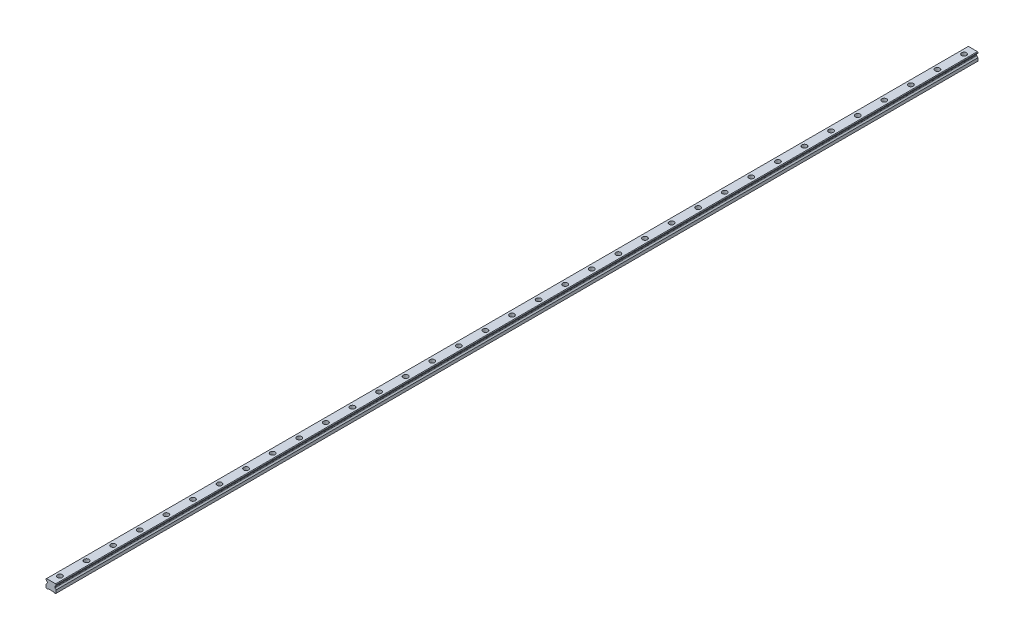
ISO-10303-21;
HEADER;
FILE_DESCRIPTION(('STEP AP214'),'2;1');
FILE_NAME('part.step','',(''),(''),'','','');
FILE_SCHEMA(('AUTOMOTIVE_DESIGN { 1 0 10303 214 1 1 1 1 }'));
ENDSEC;
DATA;
#1=APPLICATION_CONTEXT('core data for automotive mechanical design processes');
#2=APPLICATION_PROTOCOL_DEFINITION('international standard','automotive_design',2000,#1);
#3=PRODUCT_CONTEXT('',#1,'mechanical');
#4=PRODUCT('Part','Part','',(#3));
#5=PRODUCT_RELATED_PRODUCT_CATEGORY('part','',(#4));
#6=PRODUCT_DEFINITION_FORMATION('','',#4);
#7=PRODUCT_DEFINITION_CONTEXT('part definition',#1,'design');
#8=PRODUCT_DEFINITION('design','',#6,#7);
#9=PRODUCT_DEFINITION_SHAPE('','',#8);
#10=(LENGTH_UNIT() NAMED_UNIT(*) SI_UNIT(.MILLI.,.METRE.));
#11=(NAMED_UNIT(*) PLANE_ANGLE_UNIT() SI_UNIT($,.RADIAN.));
#12=(NAMED_UNIT(*) SI_UNIT($,.STERADIAN.) SOLID_ANGLE_UNIT());
#13=UNCERTAINTY_MEASURE_WITH_UNIT(LENGTH_MEASURE(1.E-05),#10,'distance_accuracy_value','');
#14=(GEOMETRIC_REPRESENTATION_CONTEXT(3) GLOBAL_UNCERTAINTY_ASSIGNED_CONTEXT((#13)) GLOBAL_UNIT_ASSIGNED_CONTEXT((#10,
#11,#12)) REPRESENTATION_CONTEXT('',''));
#15=CARTESIAN_POINT('',(0.,0.,0.));
#16=DIRECTION('',(0.,0.,1.));
#17=DIRECTION('',(1.,0.,0.));
#18=AXIS2_PLACEMENT_3D('',#15,#16,#17);
#19=CARTESIAN_POINT('',(0.,10.2,-1020.));
#20=DIRECTION('',(0.,1.,0.));
#21=DIRECTION('',(0.,0.,1.));
#22=AXIS2_PLACEMENT_3D('',#19,#20,#21);
#23=PLANE('',#22);
#24=CARTESIAN_POINT('',(0.,10.2,-1020.));
#25=DIRECTION('',(0.,1.,0.));
#26=DIRECTION('',(0.,0.,1.));
#27=AXIS2_PLACEMENT_3D('',#24,#25,#26);
#28=CIRCLE('',#27,3.49999999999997);
#29=CARTESIAN_POINT('',(0.,10.2,-1016.5));
#30=VERTEX_POINT('',#29);
#31=EDGE_CURVE('E621',#30,#30,#28,.T.);
#32=ORIENTED_EDGE('',*,*,#31,.F.);
#33=EDGE_LOOP('',(#32));
#34=FACE_BOUND('',#33,.T.);
#35=CARTESIAN_POINT('',(0.,10.2,-1020.));
#36=DIRECTION('',(0.,1.,0.));
#37=DIRECTION('',(0.,0.,1.));
#38=AXIS2_PLACEMENT_3D('',#35,#36,#37);
#39=CIRCLE('',#38,5.49999999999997);
#40=CARTESIAN_POINT('',(0.,10.2,-1014.5));
#41=VERTEX_POINT('',#40);
#42=EDGE_CURVE('E11',#41,#41,#39,.T.);
#43=ORIENTED_EDGE('',*,*,#42,.T.);
#44=EDGE_LOOP('',(#43));
#45=FACE_BOUND('',#44,.T.);
#46=ADVANCED_FACE('F39',(#34,#45),#23,.T.);
#47=CARTESIAN_POINT('',(0.,10.2,-1020.));
#48=DIRECTION('',(0.,1.,0.));
#49=DIRECTION('',(0.,0.,1.));
#50=AXIS2_PLACEMENT_3D('',#47,#48,#49);
#51=CYLINDRICAL_SURFACE('',#50,5.49999999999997);
#52=ORIENTED_EDGE('',*,*,#42,.F.);
#53=EDGE_LOOP('',(#52));
#54=FACE_BOUND('',#53,.T.);
#55=CARTESIAN_POINT('',(0.,19.2,-1020.));
#56=DIRECTION('',(0.,1.,0.));
#57=DIRECTION('',(0.,0.,1.));
#58=AXIS2_PLACEMENT_3D('',#55,#56,#57);
#59=CIRCLE('',#58,5.49999999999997);
#60=CARTESIAN_POINT('',(0.,19.2,-1014.5));
#61=VERTEX_POINT('',#60);
#62=EDGE_CURVE('E48',#61,#61,#59,.T.);
#63=ORIENTED_EDGE('',*,*,#62,.T.);
#64=EDGE_LOOP('',(#63));
#65=FACE_BOUND('',#64,.T.);
#66=ADVANCED_FACE('F1099',(#54,#65),#51,.F.);
#67=CARTESIAN_POINT('',(0.,10.2,-960.));
#68=DIRECTION('',(0.,1.,0.));
#69=DIRECTION('',(0.,0.,1.));
#70=AXIS2_PLACEMENT_3D('',#67,#68,#69);
#71=PLANE('',#70);
#72=CARTESIAN_POINT('',(0.,10.2,-960.));
#73=DIRECTION('',(0.,1.,0.));
#74=DIRECTION('',(0.,0.,1.));
#75=AXIS2_PLACEMENT_3D('',#72,#73,#74);
#76=CIRCLE('',#75,3.49999999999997);
#77=CARTESIAN_POINT('',(0.,10.2,-956.5));
#78=VERTEX_POINT('',#77);
#79=EDGE_CURVE('E626',#78,#78,#76,.T.);
#80=ORIENTED_EDGE('',*,*,#79,.F.);
#81=EDGE_LOOP('',(#80));
#82=FACE_BOUND('',#81,.T.);
#83=CARTESIAN_POINT('',(0.,10.2,-960.));
#84=DIRECTION('',(0.,1.,0.));
#85=DIRECTION('',(0.,0.,1.));
#86=AXIS2_PLACEMENT_3D('',#83,#84,#85);
#87=CIRCLE('',#86,5.49999999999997);
#88=CARTESIAN_POINT('',(0.,10.2,-954.5));
#89=VERTEX_POINT('',#88);
#90=EDGE_CURVE('E605',#89,#89,#87,.T.);
#91=ORIENTED_EDGE('',*,*,#90,.T.);
#92=EDGE_LOOP('',(#91));
#93=FACE_BOUND('',#92,.T.);
#94=ADVANCED_FACE('F1101',(#82,#93),#71,.T.);
#95=CARTESIAN_POINT('',(0.,10.2,-960.));
#96=DIRECTION('',(0.,1.,0.));
#97=DIRECTION('',(0.,0.,1.));
#98=AXIS2_PLACEMENT_3D('',#95,#96,#97);
#99=CYLINDRICAL_SURFACE('',#98,5.49999999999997);
#100=ORIENTED_EDGE('',*,*,#90,.F.);
#101=EDGE_LOOP('',(#100));
#102=FACE_BOUND('',#101,.T.);
#103=CARTESIAN_POINT('',(0.,19.2,-960.));
#104=DIRECTION('',(0.,1.,0.));
#105=DIRECTION('',(0.,0.,1.));
#106=AXIS2_PLACEMENT_3D('',#103,#104,#105);
#107=CIRCLE('',#106,5.49999999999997);
#108=CARTESIAN_POINT('',(0.,19.2,-954.5));
#109=VERTEX_POINT('',#108);
#110=EDGE_CURVE('E601',#109,#109,#107,.T.);
#111=ORIENTED_EDGE('',*,*,#110,.T.);
#112=EDGE_LOOP('',(#111));
#113=FACE_BOUND('',#112,.T.);
#114=ADVANCED_FACE('F1107',(#102,#113),#99,.F.);
#115=CARTESIAN_POINT('',(0.,10.2,-900.));
#116=DIRECTION('',(0.,1.,0.));
#117=DIRECTION('',(0.,0.,1.));
#118=AXIS2_PLACEMENT_3D('',#115,#116,#117);
#119=PLANE('',#118);
#120=CARTESIAN_POINT('',(0.,10.2,-900.));
#121=DIRECTION('',(0.,1.,0.));
#122=DIRECTION('',(0.,0.,1.));
#123=AXIS2_PLACEMENT_3D('',#120,#121,#122);
#124=CIRCLE('',#123,3.49999999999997);
#125=CARTESIAN_POINT('',(0.,10.2,-896.5));
#126=VERTEX_POINT('',#125);
#127=EDGE_CURVE('E631',#126,#126,#124,.T.);
#128=ORIENTED_EDGE('',*,*,#127,.F.);
#129=EDGE_LOOP('',(#128));
#130=FACE_BOUND('',#129,.T.);
#131=CARTESIAN_POINT('',(0.,10.2,-900.));
#132=DIRECTION('',(0.,1.,0.));
#133=DIRECTION('',(0.,0.,1.));
#134=AXIS2_PLACEMENT_3D('',#131,#132,#133);
#135=CIRCLE('',#134,5.49999999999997);
#136=CARTESIAN_POINT('',(0.,10.2,-894.5));
#137=VERTEX_POINT('',#136);
#138=EDGE_CURVE('E597',#137,#137,#135,.T.);
#139=ORIENTED_EDGE('',*,*,#138,.T.);
#140=EDGE_LOOP('',(#139));
#141=FACE_BOUND('',#140,.T.);
#142=ADVANCED_FACE('F1115',(#130,#141),#119,.T.);
#143=CARTESIAN_POINT('',(0.,10.2,-900.));
#144=DIRECTION('',(0.,1.,0.));
#145=DIRECTION('',(0.,0.,1.));
#146=AXIS2_PLACEMENT_3D('',#143,#144,#145);
#147=CYLINDRICAL_SURFACE('',#146,5.49999999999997);
#148=ORIENTED_EDGE('',*,*,#138,.F.);
#149=EDGE_LOOP('',(#148));
#150=FACE_BOUND('',#149,.T.);
#151=CARTESIAN_POINT('',(0.,19.2,-900.));
#152=DIRECTION('',(0.,1.,0.));
#153=DIRECTION('',(0.,0.,1.));
#154=AXIS2_PLACEMENT_3D('',#151,#152,#153);
#155=CIRCLE('',#154,5.49999999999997);
#156=CARTESIAN_POINT('',(0.,19.2,-894.5));
#157=VERTEX_POINT('',#156);
#158=EDGE_CURVE('E593',#157,#157,#155,.T.);
#159=ORIENTED_EDGE('',*,*,#158,.T.);
#160=EDGE_LOOP('',(#159));
#161=FACE_BOUND('',#160,.T.);
#162=ADVANCED_FACE('F1119',(#150,#161),#147,.F.);
#163=CARTESIAN_POINT('',(0.,10.2,-840.));
#164=DIRECTION('',(0.,1.,0.));
#165=DIRECTION('',(0.,0.,1.));
#166=AXIS2_PLACEMENT_3D('',#163,#164,#165);
#167=PLANE('',#166);
#168=CARTESIAN_POINT('',(0.,10.2,-840.));
#169=DIRECTION('',(0.,1.,0.));
#170=DIRECTION('',(0.,0.,1.));
#171=AXIS2_PLACEMENT_3D('',#168,#169,#170);
#172=CIRCLE('',#171,3.49999999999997);
#173=CARTESIAN_POINT('',(0.,10.2,-836.5));
#174=VERTEX_POINT('',#173);
#175=EDGE_CURVE('E636',#174,#174,#172,.T.);
#176=ORIENTED_EDGE('',*,*,#175,.F.);
#177=EDGE_LOOP('',(#176));
#178=FACE_BOUND('',#177,.T.);
#179=CARTESIAN_POINT('',(0.,10.2,-840.));
#180=DIRECTION('',(0.,1.,0.));
#181=DIRECTION('',(0.,0.,1.));
#182=AXIS2_PLACEMENT_3D('',#179,#180,#181);
#183=CIRCLE('',#182,5.49999999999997);
#184=CARTESIAN_POINT('',(0.,10.2,-834.5));
#185=VERTEX_POINT('',#184);
#186=EDGE_CURVE('E589',#185,#185,#183,.T.);
#187=ORIENTED_EDGE('',*,*,#186,.T.);
#188=EDGE_LOOP('',(#187));
#189=FACE_BOUND('',#188,.T.);
#190=ADVANCED_FACE('F1123',(#178,#189),#167,.T.);
#191=CARTESIAN_POINT('',(0.,10.2,-840.));
#192=DIRECTION('',(0.,1.,0.));
#193=DIRECTION('',(0.,0.,1.));
#194=AXIS2_PLACEMENT_3D('',#191,#192,#193);
#195=CYLINDRICAL_SURFACE('',#194,5.49999999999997);
#196=ORIENTED_EDGE('',*,*,#186,.F.);
#197=EDGE_LOOP('',(#196));
#198=FACE_BOUND('',#197,.T.);
#199=CARTESIAN_POINT('',(0.,19.2,-840.));
#200=DIRECTION('',(0.,1.,0.));
#201=DIRECTION('',(0.,0.,1.));
#202=AXIS2_PLACEMENT_3D('',#199,#200,#201);
#203=CIRCLE('',#202,5.49999999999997);
#204=CARTESIAN_POINT('',(0.,19.2,-834.5));
#205=VERTEX_POINT('',#204);
#206=EDGE_CURVE('E585',#205,#205,#203,.T.);
#207=ORIENTED_EDGE('',*,*,#206,.T.);
#208=EDGE_LOOP('',(#207));
#209=FACE_BOUND('',#208,.T.);
#210=ADVANCED_FACE('F1127',(#198,#209),#195,.F.);
#211=CARTESIAN_POINT('',(0.,10.2,-780.));
#212=DIRECTION('',(0.,1.,0.));
#213=DIRECTION('',(0.,0.,1.));
#214=AXIS2_PLACEMENT_3D('',#211,#212,#213);
#215=PLANE('',#214);
#216=CARTESIAN_POINT('',(0.,10.2,-780.));
#217=DIRECTION('',(0.,1.,0.));
#218=DIRECTION('',(0.,0.,1.));
#219=AXIS2_PLACEMENT_3D('',#216,#217,#218);
#220=CIRCLE('',#219,3.49999999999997);
#221=CARTESIAN_POINT('',(0.,10.2,-776.5));
#222=VERTEX_POINT('',#221);
#223=EDGE_CURVE('E641',#222,#222,#220,.T.);
#224=ORIENTED_EDGE('',*,*,#223,.F.);
#225=EDGE_LOOP('',(#224));
#226=FACE_BOUND('',#225,.T.);
#227=CARTESIAN_POINT('',(0.,10.2,-780.));
#228=DIRECTION('',(0.,1.,0.));
#229=DIRECTION('',(0.,0.,1.));
#230=AXIS2_PLACEMENT_3D('',#227,#228,#229);
#231=CIRCLE('',#230,5.49999999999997);
#232=CARTESIAN_POINT('',(0.,10.2,-774.5));
#233=VERTEX_POINT('',#232);
#234=EDGE_CURVE('E581',#233,#233,#231,.T.);
#235=ORIENTED_EDGE('',*,*,#234,.T.);
#236=EDGE_LOOP('',(#235));
#237=FACE_BOUND('',#236,.T.);
#238=ADVANCED_FACE('F1131',(#226,#237),#215,.T.);
#239=CARTESIAN_POINT('',(0.,10.2,-780.));
#240=DIRECTION('',(0.,1.,0.));
#241=DIRECTION('',(0.,0.,1.));
#242=AXIS2_PLACEMENT_3D('',#239,#240,#241);
#243=CYLINDRICAL_SURFACE('',#242,5.49999999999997);
#244=ORIENTED_EDGE('',*,*,#234,.F.);
#245=EDGE_LOOP('',(#244));
#246=FACE_BOUND('',#245,.T.);
#247=CARTESIAN_POINT('',(0.,19.2,-780.));
#248=DIRECTION('',(0.,1.,0.));
#249=DIRECTION('',(0.,0.,1.));
#250=AXIS2_PLACEMENT_3D('',#247,#248,#249);
#251=CIRCLE('',#250,5.49999999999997);
#252=CARTESIAN_POINT('',(0.,19.2,-774.5));
#253=VERTEX_POINT('',#252);
#254=EDGE_CURVE('E577',#253,#253,#251,.T.);
#255=ORIENTED_EDGE('',*,*,#254,.T.);
#256=EDGE_LOOP('',(#255));
#257=FACE_BOUND('',#256,.T.);
#258=ADVANCED_FACE('F1135',(#246,#257),#243,.F.);
#259=CARTESIAN_POINT('',(0.,10.2,-720.));
#260=DIRECTION('',(0.,1.,0.));
#261=DIRECTION('',(0.,0.,1.));
#262=AXIS2_PLACEMENT_3D('',#259,#260,#261);
#263=PLANE('',#262);
#264=CARTESIAN_POINT('',(0.,10.2,-720.));
#265=DIRECTION('',(0.,1.,0.));
#266=DIRECTION('',(0.,0.,1.));
#267=AXIS2_PLACEMENT_3D('',#264,#265,#266);
#268=CIRCLE('',#267,3.49999999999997);
#269=CARTESIAN_POINT('',(0.,10.2,-716.5));
#270=VERTEX_POINT('',#269);
#271=EDGE_CURVE('E646',#270,#270,#268,.T.);
#272=ORIENTED_EDGE('',*,*,#271,.F.);
#273=EDGE_LOOP('',(#272));
#274=FACE_BOUND('',#273,.T.);
#275=CARTESIAN_POINT('',(0.,10.2,-720.));
#276=DIRECTION('',(0.,1.,0.));
#277=DIRECTION('',(0.,0.,1.));
#278=AXIS2_PLACEMENT_3D('',#275,#276,#277);
#279=CIRCLE('',#278,5.49999999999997);
#280=CARTESIAN_POINT('',(0.,10.2,-714.5));
#281=VERTEX_POINT('',#280);
#282=EDGE_CURVE('E573',#281,#281,#279,.T.);
#283=ORIENTED_EDGE('',*,*,#282,.T.);
#284=EDGE_LOOP('',(#283));
#285=FACE_BOUND('',#284,.T.);
#286=ADVANCED_FACE('F1139',(#274,#285),#263,.T.);
#287=CARTESIAN_POINT('',(0.,10.2,-720.));
#288=DIRECTION('',(0.,1.,0.));
#289=DIRECTION('',(0.,0.,1.));
#290=AXIS2_PLACEMENT_3D('',#287,#288,#289);
#291=CYLINDRICAL_SURFACE('',#290,5.49999999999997);
#292=ORIENTED_EDGE('',*,*,#282,.F.);
#293=EDGE_LOOP('',(#292));
#294=FACE_BOUND('',#293,.T.);
#295=CARTESIAN_POINT('',(0.,19.2,-720.));
#296=DIRECTION('',(0.,1.,0.));
#297=DIRECTION('',(0.,0.,1.));
#298=AXIS2_PLACEMENT_3D('',#295,#296,#297);
#299=CIRCLE('',#298,5.49999999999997);
#300=CARTESIAN_POINT('',(0.,19.2,-714.5));
#301=VERTEX_POINT('',#300);
#302=EDGE_CURVE('E569',#301,#301,#299,.T.);
#303=ORIENTED_EDGE('',*,*,#302,.T.);
#304=EDGE_LOOP('',(#303));
#305=FACE_BOUND('',#304,.T.);
#306=ADVANCED_FACE('F1143',(#294,#305),#291,.F.);
#307=CARTESIAN_POINT('',(0.,10.2,-660.));
#308=DIRECTION('',(0.,1.,0.));
#309=DIRECTION('',(0.,0.,1.));
#310=AXIS2_PLACEMENT_3D('',#307,#308,#309);
#311=PLANE('',#310);
#312=CARTESIAN_POINT('',(0.,10.2,-660.));
#313=DIRECTION('',(0.,1.,0.));
#314=DIRECTION('',(0.,0.,1.));
#315=AXIS2_PLACEMENT_3D('',#312,#313,#314);
#316=CIRCLE('',#315,3.49999999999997);
#317=CARTESIAN_POINT('',(0.,10.2,-656.5));
#318=VERTEX_POINT('',#317);
#319=EDGE_CURVE('E651',#318,#318,#316,.T.);
#320=ORIENTED_EDGE('',*,*,#319,.F.);
#321=EDGE_LOOP('',(#320));
#322=FACE_BOUND('',#321,.T.);
#323=CARTESIAN_POINT('',(0.,10.2,-660.));
#324=DIRECTION('',(0.,1.,0.));
#325=DIRECTION('',(0.,0.,1.));
#326=AXIS2_PLACEMENT_3D('',#323,#324,#325);
#327=CIRCLE('',#326,5.49999999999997);
#328=CARTESIAN_POINT('',(0.,10.2,-654.5));
#329=VERTEX_POINT('',#328);
#330=EDGE_CURVE('E565',#329,#329,#327,.T.);
#331=ORIENTED_EDGE('',*,*,#330,.T.);
#332=EDGE_LOOP('',(#331));
#333=FACE_BOUND('',#332,.T.);
#334=ADVANCED_FACE('F1147',(#322,#333),#311,.T.);
#335=CARTESIAN_POINT('',(0.,10.2,-660.));
#336=DIRECTION('',(0.,1.,0.));
#337=DIRECTION('',(0.,0.,1.));
#338=AXIS2_PLACEMENT_3D('',#335,#336,#337);
#339=CYLINDRICAL_SURFACE('',#338,5.49999999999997);
#340=ORIENTED_EDGE('',*,*,#330,.F.);
#341=EDGE_LOOP('',(#340));
#342=FACE_BOUND('',#341,.T.);
#343=CARTESIAN_POINT('',(0.,19.2,-660.));
#344=DIRECTION('',(0.,1.,0.));
#345=DIRECTION('',(0.,0.,1.));
#346=AXIS2_PLACEMENT_3D('',#343,#344,#345);
#347=CIRCLE('',#346,5.49999999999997);
#348=CARTESIAN_POINT('',(0.,19.2,-654.5));
#349=VERTEX_POINT('',#348);
#350=EDGE_CURVE('E561',#349,#349,#347,.T.);
#351=ORIENTED_EDGE('',*,*,#350,.T.);
#352=EDGE_LOOP('',(#351));
#353=FACE_BOUND('',#352,.T.);
#354=ADVANCED_FACE('F1151',(#342,#353),#339,.F.);
#355=CARTESIAN_POINT('',(0.,10.2,-600.));
#356=DIRECTION('',(0.,1.,0.));
#357=DIRECTION('',(0.,0.,1.));
#358=AXIS2_PLACEMENT_3D('',#355,#356,#357);
#359=PLANE('',#358);
#360=CARTESIAN_POINT('',(0.,10.2,-600.));
#361=DIRECTION('',(0.,1.,0.));
#362=DIRECTION('',(0.,0.,1.));
#363=AXIS2_PLACEMENT_3D('',#360,#361,#362);
#364=CIRCLE('',#363,3.49999999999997);
#365=CARTESIAN_POINT('',(0.,10.2,-596.5));
#366=VERTEX_POINT('',#365);
#367=EDGE_CURVE('E656',#366,#366,#364,.T.);
#368=ORIENTED_EDGE('',*,*,#367,.F.);
#369=EDGE_LOOP('',(#368));
#370=FACE_BOUND('',#369,.T.);
#371=CARTESIAN_POINT('',(0.,10.2,-600.));
#372=DIRECTION('',(0.,1.,0.));
#373=DIRECTION('',(0.,0.,1.));
#374=AXIS2_PLACEMENT_3D('',#371,#372,#373);
#375=CIRCLE('',#374,5.49999999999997);
#376=CARTESIAN_POINT('',(0.,10.2,-594.5));
#377=VERTEX_POINT('',#376);
#378=EDGE_CURVE('E557',#377,#377,#375,.T.);
#379=ORIENTED_EDGE('',*,*,#378,.T.);
#380=EDGE_LOOP('',(#379));
#381=FACE_BOUND('',#380,.T.);
#382=ADVANCED_FACE('F1155',(#370,#381),#359,.T.);
#383=CARTESIAN_POINT('',(0.,10.2,-600.));
#384=DIRECTION('',(0.,1.,0.));
#385=DIRECTION('',(0.,0.,1.));
#386=AXIS2_PLACEMENT_3D('',#383,#384,#385);
#387=CYLINDRICAL_SURFACE('',#386,5.49999999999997);
#388=ORIENTED_EDGE('',*,*,#378,.F.);
#389=EDGE_LOOP('',(#388));
#390=FACE_BOUND('',#389,.T.);
#391=CARTESIAN_POINT('',(0.,19.2,-600.));
#392=DIRECTION('',(0.,1.,0.));
#393=DIRECTION('',(0.,0.,1.));
#394=AXIS2_PLACEMENT_3D('',#391,#392,#393);
#395=CIRCLE('',#394,5.49999999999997);
#396=CARTESIAN_POINT('',(0.,19.2,-594.5));
#397=VERTEX_POINT('',#396);
#398=EDGE_CURVE('E553',#397,#397,#395,.T.);
#399=ORIENTED_EDGE('',*,*,#398,.T.);
#400=EDGE_LOOP('',(#399));
#401=FACE_BOUND('',#400,.T.);
#402=ADVANCED_FACE('F1159',(#390,#401),#387,.F.);
#403=CARTESIAN_POINT('',(0.,10.2,-540.));
#404=DIRECTION('',(0.,1.,0.));
#405=DIRECTION('',(0.,0.,1.));
#406=AXIS2_PLACEMENT_3D('',#403,#404,#405);
#407=PLANE('',#406);
#408=CARTESIAN_POINT('',(0.,10.2,-540.));
#409=DIRECTION('',(0.,1.,0.));
#410=DIRECTION('',(0.,0.,1.));
#411=AXIS2_PLACEMENT_3D('',#408,#409,#410);
#412=CIRCLE('',#411,3.49999999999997);
#413=CARTESIAN_POINT('',(0.,10.2,-536.5));
#414=VERTEX_POINT('',#413);
#415=EDGE_CURVE('E661',#414,#414,#412,.T.);
#416=ORIENTED_EDGE('',*,*,#415,.F.);
#417=EDGE_LOOP('',(#416));
#418=FACE_BOUND('',#417,.T.);
#419=CARTESIAN_POINT('',(0.,10.2,-540.));
#420=DIRECTION('',(0.,1.,0.));
#421=DIRECTION('',(0.,0.,1.));
#422=AXIS2_PLACEMENT_3D('',#419,#420,#421);
#423=CIRCLE('',#422,5.49999999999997);
#424=CARTESIAN_POINT('',(0.,10.2,-534.5));
#425=VERTEX_POINT('',#424);
#426=EDGE_CURVE('E549',#425,#425,#423,.T.);
#427=ORIENTED_EDGE('',*,*,#426,.T.);
#428=EDGE_LOOP('',(#427));
#429=FACE_BOUND('',#428,.T.);
#430=ADVANCED_FACE('F1163',(#418,#429),#407,.T.);
#431=CARTESIAN_POINT('',(0.,10.2,-540.));
#432=DIRECTION('',(0.,1.,0.));
#433=DIRECTION('',(0.,0.,1.));
#434=AXIS2_PLACEMENT_3D('',#431,#432,#433);
#435=CYLINDRICAL_SURFACE('',#434,5.49999999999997);
#436=ORIENTED_EDGE('',*,*,#426,.F.);
#437=EDGE_LOOP('',(#436));
#438=FACE_BOUND('',#437,.T.);
#439=CARTESIAN_POINT('',(0.,19.2,-540.));
#440=DIRECTION('',(0.,1.,0.));
#441=DIRECTION('',(0.,0.,1.));
#442=AXIS2_PLACEMENT_3D('',#439,#440,#441);
#443=CIRCLE('',#442,5.49999999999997);
#444=CARTESIAN_POINT('',(0.,19.2,-534.5));
#445=VERTEX_POINT('',#444);
#446=EDGE_CURVE('E545',#445,#445,#443,.T.);
#447=ORIENTED_EDGE('',*,*,#446,.T.);
#448=EDGE_LOOP('',(#447));
#449=FACE_BOUND('',#448,.T.);
#450=ADVANCED_FACE('F1167',(#438,#449),#435,.F.);
#451=CARTESIAN_POINT('',(0.,10.2,-480.));
#452=DIRECTION('',(0.,1.,0.));
#453=DIRECTION('',(0.,0.,1.));
#454=AXIS2_PLACEMENT_3D('',#451,#452,#453);
#455=PLANE('',#454);
#456=CARTESIAN_POINT('',(0.,10.2,-480.));
#457=DIRECTION('',(0.,1.,0.));
#458=DIRECTION('',(0.,0.,1.));
#459=AXIS2_PLACEMENT_3D('',#456,#457,#458);
#460=CIRCLE('',#459,3.49999999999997);
#461=CARTESIAN_POINT('',(0.,10.2,-476.5));
#462=VERTEX_POINT('',#461);
#463=EDGE_CURVE('E666',#462,#462,#460,.T.);
#464=ORIENTED_EDGE('',*,*,#463,.F.);
#465=EDGE_LOOP('',(#464));
#466=FACE_BOUND('',#465,.T.);
#467=CARTESIAN_POINT('',(0.,10.2,-480.));
#468=DIRECTION('',(0.,1.,0.));
#469=DIRECTION('',(0.,0.,1.));
#470=AXIS2_PLACEMENT_3D('',#467,#468,#469);
#471=CIRCLE('',#470,5.49999999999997);
#472=CARTESIAN_POINT('',(0.,10.2,-474.5));
#473=VERTEX_POINT('',#472);
#474=EDGE_CURVE('E541',#473,#473,#471,.T.);
#475=ORIENTED_EDGE('',*,*,#474,.T.);
#476=EDGE_LOOP('',(#475));
#477=FACE_BOUND('',#476,.T.);
#478=ADVANCED_FACE('F1171',(#466,#477),#455,.T.);
#479=CARTESIAN_POINT('',(0.,10.2,-480.));
#480=DIRECTION('',(0.,1.,0.));
#481=DIRECTION('',(0.,0.,1.));
#482=AXIS2_PLACEMENT_3D('',#479,#480,#481);
#483=CYLINDRICAL_SURFACE('',#482,5.49999999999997);
#484=ORIENTED_EDGE('',*,*,#474,.F.);
#485=EDGE_LOOP('',(#484));
#486=FACE_BOUND('',#485,.T.);
#487=CARTESIAN_POINT('',(0.,19.2,-480.));
#488=DIRECTION('',(0.,1.,0.));
#489=DIRECTION('',(0.,0.,1.));
#490=AXIS2_PLACEMENT_3D('',#487,#488,#489);
#491=CIRCLE('',#490,5.49999999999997);
#492=CARTESIAN_POINT('',(0.,19.2,-474.5));
#493=VERTEX_POINT('',#492);
#494=EDGE_CURVE('E537',#493,#493,#491,.T.);
#495=ORIENTED_EDGE('',*,*,#494,.T.);
#496=EDGE_LOOP('',(#495));
#497=FACE_BOUND('',#496,.T.);
#498=ADVANCED_FACE('F1175',(#486,#497),#483,.F.);
#499=CARTESIAN_POINT('',(0.,10.2,-420.));
#500=DIRECTION('',(0.,1.,0.));
#501=DIRECTION('',(0.,0.,1.));
#502=AXIS2_PLACEMENT_3D('',#499,#500,#501);
#503=PLANE('',#502);
#504=CARTESIAN_POINT('',(0.,10.2,-420.));
#505=DIRECTION('',(0.,1.,0.));
#506=DIRECTION('',(0.,0.,1.));
#507=AXIS2_PLACEMENT_3D('',#504,#505,#506);
#508=CIRCLE('',#507,3.49999999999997);
#509=CARTESIAN_POINT('',(0.,10.2,-416.5));
#510=VERTEX_POINT('',#509);
#511=EDGE_CURVE('E671',#510,#510,#508,.T.);
#512=ORIENTED_EDGE('',*,*,#511,.F.);
#513=EDGE_LOOP('',(#512));
#514=FACE_BOUND('',#513,.T.);
#515=CARTESIAN_POINT('',(0.,10.2,-420.));
#516=DIRECTION('',(0.,1.,0.));
#517=DIRECTION('',(0.,0.,1.));
#518=AXIS2_PLACEMENT_3D('',#515,#516,#517);
#519=CIRCLE('',#518,5.49999999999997);
#520=CARTESIAN_POINT('',(0.,10.2,-414.5));
#521=VERTEX_POINT('',#520);
#522=EDGE_CURVE('E533',#521,#521,#519,.T.);
#523=ORIENTED_EDGE('',*,*,#522,.T.);
#524=EDGE_LOOP('',(#523));
#525=FACE_BOUND('',#524,.T.);
#526=ADVANCED_FACE('F1179',(#514,#525),#503,.T.);
#527=CARTESIAN_POINT('',(0.,10.2,-420.));
#528=DIRECTION('',(0.,1.,0.));
#529=DIRECTION('',(0.,0.,1.));
#530=AXIS2_PLACEMENT_3D('',#527,#528,#529);
#531=CYLINDRICAL_SURFACE('',#530,5.49999999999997);
#532=ORIENTED_EDGE('',*,*,#522,.F.);
#533=EDGE_LOOP('',(#532));
#534=FACE_BOUND('',#533,.T.);
#535=CARTESIAN_POINT('',(0.,19.2,-420.));
#536=DIRECTION('',(0.,1.,0.));
#537=DIRECTION('',(0.,0.,1.));
#538=AXIS2_PLACEMENT_3D('',#535,#536,#537);
#539=CIRCLE('',#538,5.49999999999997);
#540=CARTESIAN_POINT('',(0.,19.2,-414.5));
#541=VERTEX_POINT('',#540);
#542=EDGE_CURVE('E529',#541,#541,#539,.T.);
#543=ORIENTED_EDGE('',*,*,#542,.T.);
#544=EDGE_LOOP('',(#543));
#545=FACE_BOUND('',#544,.T.);
#546=ADVANCED_FACE('F1183',(#534,#545),#531,.F.);
#547=CARTESIAN_POINT('',(0.,10.2,-360.));
#548=DIRECTION('',(0.,1.,0.));
#549=DIRECTION('',(0.,0.,1.));
#550=AXIS2_PLACEMENT_3D('',#547,#548,#549);
#551=PLANE('',#550);
#552=CARTESIAN_POINT('',(0.,10.2,-360.));
#553=DIRECTION('',(0.,1.,0.));
#554=DIRECTION('',(0.,0.,1.));
#555=AXIS2_PLACEMENT_3D('',#552,#553,#554);
#556=CIRCLE('',#555,3.49999999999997);
#557=CARTESIAN_POINT('',(0.,10.2,-356.5));
#558=VERTEX_POINT('',#557);
#559=EDGE_CURVE('E676',#558,#558,#556,.T.);
#560=ORIENTED_EDGE('',*,*,#559,.F.);
#561=EDGE_LOOP('',(#560));
#562=FACE_BOUND('',#561,.T.);
#563=CARTESIAN_POINT('',(0.,10.2,-360.));
#564=DIRECTION('',(0.,1.,0.));
#565=DIRECTION('',(0.,0.,1.));
#566=AXIS2_PLACEMENT_3D('',#563,#564,#565);
#567=CIRCLE('',#566,5.49999999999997);
#568=CARTESIAN_POINT('',(0.,10.2,-354.5));
#569=VERTEX_POINT('',#568);
#570=EDGE_CURVE('E525',#569,#569,#567,.T.);
#571=ORIENTED_EDGE('',*,*,#570,.T.);
#572=EDGE_LOOP('',(#571));
#573=FACE_BOUND('',#572,.T.);
#574=ADVANCED_FACE('F1187',(#562,#573),#551,.T.);
#575=CARTESIAN_POINT('',(0.,10.2,-360.));
#576=DIRECTION('',(0.,1.,0.));
#577=DIRECTION('',(0.,0.,1.));
#578=AXIS2_PLACEMENT_3D('',#575,#576,#577);
#579=CYLINDRICAL_SURFACE('',#578,5.49999999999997);
#580=ORIENTED_EDGE('',*,*,#570,.F.);
#581=EDGE_LOOP('',(#580));
#582=FACE_BOUND('',#581,.T.);
#583=CARTESIAN_POINT('',(0.,19.2,-360.));
#584=DIRECTION('',(0.,1.,0.));
#585=DIRECTION('',(0.,0.,1.));
#586=AXIS2_PLACEMENT_3D('',#583,#584,#585);
#587=CIRCLE('',#586,5.49999999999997);
#588=CARTESIAN_POINT('',(0.,19.2,-354.5));
#589=VERTEX_POINT('',#588);
#590=EDGE_CURVE('E521',#589,#589,#587,.T.);
#591=ORIENTED_EDGE('',*,*,#590,.T.);
#592=EDGE_LOOP('',(#591));
#593=FACE_BOUND('',#592,.T.);
#594=ADVANCED_FACE('F1191',(#582,#593),#579,.F.);
#595=CARTESIAN_POINT('',(0.,10.2,-300.));
#596=DIRECTION('',(0.,1.,0.));
#597=DIRECTION('',(0.,0.,1.));
#598=AXIS2_PLACEMENT_3D('',#595,#596,#597);
#599=PLANE('',#598);
#600=CARTESIAN_POINT('',(0.,10.2,-300.));
#601=DIRECTION('',(0.,1.,0.));
#602=DIRECTION('',(0.,0.,1.));
#603=AXIS2_PLACEMENT_3D('',#600,#601,#602);
#604=CIRCLE('',#603,3.49999999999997);
#605=CARTESIAN_POINT('',(0.,10.2,-296.5));
#606=VERTEX_POINT('',#605);
#607=EDGE_CURVE('E681',#606,#606,#604,.T.);
#608=ORIENTED_EDGE('',*,*,#607,.F.);
#609=EDGE_LOOP('',(#608));
#610=FACE_BOUND('',#609,.T.);
#611=CARTESIAN_POINT('',(0.,10.2,-300.));
#612=DIRECTION('',(0.,1.,0.));
#613=DIRECTION('',(0.,0.,1.));
#614=AXIS2_PLACEMENT_3D('',#611,#612,#613);
#615=CIRCLE('',#614,5.49999999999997);
#616=CARTESIAN_POINT('',(0.,10.2,-294.5));
#617=VERTEX_POINT('',#616);
#618=EDGE_CURVE('E517',#617,#617,#615,.T.);
#619=ORIENTED_EDGE('',*,*,#618,.T.);
#620=EDGE_LOOP('',(#619));
#621=FACE_BOUND('',#620,.T.);
#622=ADVANCED_FACE('F1195',(#610,#621),#599,.T.);
#623=CARTESIAN_POINT('',(0.,10.2,-300.));
#624=DIRECTION('',(0.,1.,0.));
#625=DIRECTION('',(0.,0.,1.));
#626=AXIS2_PLACEMENT_3D('',#623,#624,#625);
#627=CYLINDRICAL_SURFACE('',#626,5.49999999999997);
#628=ORIENTED_EDGE('',*,*,#618,.F.);
#629=EDGE_LOOP('',(#628));
#630=FACE_BOUND('',#629,.T.);
#631=CARTESIAN_POINT('',(0.,19.2,-300.));
#632=DIRECTION('',(0.,1.,0.));
#633=DIRECTION('',(0.,0.,1.));
#634=AXIS2_PLACEMENT_3D('',#631,#632,#633);
#635=CIRCLE('',#634,5.49999999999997);
#636=CARTESIAN_POINT('',(0.,19.2,-294.5));
#637=VERTEX_POINT('',#636);
#638=EDGE_CURVE('E513',#637,#637,#635,.T.);
#639=ORIENTED_EDGE('',*,*,#638,.T.);
#640=EDGE_LOOP('',(#639));
#641=FACE_BOUND('',#640,.T.);
#642=ADVANCED_FACE('F1199',(#630,#641),#627,.F.);
#643=CARTESIAN_POINT('',(0.,10.2,-240.));
#644=DIRECTION('',(0.,1.,0.));
#645=DIRECTION('',(0.,0.,1.));
#646=AXIS2_PLACEMENT_3D('',#643,#644,#645);
#647=PLANE('',#646);
#648=CARTESIAN_POINT('',(0.,10.2,-240.));
#649=DIRECTION('',(0.,1.,0.));
#650=DIRECTION('',(0.,0.,1.));
#651=AXIS2_PLACEMENT_3D('',#648,#649,#650);
#652=CIRCLE('',#651,3.49999999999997);
#653=CARTESIAN_POINT('',(0.,10.2,-236.5));
#654=VERTEX_POINT('',#653);
#655=EDGE_CURVE('E686',#654,#654,#652,.T.);
#656=ORIENTED_EDGE('',*,*,#655,.F.);
#657=EDGE_LOOP('',(#656));
#658=FACE_BOUND('',#657,.T.);
#659=CARTESIAN_POINT('',(0.,10.2,-240.));
#660=DIRECTION('',(0.,1.,0.));
#661=DIRECTION('',(0.,0.,1.));
#662=AXIS2_PLACEMENT_3D('',#659,#660,#661);
#663=CIRCLE('',#662,5.49999999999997);
#664=CARTESIAN_POINT('',(0.,10.2,-234.5));
#665=VERTEX_POINT('',#664);
#666=EDGE_CURVE('E509',#665,#665,#663,.T.);
#667=ORIENTED_EDGE('',*,*,#666,.T.);
#668=EDGE_LOOP('',(#667));
#669=FACE_BOUND('',#668,.T.);
#670=ADVANCED_FACE('F1203',(#658,#669),#647,.T.);
#671=CARTESIAN_POINT('',(0.,10.2,-240.));
#672=DIRECTION('',(0.,1.,0.));
#673=DIRECTION('',(0.,0.,1.));
#674=AXIS2_PLACEMENT_3D('',#671,#672,#673);
#675=CYLINDRICAL_SURFACE('',#674,5.49999999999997);
#676=ORIENTED_EDGE('',*,*,#666,.F.);
#677=EDGE_LOOP('',(#676));
#678=FACE_BOUND('',#677,.T.);
#679=CARTESIAN_POINT('',(0.,19.2,-240.));
#680=DIRECTION('',(0.,1.,0.));
#681=DIRECTION('',(0.,0.,1.));
#682=AXIS2_PLACEMENT_3D('',#679,#680,#681);
#683=CIRCLE('',#682,5.49999999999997);
#684=CARTESIAN_POINT('',(0.,19.2,-234.5));
#685=VERTEX_POINT('',#684);
#686=EDGE_CURVE('E505',#685,#685,#683,.T.);
#687=ORIENTED_EDGE('',*,*,#686,.T.);
#688=EDGE_LOOP('',(#687));
#689=FACE_BOUND('',#688,.T.);
#690=ADVANCED_FACE('F1207',(#678,#689),#675,.F.);
#691=CARTESIAN_POINT('',(0.,10.2,-180.));
#692=DIRECTION('',(0.,1.,0.));
#693=DIRECTION('',(0.,0.,1.));
#694=AXIS2_PLACEMENT_3D('',#691,#692,#693);
#695=PLANE('',#694);
#696=CARTESIAN_POINT('',(0.,10.2,-180.));
#697=DIRECTION('',(0.,1.,0.));
#698=DIRECTION('',(0.,0.,1.));
#699=AXIS2_PLACEMENT_3D('',#696,#697,#698);
#700=CIRCLE('',#699,3.49999999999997);
#701=CARTESIAN_POINT('',(0.,10.2,-176.5));
#702=VERTEX_POINT('',#701);
#703=EDGE_CURVE('E691',#702,#702,#700,.T.);
#704=ORIENTED_EDGE('',*,*,#703,.F.);
#705=EDGE_LOOP('',(#704));
#706=FACE_BOUND('',#705,.T.);
#707=CARTESIAN_POINT('',(0.,10.2,-180.));
#708=DIRECTION('',(0.,1.,0.));
#709=DIRECTION('',(0.,0.,1.));
#710=AXIS2_PLACEMENT_3D('',#707,#708,#709);
#711=CIRCLE('',#710,5.49999999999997);
#712=CARTESIAN_POINT('',(0.,10.2,-174.5));
#713=VERTEX_POINT('',#712);
#714=EDGE_CURVE('E501',#713,#713,#711,.T.);
#715=ORIENTED_EDGE('',*,*,#714,.T.);
#716=EDGE_LOOP('',(#715));
#717=FACE_BOUND('',#716,.T.);
#718=ADVANCED_FACE('F1211',(#706,#717),#695,.T.);
#719=CARTESIAN_POINT('',(0.,10.2,-180.));
#720=DIRECTION('',(0.,1.,0.));
#721=DIRECTION('',(0.,0.,1.));
#722=AXIS2_PLACEMENT_3D('',#719,#720,#721);
#723=CYLINDRICAL_SURFACE('',#722,5.49999999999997);
#724=ORIENTED_EDGE('',*,*,#714,.F.);
#725=EDGE_LOOP('',(#724));
#726=FACE_BOUND('',#725,.T.);
#727=CARTESIAN_POINT('',(0.,19.2,-180.));
#728=DIRECTION('',(0.,1.,0.));
#729=DIRECTION('',(0.,0.,1.));
#730=AXIS2_PLACEMENT_3D('',#727,#728,#729);
#731=CIRCLE('',#730,5.49999999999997);
#732=CARTESIAN_POINT('',(0.,19.2,-174.5));
#733=VERTEX_POINT('',#732);
#734=EDGE_CURVE('E497',#733,#733,#731,.T.);
#735=ORIENTED_EDGE('',*,*,#734,.T.);
#736=EDGE_LOOP('',(#735));
#737=FACE_BOUND('',#736,.T.);
#738=ADVANCED_FACE('F1215',(#726,#737),#723,.F.);
#739=CARTESIAN_POINT('',(0.,10.2,-120.));
#740=DIRECTION('',(0.,1.,0.));
#741=DIRECTION('',(0.,0.,1.));
#742=AXIS2_PLACEMENT_3D('',#739,#740,#741);
#743=PLANE('',#742);
#744=CARTESIAN_POINT('',(0.,10.2,-120.));
#745=DIRECTION('',(0.,1.,0.));
#746=DIRECTION('',(0.,0.,1.));
#747=AXIS2_PLACEMENT_3D('',#744,#745,#746);
#748=CIRCLE('',#747,3.49999999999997);
#749=CARTESIAN_POINT('',(0.,10.2,-116.5));
#750=VERTEX_POINT('',#749);
#751=EDGE_CURVE('E696',#750,#750,#748,.T.);
#752=ORIENTED_EDGE('',*,*,#751,.F.);
#753=EDGE_LOOP('',(#752));
#754=FACE_BOUND('',#753,.T.);
#755=CARTESIAN_POINT('',(0.,10.2,-120.));
#756=DIRECTION('',(0.,1.,0.));
#757=DIRECTION('',(0.,0.,1.));
#758=AXIS2_PLACEMENT_3D('',#755,#756,#757);
#759=CIRCLE('',#758,5.49999999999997);
#760=CARTESIAN_POINT('',(0.,10.2,-114.5));
#761=VERTEX_POINT('',#760);
#762=EDGE_CURVE('E493',#761,#761,#759,.T.);
#763=ORIENTED_EDGE('',*,*,#762,.T.);
#764=EDGE_LOOP('',(#763));
#765=FACE_BOUND('',#764,.T.);
#766=ADVANCED_FACE('F1219',(#754,#765),#743,.T.);
#767=CARTESIAN_POINT('',(0.,10.2,-120.));
#768=DIRECTION('',(0.,1.,0.));
#769=DIRECTION('',(0.,0.,1.));
#770=AXIS2_PLACEMENT_3D('',#767,#768,#769);
#771=CYLINDRICAL_SURFACE('',#770,5.49999999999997);
#772=ORIENTED_EDGE('',*,*,#762,.F.);
#773=EDGE_LOOP('',(#772));
#774=FACE_BOUND('',#773,.T.);
#775=CARTESIAN_POINT('',(0.,19.2,-120.));
#776=DIRECTION('',(0.,1.,0.));
#777=DIRECTION('',(0.,0.,1.));
#778=AXIS2_PLACEMENT_3D('',#775,#776,#777);
#779=CIRCLE('',#778,5.49999999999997);
#780=CARTESIAN_POINT('',(0.,19.2,-114.5));
#781=VERTEX_POINT('',#780);
#782=EDGE_CURVE('E489',#781,#781,#779,.T.);
#783=ORIENTED_EDGE('',*,*,#782,.T.);
#784=EDGE_LOOP('',(#783));
#785=FACE_BOUND('',#784,.T.);
#786=ADVANCED_FACE('F1223',(#774,#785),#771,.F.);
#787=CARTESIAN_POINT('',(0.,10.2,-60.0000000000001));
#788=DIRECTION('',(0.,1.,0.));
#789=DIRECTION('',(0.,0.,1.));
#790=AXIS2_PLACEMENT_3D('',#787,#788,#789);
#791=PLANE('',#790);
#792=CARTESIAN_POINT('',(0.,10.2,-60.0000000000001));
#793=DIRECTION('',(0.,1.,0.));
#794=DIRECTION('',(0.,0.,1.));
#795=AXIS2_PLACEMENT_3D('',#792,#793,#794);
#796=CIRCLE('',#795,3.49999999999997);
#797=CARTESIAN_POINT('',(0.,10.2,-56.5000000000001));
#798=VERTEX_POINT('',#797);
#799=EDGE_CURVE('E701',#798,#798,#796,.T.);
#800=ORIENTED_EDGE('',*,*,#799,.F.);
#801=EDGE_LOOP('',(#800));
#802=FACE_BOUND('',#801,.T.);
#803=CARTESIAN_POINT('',(0.,10.2,-60.0000000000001));
#804=DIRECTION('',(0.,1.,0.));
#805=DIRECTION('',(0.,0.,1.));
#806=AXIS2_PLACEMENT_3D('',#803,#804,#805);
#807=CIRCLE('',#806,5.49999999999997);
#808=CARTESIAN_POINT('',(0.,10.2,-54.5000000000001));
#809=VERTEX_POINT('',#808);
#810=EDGE_CURVE('E485',#809,#809,#807,.T.);
#811=ORIENTED_EDGE('',*,*,#810,.T.);
#812=EDGE_LOOP('',(#811));
#813=FACE_BOUND('',#812,.T.);
#814=ADVANCED_FACE('F1227',(#802,#813),#791,.T.);
#815=CARTESIAN_POINT('',(0.,10.2,-60.0000000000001));
#816=DIRECTION('',(0.,1.,0.));
#817=DIRECTION('',(0.,0.,1.));
#818=AXIS2_PLACEMENT_3D('',#815,#816,#817);
#819=CYLINDRICAL_SURFACE('',#818,5.49999999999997);
#820=ORIENTED_EDGE('',*,*,#810,.F.);
#821=EDGE_LOOP('',(#820));
#822=FACE_BOUND('',#821,.T.);
#823=CARTESIAN_POINT('',(0.,19.2,-60.0000000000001));
#824=DIRECTION('',(0.,1.,0.));
#825=DIRECTION('',(0.,0.,1.));
#826=AXIS2_PLACEMENT_3D('',#823,#824,#825);
#827=CIRCLE('',#826,5.49999999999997);
#828=CARTESIAN_POINT('',(0.,19.2,-54.5000000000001));
#829=VERTEX_POINT('',#828);
#830=EDGE_CURVE('E481',#829,#829,#827,.T.);
#831=ORIENTED_EDGE('',*,*,#830,.T.);
#832=EDGE_LOOP('',(#831));
#833=FACE_BOUND('',#832,.T.);
#834=ADVANCED_FACE('F1231',(#822,#833),#819,.F.);
#835=CARTESIAN_POINT('',(0.,10.2,0.));
#836=DIRECTION('',(0.,1.,0.));
#837=DIRECTION('',(0.,0.,1.));
#838=AXIS2_PLACEMENT_3D('',#835,#836,#837);
#839=PLANE('',#838);
#840=CARTESIAN_POINT('',(0.,10.2,0.));
#841=DIRECTION('',(0.,1.,0.));
#842=DIRECTION('',(0.,0.,1.));
#843=AXIS2_PLACEMENT_3D('',#840,#841,#842);
#844=CIRCLE('',#843,3.49999999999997);
#845=CARTESIAN_POINT('',(0.,10.2,3.49999999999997));
#846=VERTEX_POINT('',#845);
#847=EDGE_CURVE('E706',#846,#846,#844,.T.);
#848=ORIENTED_EDGE('',*,*,#847,.F.);
#849=EDGE_LOOP('',(#848));
#850=FACE_BOUND('',#849,.T.);
#851=CARTESIAN_POINT('',(0.,10.2,0.));
#852=DIRECTION('',(0.,1.,0.));
#853=DIRECTION('',(0.,0.,1.));
#854=AXIS2_PLACEMENT_3D('',#851,#852,#853);
#855=CIRCLE('',#854,5.49999999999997);
#856=CARTESIAN_POINT('',(0.,10.2,5.49999999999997));
#857=VERTEX_POINT('',#856);
#858=EDGE_CURVE('E477',#857,#857,#855,.T.);
#859=ORIENTED_EDGE('',*,*,#858,.T.);
#860=EDGE_LOOP('',(#859));
#861=FACE_BOUND('',#860,.T.);
#862=ADVANCED_FACE('F1235',(#850,#861),#839,.T.);
#863=CARTESIAN_POINT('',(0.,10.2,0.));
#864=DIRECTION('',(0.,1.,0.));
#865=DIRECTION('',(0.,0.,1.));
#866=AXIS2_PLACEMENT_3D('',#863,#864,#865);
#867=CYLINDRICAL_SURFACE('',#866,5.49999999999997);
#868=ORIENTED_EDGE('',*,*,#858,.F.);
#869=EDGE_LOOP('',(#868));
#870=FACE_BOUND('',#869,.T.);
#871=CARTESIAN_POINT('',(0.,19.2,0.));
#872=DIRECTION('',(0.,1.,0.));
#873=DIRECTION('',(0.,0.,1.));
#874=AXIS2_PLACEMENT_3D('',#871,#872,#873);
#875=CIRCLE('',#874,5.49999999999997);
#876=CARTESIAN_POINT('',(0.,19.2,5.49999999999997));
#877=VERTEX_POINT('',#876);
#878=EDGE_CURVE('E473',#877,#877,#875,.T.);
#879=ORIENTED_EDGE('',*,*,#878,.T.);
#880=EDGE_LOOP('',(#879));
#881=FACE_BOUND('',#880,.T.);
#882=ADVANCED_FACE('F1239',(#870,#881),#867,.F.);
#883=CARTESIAN_POINT('',(0.,10.2,60.0000000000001));
#884=DIRECTION('',(0.,1.,0.));
#885=DIRECTION('',(0.,0.,1.));
#886=AXIS2_PLACEMENT_3D('',#883,#884,#885);
#887=PLANE('',#886);
#888=CARTESIAN_POINT('',(0.,10.2,60.0000000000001));
#889=DIRECTION('',(0.,1.,0.));
#890=DIRECTION('',(0.,0.,1.));
#891=AXIS2_PLACEMENT_3D('',#888,#889,#890);
#892=CIRCLE('',#891,3.49999999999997);
#893=CARTESIAN_POINT('',(0.,10.2,63.5));
#894=VERTEX_POINT('',#893);
#895=EDGE_CURVE('E711',#894,#894,#892,.T.);
#896=ORIENTED_EDGE('',*,*,#895,.F.);
#897=EDGE_LOOP('',(#896));
#898=FACE_BOUND('',#897,.T.);
#899=CARTESIAN_POINT('',(0.,10.2,60.0000000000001));
#900=DIRECTION('',(0.,1.,0.));
#901=DIRECTION('',(0.,0.,1.));
#902=AXIS2_PLACEMENT_3D('',#899,#900,#901);
#903=CIRCLE('',#902,5.49999999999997);
#904=CARTESIAN_POINT('',(0.,10.2,65.5));
#905=VERTEX_POINT('',#904);
#906=EDGE_CURVE('E469',#905,#905,#903,.T.);
#907=ORIENTED_EDGE('',*,*,#906,.T.);
#908=EDGE_LOOP('',(#907));
#909=FACE_BOUND('',#908,.T.);
#910=ADVANCED_FACE('F1243',(#898,#909),#887,.T.);
#911=CARTESIAN_POINT('',(0.,10.2,60.0000000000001));
#912=DIRECTION('',(0.,1.,0.));
#913=DIRECTION('',(0.,0.,1.));
#914=AXIS2_PLACEMENT_3D('',#911,#912,#913);
#915=CYLINDRICAL_SURFACE('',#914,5.49999999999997);
#916=ORIENTED_EDGE('',*,*,#906,.F.);
#917=EDGE_LOOP('',(#916));
#918=FACE_BOUND('',#917,.T.);
#919=CARTESIAN_POINT('',(0.,19.2,60.0000000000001));
#920=DIRECTION('',(0.,1.,0.));
#921=DIRECTION('',(0.,0.,1.));
#922=AXIS2_PLACEMENT_3D('',#919,#920,#921);
#923=CIRCLE('',#922,5.49999999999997);
#924=CARTESIAN_POINT('',(0.,19.2,65.5));
#925=VERTEX_POINT('',#924);
#926=EDGE_CURVE('E465',#925,#925,#923,.T.);
#927=ORIENTED_EDGE('',*,*,#926,.T.);
#928=EDGE_LOOP('',(#927));
#929=FACE_BOUND('',#928,.T.);
#930=ADVANCED_FACE('F1247',(#918,#929),#915,.F.);
#931=CARTESIAN_POINT('',(0.,10.2,120.));
#932=DIRECTION('',(0.,1.,0.));
#933=DIRECTION('',(0.,0.,1.));
#934=AXIS2_PLACEMENT_3D('',#931,#932,#933);
#935=PLANE('',#934);
#936=CARTESIAN_POINT('',(0.,10.2,120.));
#937=DIRECTION('',(0.,1.,0.));
#938=DIRECTION('',(0.,0.,1.));
#939=AXIS2_PLACEMENT_3D('',#936,#937,#938);
#940=CIRCLE('',#939,3.49999999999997);
#941=CARTESIAN_POINT('',(0.,10.2,123.5));
#942=VERTEX_POINT('',#941);
#943=EDGE_CURVE('E716',#942,#942,#940,.T.);
#944=ORIENTED_EDGE('',*,*,#943,.F.);
#945=EDGE_LOOP('',(#944));
#946=FACE_BOUND('',#945,.T.);
#947=CARTESIAN_POINT('',(0.,10.2,120.));
#948=DIRECTION('',(0.,1.,0.));
#949=DIRECTION('',(0.,0.,1.));
#950=AXIS2_PLACEMENT_3D('',#947,#948,#949);
#951=CIRCLE('',#950,5.49999999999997);
#952=CARTESIAN_POINT('',(0.,10.2,125.5));
#953=VERTEX_POINT('',#952);
#954=EDGE_CURVE('E461',#953,#953,#951,.T.);
#955=ORIENTED_EDGE('',*,*,#954,.T.);
#956=EDGE_LOOP('',(#955));
#957=FACE_BOUND('',#956,.T.);
#958=ADVANCED_FACE('F1251',(#946,#957),#935,.T.);
#959=CARTESIAN_POINT('',(0.,10.2,120.));
#960=DIRECTION('',(0.,1.,0.));
#961=DIRECTION('',(0.,0.,1.));
#962=AXIS2_PLACEMENT_3D('',#959,#960,#961);
#963=CYLINDRICAL_SURFACE('',#962,5.49999999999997);
#964=ORIENTED_EDGE('',*,*,#954,.F.);
#965=EDGE_LOOP('',(#964));
#966=FACE_BOUND('',#965,.T.);
#967=CARTESIAN_POINT('',(0.,19.2,120.));
#968=DIRECTION('',(0.,1.,0.));
#969=DIRECTION('',(0.,0.,1.));
#970=AXIS2_PLACEMENT_3D('',#967,#968,#969);
#971=CIRCLE('',#970,5.49999999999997);
#972=CARTESIAN_POINT('',(0.,19.2,125.5));
#973=VERTEX_POINT('',#972);
#974=EDGE_CURVE('E457',#973,#973,#971,.T.);
#975=ORIENTED_EDGE('',*,*,#974,.T.);
#976=EDGE_LOOP('',(#975));
#977=FACE_BOUND('',#976,.T.);
#978=ADVANCED_FACE('F1255',(#966,#977),#963,.F.);
#979=CARTESIAN_POINT('',(0.,10.2,180.));
#980=DIRECTION('',(0.,1.,0.));
#981=DIRECTION('',(0.,0.,1.));
#982=AXIS2_PLACEMENT_3D('',#979,#980,#981);
#983=PLANE('',#982);
#984=CARTESIAN_POINT('',(0.,10.2,180.));
#985=DIRECTION('',(0.,1.,0.));
#986=DIRECTION('',(0.,0.,1.));
#987=AXIS2_PLACEMENT_3D('',#984,#985,#986);
#988=CIRCLE('',#987,3.49999999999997);
#989=CARTESIAN_POINT('',(0.,10.2,183.5));
#990=VERTEX_POINT('',#989);
#991=EDGE_CURVE('E721',#990,#990,#988,.T.);
#992=ORIENTED_EDGE('',*,*,#991,.F.);
#993=EDGE_LOOP('',(#992));
#994=FACE_BOUND('',#993,.T.);
#995=CARTESIAN_POINT('',(0.,10.2,180.));
#996=DIRECTION('',(0.,1.,0.));
#997=DIRECTION('',(0.,0.,1.));
#998=AXIS2_PLACEMENT_3D('',#995,#996,#997);
#999=CIRCLE('',#998,5.49999999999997);
#1000=CARTESIAN_POINT('',(0.,10.2,185.5));
#1001=VERTEX_POINT('',#1000);
#1002=EDGE_CURVE('E453',#1001,#1001,#999,.T.);
#1003=ORIENTED_EDGE('',*,*,#1002,.T.);
#1004=EDGE_LOOP('',(#1003));
#1005=FACE_BOUND('',#1004,.T.);
#1006=ADVANCED_FACE('F1259',(#994,#1005),#983,.T.);
#1007=CARTESIAN_POINT('',(0.,10.2,180.));
#1008=DIRECTION('',(0.,1.,0.));
#1009=DIRECTION('',(0.,0.,1.));
#1010=AXIS2_PLACEMENT_3D('',#1007,#1008,#1009);
#1011=CYLINDRICAL_SURFACE('',#1010,5.49999999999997);
#1012=ORIENTED_EDGE('',*,*,#1002,.F.);
#1013=EDGE_LOOP('',(#1012));
#1014=FACE_BOUND('',#1013,.T.);
#1015=CARTESIAN_POINT('',(0.,19.2,180.));
#1016=DIRECTION('',(0.,1.,0.));
#1017=DIRECTION('',(0.,0.,1.));
#1018=AXIS2_PLACEMENT_3D('',#1015,#1016,#1017);
#1019=CIRCLE('',#1018,5.49999999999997);
#1020=CARTESIAN_POINT('',(0.,19.2,185.5));
#1021=VERTEX_POINT('',#1020);
#1022=EDGE_CURVE('E449',#1021,#1021,#1019,.T.);
#1023=ORIENTED_EDGE('',*,*,#1022,.T.);
#1024=EDGE_LOOP('',(#1023));
#1025=FACE_BOUND('',#1024,.T.);
#1026=ADVANCED_FACE('F1263',(#1014,#1025),#1011,.F.);
#1027=CARTESIAN_POINT('',(0.,10.2,240.));
#1028=DIRECTION('',(0.,1.,0.));
#1029=DIRECTION('',(0.,0.,1.));
#1030=AXIS2_PLACEMENT_3D('',#1027,#1028,#1029);
#1031=PLANE('',#1030);
#1032=CARTESIAN_POINT('',(0.,10.2,240.));
#1033=DIRECTION('',(0.,1.,0.));
#1034=DIRECTION('',(0.,0.,1.));
#1035=AXIS2_PLACEMENT_3D('',#1032,#1033,#1034);
#1036=CIRCLE('',#1035,3.49999999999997);
#1037=CARTESIAN_POINT('',(0.,10.2,243.5));
#1038=VERTEX_POINT('',#1037);
#1039=EDGE_CURVE('E726',#1038,#1038,#1036,.T.);
#1040=ORIENTED_EDGE('',*,*,#1039,.F.);
#1041=EDGE_LOOP('',(#1040));
#1042=FACE_BOUND('',#1041,.T.);
#1043=CARTESIAN_POINT('',(0.,10.2,240.));
#1044=DIRECTION('',(0.,1.,0.));
#1045=DIRECTION('',(0.,0.,1.));
#1046=AXIS2_PLACEMENT_3D('',#1043,#1044,#1045);
#1047=CIRCLE('',#1046,5.49999999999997);
#1048=CARTESIAN_POINT('',(0.,10.2,245.5));
#1049=VERTEX_POINT('',#1048);
#1050=EDGE_CURVE('E445',#1049,#1049,#1047,.T.);
#1051=ORIENTED_EDGE('',*,*,#1050,.T.);
#1052=EDGE_LOOP('',(#1051));
#1053=FACE_BOUND('',#1052,.T.);
#1054=ADVANCED_FACE('F1267',(#1042,#1053),#1031,.T.);
#1055=CARTESIAN_POINT('',(0.,10.2,240.));
#1056=DIRECTION('',(0.,1.,0.));
#1057=DIRECTION('',(0.,0.,1.));
#1058=AXIS2_PLACEMENT_3D('',#1055,#1056,#1057);
#1059=CYLINDRICAL_SURFACE('',#1058,5.49999999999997);
#1060=ORIENTED_EDGE('',*,*,#1050,.F.);
#1061=EDGE_LOOP('',(#1060));
#1062=FACE_BOUND('',#1061,.T.);
#1063=CARTESIAN_POINT('',(0.,19.2,240.));
#1064=DIRECTION('',(0.,1.,0.));
#1065=DIRECTION('',(0.,0.,1.));
#1066=AXIS2_PLACEMENT_3D('',#1063,#1064,#1065);
#1067=CIRCLE('',#1066,5.49999999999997);
#1068=CARTESIAN_POINT('',(0.,19.2,245.5));
#1069=VERTEX_POINT('',#1068);
#1070=EDGE_CURVE('E441',#1069,#1069,#1067,.T.);
#1071=ORIENTED_EDGE('',*,*,#1070,.T.);
#1072=EDGE_LOOP('',(#1071));
#1073=FACE_BOUND('',#1072,.T.);
#1074=ADVANCED_FACE('F1271',(#1062,#1073),#1059,.F.);
#1075=CARTESIAN_POINT('',(0.,10.2,300.));
#1076=DIRECTION('',(0.,1.,0.));
#1077=DIRECTION('',(0.,0.,1.));
#1078=AXIS2_PLACEMENT_3D('',#1075,#1076,#1077);
#1079=PLANE('',#1078);
#1080=CARTESIAN_POINT('',(0.,10.2,300.));
#1081=DIRECTION('',(0.,1.,0.));
#1082=DIRECTION('',(0.,0.,1.));
#1083=AXIS2_PLACEMENT_3D('',#1080,#1081,#1082);
#1084=CIRCLE('',#1083,3.49999999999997);
#1085=CARTESIAN_POINT('',(0.,10.2,303.5));
#1086=VERTEX_POINT('',#1085);
#1087=EDGE_CURVE('E731',#1086,#1086,#1084,.T.);
#1088=ORIENTED_EDGE('',*,*,#1087,.F.);
#1089=EDGE_LOOP('',(#1088));
#1090=FACE_BOUND('',#1089,.T.);
#1091=CARTESIAN_POINT('',(0.,10.2,300.));
#1092=DIRECTION('',(0.,1.,0.));
#1093=DIRECTION('',(0.,0.,1.));
#1094=AXIS2_PLACEMENT_3D('',#1091,#1092,#1093);
#1095=CIRCLE('',#1094,5.49999999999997);
#1096=CARTESIAN_POINT('',(0.,10.2,305.5));
#1097=VERTEX_POINT('',#1096);
#1098=EDGE_CURVE('E437',#1097,#1097,#1095,.T.);
#1099=ORIENTED_EDGE('',*,*,#1098,.T.);
#1100=EDGE_LOOP('',(#1099));
#1101=FACE_BOUND('',#1100,.T.);
#1102=ADVANCED_FACE('F1275',(#1090,#1101),#1079,.T.);
#1103=CARTESIAN_POINT('',(0.,10.2,300.));
#1104=DIRECTION('',(0.,1.,0.));
#1105=DIRECTION('',(0.,0.,1.));
#1106=AXIS2_PLACEMENT_3D('',#1103,#1104,#1105);
#1107=CYLINDRICAL_SURFACE('',#1106,5.49999999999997);
#1108=ORIENTED_EDGE('',*,*,#1098,.F.);
#1109=EDGE_LOOP('',(#1108));
#1110=FACE_BOUND('',#1109,.T.);
#1111=CARTESIAN_POINT('',(0.,19.2,300.));
#1112=DIRECTION('',(0.,1.,0.));
#1113=DIRECTION('',(0.,0.,1.));
#1114=AXIS2_PLACEMENT_3D('',#1111,#1112,#1113);
#1115=CIRCLE('',#1114,5.49999999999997);
#1116=CARTESIAN_POINT('',(0.,19.2,305.5));
#1117=VERTEX_POINT('',#1116);
#1118=EDGE_CURVE('E433',#1117,#1117,#1115,.T.);
#1119=ORIENTED_EDGE('',*,*,#1118,.T.);
#1120=EDGE_LOOP('',(#1119));
#1121=FACE_BOUND('',#1120,.T.);
#1122=ADVANCED_FACE('F1279',(#1110,#1121),#1107,.F.);
#1123=CARTESIAN_POINT('',(0.,10.2,360.));
#1124=DIRECTION('',(0.,1.,0.));
#1125=DIRECTION('',(0.,0.,1.));
#1126=AXIS2_PLACEMENT_3D('',#1123,#1124,#1125);
#1127=PLANE('',#1126);
#1128=CARTESIAN_POINT('',(0.,10.2,360.));
#1129=DIRECTION('',(0.,1.,0.));
#1130=DIRECTION('',(0.,0.,1.));
#1131=AXIS2_PLACEMENT_3D('',#1128,#1129,#1130);
#1132=CIRCLE('',#1131,3.49999999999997);
#1133=CARTESIAN_POINT('',(0.,10.2,363.5));
#1134=VERTEX_POINT('',#1133);
#1135=EDGE_CURVE('E736',#1134,#1134,#1132,.T.);
#1136=ORIENTED_EDGE('',*,*,#1135,.F.);
#1137=EDGE_LOOP('',(#1136));
#1138=FACE_BOUND('',#1137,.T.);
#1139=CARTESIAN_POINT('',(0.,10.2,360.));
#1140=DIRECTION('',(0.,1.,0.));
#1141=DIRECTION('',(0.,0.,1.));
#1142=AXIS2_PLACEMENT_3D('',#1139,#1140,#1141);
#1143=CIRCLE('',#1142,5.49999999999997);
#1144=CARTESIAN_POINT('',(0.,10.2,365.5));
#1145=VERTEX_POINT('',#1144);
#1146=EDGE_CURVE('E429',#1145,#1145,#1143,.T.);
#1147=ORIENTED_EDGE('',*,*,#1146,.T.);
#1148=EDGE_LOOP('',(#1147));
#1149=FACE_BOUND('',#1148,.T.);
#1150=ADVANCED_FACE('F1283',(#1138,#1149),#1127,.T.);
#1151=CARTESIAN_POINT('',(0.,10.2,360.));
#1152=DIRECTION('',(0.,1.,0.));
#1153=DIRECTION('',(0.,0.,1.));
#1154=AXIS2_PLACEMENT_3D('',#1151,#1152,#1153);
#1155=CYLINDRICAL_SURFACE('',#1154,5.49999999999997);
#1156=ORIENTED_EDGE('',*,*,#1146,.F.);
#1157=EDGE_LOOP('',(#1156));
#1158=FACE_BOUND('',#1157,.T.);
#1159=CARTESIAN_POINT('',(0.,19.2,360.));
#1160=DIRECTION('',(0.,1.,0.));
#1161=DIRECTION('',(0.,0.,1.));
#1162=AXIS2_PLACEMENT_3D('',#1159,#1160,#1161);
#1163=CIRCLE('',#1162,5.49999999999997);
#1164=CARTESIAN_POINT('',(0.,19.2,365.5));
#1165=VERTEX_POINT('',#1164);
#1166=EDGE_CURVE('E425',#1165,#1165,#1163,.T.);
#1167=ORIENTED_EDGE('',*,*,#1166,.T.);
#1168=EDGE_LOOP('',(#1167));
#1169=FACE_BOUND('',#1168,.T.);
#1170=ADVANCED_FACE('F1287',(#1158,#1169),#1155,.F.);
#1171=CARTESIAN_POINT('',(0.,10.2,420.));
#1172=DIRECTION('',(0.,1.,0.));
#1173=DIRECTION('',(0.,0.,1.));
#1174=AXIS2_PLACEMENT_3D('',#1171,#1172,#1173);
#1175=PLANE('',#1174);
#1176=CARTESIAN_POINT('',(0.,10.2,420.));
#1177=DIRECTION('',(0.,1.,0.));
#1178=DIRECTION('',(0.,0.,1.));
#1179=AXIS2_PLACEMENT_3D('',#1176,#1177,#1178);
#1180=CIRCLE('',#1179,3.49999999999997);
#1181=CARTESIAN_POINT('',(0.,10.2,423.5));
#1182=VERTEX_POINT('',#1181);
#1183=EDGE_CURVE('E741',#1182,#1182,#1180,.T.);
#1184=ORIENTED_EDGE('',*,*,#1183,.F.);
#1185=EDGE_LOOP('',(#1184));
#1186=FACE_BOUND('',#1185,.T.);
#1187=CARTESIAN_POINT('',(0.,10.2,420.));
#1188=DIRECTION('',(0.,1.,0.));
#1189=DIRECTION('',(0.,0.,1.));
#1190=AXIS2_PLACEMENT_3D('',#1187,#1188,#1189);
#1191=CIRCLE('',#1190,5.49999999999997);
#1192=CARTESIAN_POINT('',(0.,10.2,425.5));
#1193=VERTEX_POINT('',#1192);
#1194=EDGE_CURVE('E421',#1193,#1193,#1191,.T.);
#1195=ORIENTED_EDGE('',*,*,#1194,.T.);
#1196=EDGE_LOOP('',(#1195));
#1197=FACE_BOUND('',#1196,.T.);
#1198=ADVANCED_FACE('F1291',(#1186,#1197),#1175,.T.);
#1199=CARTESIAN_POINT('',(0.,10.2,420.));
#1200=DIRECTION('',(0.,1.,0.));
#1201=DIRECTION('',(0.,0.,1.));
#1202=AXIS2_PLACEMENT_3D('',#1199,#1200,#1201);
#1203=CYLINDRICAL_SURFACE('',#1202,5.49999999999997);
#1204=ORIENTED_EDGE('',*,*,#1194,.F.);
#1205=EDGE_LOOP('',(#1204));
#1206=FACE_BOUND('',#1205,.T.);
#1207=CARTESIAN_POINT('',(0.,19.2,420.));
#1208=DIRECTION('',(0.,1.,0.));
#1209=DIRECTION('',(0.,0.,1.));
#1210=AXIS2_PLACEMENT_3D('',#1207,#1208,#1209);
#1211=CIRCLE('',#1210,5.49999999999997);
#1212=CARTESIAN_POINT('',(0.,19.2,425.5));
#1213=VERTEX_POINT('',#1212);
#1214=EDGE_CURVE('E417',#1213,#1213,#1211,.T.);
#1215=ORIENTED_EDGE('',*,*,#1214,.T.);
#1216=EDGE_LOOP('',(#1215));
#1217=FACE_BOUND('',#1216,.T.);
#1218=ADVANCED_FACE('F1295',(#1206,#1217),#1203,.F.);
#1219=CARTESIAN_POINT('',(0.,10.2,480.));
#1220=DIRECTION('',(0.,1.,0.));
#1221=DIRECTION('',(0.,0.,1.));
#1222=AXIS2_PLACEMENT_3D('',#1219,#1220,#1221);
#1223=PLANE('',#1222);
#1224=CARTESIAN_POINT('',(0.,10.2,480.));
#1225=DIRECTION('',(0.,1.,0.));
#1226=DIRECTION('',(0.,0.,1.));
#1227=AXIS2_PLACEMENT_3D('',#1224,#1225,#1226);
#1228=CIRCLE('',#1227,3.49999999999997);
#1229=CARTESIAN_POINT('',(0.,10.2,483.5));
#1230=VERTEX_POINT('',#1229);
#1231=EDGE_CURVE('E746',#1230,#1230,#1228,.T.);
#1232=ORIENTED_EDGE('',*,*,#1231,.F.);
#1233=EDGE_LOOP('',(#1232));
#1234=FACE_BOUND('',#1233,.T.);
#1235=CARTESIAN_POINT('',(0.,10.2,480.));
#1236=DIRECTION('',(0.,1.,0.));
#1237=DIRECTION('',(0.,0.,1.));
#1238=AXIS2_PLACEMENT_3D('',#1235,#1236,#1237);
#1239=CIRCLE('',#1238,5.49999999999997);
#1240=CARTESIAN_POINT('',(0.,10.2,485.5));
#1241=VERTEX_POINT('',#1240);
#1242=EDGE_CURVE('E413',#1241,#1241,#1239,.T.);
#1243=ORIENTED_EDGE('',*,*,#1242,.T.);
#1244=EDGE_LOOP('',(#1243));
#1245=FACE_BOUND('',#1244,.T.);
#1246=ADVANCED_FACE('F1299',(#1234,#1245),#1223,.T.);
#1247=CARTESIAN_POINT('',(0.,10.2,480.));
#1248=DIRECTION('',(0.,1.,0.));
#1249=DIRECTION('',(0.,0.,1.));
#1250=AXIS2_PLACEMENT_3D('',#1247,#1248,#1249);
#1251=CYLINDRICAL_SURFACE('',#1250,5.49999999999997);
#1252=ORIENTED_EDGE('',*,*,#1242,.F.);
#1253=EDGE_LOOP('',(#1252));
#1254=FACE_BOUND('',#1253,.T.);
#1255=CARTESIAN_POINT('',(0.,19.2,480.));
#1256=DIRECTION('',(0.,1.,0.));
#1257=DIRECTION('',(0.,0.,1.));
#1258=AXIS2_PLACEMENT_3D('',#1255,#1256,#1257);
#1259=CIRCLE('',#1258,5.49999999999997);
#1260=CARTESIAN_POINT('',(0.,19.2,485.5));
#1261=VERTEX_POINT('',#1260);
#1262=EDGE_CURVE('E409',#1261,#1261,#1259,.T.);
#1263=ORIENTED_EDGE('',*,*,#1262,.T.);
#1264=EDGE_LOOP('',(#1263));
#1265=FACE_BOUND('',#1264,.T.);
#1266=ADVANCED_FACE('F1303',(#1254,#1265),#1251,.F.);
#1267=CARTESIAN_POINT('',(0.,10.2,540.));
#1268=DIRECTION('',(0.,1.,0.));
#1269=DIRECTION('',(0.,0.,1.));
#1270=AXIS2_PLACEMENT_3D('',#1267,#1268,#1269);
#1271=PLANE('',#1270);
#1272=CARTESIAN_POINT('',(0.,10.2,540.));
#1273=DIRECTION('',(0.,1.,0.));
#1274=DIRECTION('',(0.,0.,1.));
#1275=AXIS2_PLACEMENT_3D('',#1272,#1273,#1274);
#1276=CIRCLE('',#1275,3.49999999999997);
#1277=CARTESIAN_POINT('',(0.,10.2,543.5));
#1278=VERTEX_POINT('',#1277);
#1279=EDGE_CURVE('E751',#1278,#1278,#1276,.T.);
#1280=ORIENTED_EDGE('',*,*,#1279,.F.);
#1281=EDGE_LOOP('',(#1280));
#1282=FACE_BOUND('',#1281,.T.);
#1283=CARTESIAN_POINT('',(0.,10.2,540.));
#1284=DIRECTION('',(0.,1.,0.));
#1285=DIRECTION('',(0.,0.,1.));
#1286=AXIS2_PLACEMENT_3D('',#1283,#1284,#1285);
#1287=CIRCLE('',#1286,5.49999999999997);
#1288=CARTESIAN_POINT('',(0.,10.2,545.5));
#1289=VERTEX_POINT('',#1288);
#1290=EDGE_CURVE('E405',#1289,#1289,#1287,.T.);
#1291=ORIENTED_EDGE('',*,*,#1290,.T.);
#1292=EDGE_LOOP('',(#1291));
#1293=FACE_BOUND('',#1292,.T.);
#1294=ADVANCED_FACE('F1307',(#1282,#1293),#1271,.T.);
#1295=CARTESIAN_POINT('',(0.,10.2,540.));
#1296=DIRECTION('',(0.,1.,0.));
#1297=DIRECTION('',(0.,0.,1.));
#1298=AXIS2_PLACEMENT_3D('',#1295,#1296,#1297);
#1299=CYLINDRICAL_SURFACE('',#1298,5.49999999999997);
#1300=ORIENTED_EDGE('',*,*,#1290,.F.);
#1301=EDGE_LOOP('',(#1300));
#1302=FACE_BOUND('',#1301,.T.);
#1303=CARTESIAN_POINT('',(0.,19.2,540.));
#1304=DIRECTION('',(0.,1.,0.));
#1305=DIRECTION('',(0.,0.,1.));
#1306=AXIS2_PLACEMENT_3D('',#1303,#1304,#1305);
#1307=CIRCLE('',#1306,5.49999999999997);
#1308=CARTESIAN_POINT('',(0.,19.2,545.5));
#1309=VERTEX_POINT('',#1308);
#1310=EDGE_CURVE('E401',#1309,#1309,#1307,.T.);
#1311=ORIENTED_EDGE('',*,*,#1310,.T.);
#1312=EDGE_LOOP('',(#1311));
#1313=FACE_BOUND('',#1312,.T.);
#1314=ADVANCED_FACE('F1311',(#1302,#1313),#1299,.F.);
#1315=CARTESIAN_POINT('',(0.,10.2,600.));
#1316=DIRECTION('',(0.,1.,0.));
#1317=DIRECTION('',(0.,0.,1.));
#1318=AXIS2_PLACEMENT_3D('',#1315,#1316,#1317);
#1319=PLANE('',#1318);
#1320=CARTESIAN_POINT('',(0.,10.2,600.));
#1321=DIRECTION('',(0.,1.,0.));
#1322=DIRECTION('',(0.,0.,1.));
#1323=AXIS2_PLACEMENT_3D('',#1320,#1321,#1322);
#1324=CIRCLE('',#1323,3.49999999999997);
#1325=CARTESIAN_POINT('',(0.,10.2,603.5));
#1326=VERTEX_POINT('',#1325);
#1327=EDGE_CURVE('E756',#1326,#1326,#1324,.T.);
#1328=ORIENTED_EDGE('',*,*,#1327,.F.);
#1329=EDGE_LOOP('',(#1328));
#1330=FACE_BOUND('',#1329,.T.);
#1331=CARTESIAN_POINT('',(0.,10.2,600.));
#1332=DIRECTION('',(0.,1.,0.));
#1333=DIRECTION('',(0.,0.,1.));
#1334=AXIS2_PLACEMENT_3D('',#1331,#1332,#1333);
#1335=CIRCLE('',#1334,5.49999999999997);
#1336=CARTESIAN_POINT('',(0.,10.2,605.5));
#1337=VERTEX_POINT('',#1336);
#1338=EDGE_CURVE('E397',#1337,#1337,#1335,.T.);
#1339=ORIENTED_EDGE('',*,*,#1338,.T.);
#1340=EDGE_LOOP('',(#1339));
#1341=FACE_BOUND('',#1340,.T.);
#1342=ADVANCED_FACE('F1315',(#1330,#1341),#1319,.T.);
#1343=CARTESIAN_POINT('',(0.,10.2,600.));
#1344=DIRECTION('',(0.,1.,0.));
#1345=DIRECTION('',(0.,0.,1.));
#1346=AXIS2_PLACEMENT_3D('',#1343,#1344,#1345);
#1347=CYLINDRICAL_SURFACE('',#1346,5.49999999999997);
#1348=ORIENTED_EDGE('',*,*,#1338,.F.);
#1349=EDGE_LOOP('',(#1348));
#1350=FACE_BOUND('',#1349,.T.);
#1351=CARTESIAN_POINT('',(0.,19.2,600.));
#1352=DIRECTION('',(0.,1.,0.));
#1353=DIRECTION('',(0.,0.,1.));
#1354=AXIS2_PLACEMENT_3D('',#1351,#1352,#1353);
#1355=CIRCLE('',#1354,5.49999999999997);
#1356=CARTESIAN_POINT('',(0.,19.2,605.5));
#1357=VERTEX_POINT('',#1356);
#1358=EDGE_CURVE('E393',#1357,#1357,#1355,.T.);
#1359=ORIENTED_EDGE('',*,*,#1358,.T.);
#1360=EDGE_LOOP('',(#1359));
#1361=FACE_BOUND('',#1360,.T.);
#1362=ADVANCED_FACE('F1027',(#1350,#1361),#1347,.F.);
#1363=CARTESIAN_POINT('',(0.,10.2,660.));
#1364=DIRECTION('',(0.,1.,0.));
#1365=DIRECTION('',(0.,0.,1.));
#1366=AXIS2_PLACEMENT_3D('',#1363,#1364,#1365);
#1367=PLANE('',#1366);
#1368=CARTESIAN_POINT('',(0.,10.2,660.));
#1369=DIRECTION('',(0.,1.,0.));
#1370=DIRECTION('',(0.,0.,1.));
#1371=AXIS2_PLACEMENT_3D('',#1368,#1369,#1370);
#1372=CIRCLE('',#1371,3.49999999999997);
#1373=CARTESIAN_POINT('',(0.,10.2,663.5));
#1374=VERTEX_POINT('',#1373);
#1375=EDGE_CURVE('E761',#1374,#1374,#1372,.T.);
#1376=ORIENTED_EDGE('',*,*,#1375,.F.);
#1377=EDGE_LOOP('',(#1376));
#1378=FACE_BOUND('',#1377,.T.);
#1379=CARTESIAN_POINT('',(0.,10.2,660.));
#1380=DIRECTION('',(0.,1.,0.));
#1381=DIRECTION('',(0.,0.,1.));
#1382=AXIS2_PLACEMENT_3D('',#1379,#1380,#1381);
#1383=CIRCLE('',#1382,5.49999999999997);
#1384=CARTESIAN_POINT('',(0.,10.2,665.5));
#1385=VERTEX_POINT('',#1384);
#1386=EDGE_CURVE('E389',#1385,#1385,#1383,.T.);
#1387=ORIENTED_EDGE('',*,*,#1386,.T.);
#1388=EDGE_LOOP('',(#1387));
#1389=FACE_BOUND('',#1388,.T.);
#1390=ADVANCED_FACE('F1023',(#1378,#1389),#1367,.T.);
#1391=CARTESIAN_POINT('',(0.,10.2,660.));
#1392=DIRECTION('',(0.,1.,0.));
#1393=DIRECTION('',(0.,0.,1.));
#1394=AXIS2_PLACEMENT_3D('',#1391,#1392,#1393);
#1395=CYLINDRICAL_SURFACE('',#1394,5.49999999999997);
#1396=ORIENTED_EDGE('',*,*,#1386,.F.);
#1397=EDGE_LOOP('',(#1396));
#1398=FACE_BOUND('',#1397,.T.);
#1399=CARTESIAN_POINT('',(0.,19.2,660.));
#1400=DIRECTION('',(0.,1.,0.));
#1401=DIRECTION('',(0.,0.,1.));
#1402=AXIS2_PLACEMENT_3D('',#1399,#1400,#1401);
#1403=CIRCLE('',#1402,5.49999999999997);
#1404=CARTESIAN_POINT('',(0.,19.2,665.5));
#1405=VERTEX_POINT('',#1404);
#1406=EDGE_CURVE('E385',#1405,#1405,#1403,.T.);
#1407=ORIENTED_EDGE('',*,*,#1406,.T.);
#1408=EDGE_LOOP('',(#1407));
#1409=FACE_BOUND('',#1408,.T.);
#1410=ADVANCED_FACE('F1026',(#1398,#1409),#1395,.F.);
#1411=CARTESIAN_POINT('',(0.,10.2,720.));
#1412=DIRECTION('',(0.,1.,0.));
#1413=DIRECTION('',(0.,0.,1.));
#1414=AXIS2_PLACEMENT_3D('',#1411,#1412,#1413);
#1415=PLANE('',#1414);
#1416=CARTESIAN_POINT('',(0.,10.2,720.));
#1417=DIRECTION('',(0.,1.,0.));
#1418=DIRECTION('',(0.,0.,1.));
#1419=AXIS2_PLACEMENT_3D('',#1416,#1417,#1418);
#1420=CIRCLE('',#1419,3.49999999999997);
#1421=CARTESIAN_POINT('',(0.,10.2,723.5));
#1422=VERTEX_POINT('',#1421);
#1423=EDGE_CURVE('E766',#1422,#1422,#1420,.T.);
#1424=ORIENTED_EDGE('',*,*,#1423,.F.);
#1425=EDGE_LOOP('',(#1424));
#1426=FACE_BOUND('',#1425,.T.);
#1427=CARTESIAN_POINT('',(0.,10.2,720.));
#1428=DIRECTION('',(0.,1.,0.));
#1429=DIRECTION('',(0.,0.,1.));
#1430=AXIS2_PLACEMENT_3D('',#1427,#1428,#1429);
#1431=CIRCLE('',#1430,5.49999999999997);
#1432=CARTESIAN_POINT('',(0.,10.2,725.5));
#1433=VERTEX_POINT('',#1432);
#1434=EDGE_CURVE('E381',#1433,#1433,#1431,.T.);
#1435=ORIENTED_EDGE('',*,*,#1434,.T.);
#1436=EDGE_LOOP('',(#1435));
#1437=FACE_BOUND('',#1436,.T.);
#1438=ADVANCED_FACE('F1033',(#1426,#1437),#1415,.T.);
#1439=CARTESIAN_POINT('',(0.,10.2,720.));
#1440=DIRECTION('',(0.,1.,0.));
#1441=DIRECTION('',(0.,0.,1.));
#1442=AXIS2_PLACEMENT_3D('',#1439,#1440,#1441);
#1443=CYLINDRICAL_SURFACE('',#1442,5.49999999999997);
#1444=ORIENTED_EDGE('',*,*,#1434,.F.);
#1445=EDGE_LOOP('',(#1444));
#1446=FACE_BOUND('',#1445,.T.);
#1447=CARTESIAN_POINT('',(0.,19.2,720.));
#1448=DIRECTION('',(0.,1.,0.));
#1449=DIRECTION('',(0.,0.,1.));
#1450=AXIS2_PLACEMENT_3D('',#1447,#1448,#1449);
#1451=CIRCLE('',#1450,5.49999999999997);
#1452=CARTESIAN_POINT('',(0.,19.2,725.5));
#1453=VERTEX_POINT('',#1452);
#1454=EDGE_CURVE('E377',#1453,#1453,#1451,.T.);
#1455=ORIENTED_EDGE('',*,*,#1454,.T.);
#1456=EDGE_LOOP('',(#1455));
#1457=FACE_BOUND('',#1456,.T.);
#1458=ADVANCED_FACE('F1325',(#1446,#1457),#1443,.F.);
#1459=CARTESIAN_POINT('',(0.,10.2,780.));
#1460=DIRECTION('',(0.,1.,0.));
#1461=DIRECTION('',(0.,0.,1.));
#1462=AXIS2_PLACEMENT_3D('',#1459,#1460,#1461);
#1463=PLANE('',#1462);
#1464=CARTESIAN_POINT('',(0.,10.2,780.));
#1465=DIRECTION('',(0.,1.,0.));
#1466=DIRECTION('',(0.,0.,1.));
#1467=AXIS2_PLACEMENT_3D('',#1464,#1465,#1466);
#1468=CIRCLE('',#1467,3.49999999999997);
#1469=CARTESIAN_POINT('',(0.,10.2,783.5));
#1470=VERTEX_POINT('',#1469);
#1471=EDGE_CURVE('E770',#1470,#1470,#1468,.T.);
#1472=ORIENTED_EDGE('',*,*,#1471,.F.);
#1473=EDGE_LOOP('',(#1472));
#1474=FACE_BOUND('',#1473,.T.);
#1475=CARTESIAN_POINT('',(0.,10.2,780.));
#1476=DIRECTION('',(0.,1.,0.));
#1477=DIRECTION('',(0.,0.,1.));
#1478=AXIS2_PLACEMENT_3D('',#1475,#1476,#1477);
#1479=CIRCLE('',#1478,5.49999999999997);
#1480=CARTESIAN_POINT('',(0.,10.2,785.5));
#1481=VERTEX_POINT('',#1480);
#1482=EDGE_CURVE('E373',#1481,#1481,#1479,.T.);
#1483=ORIENTED_EDGE('',*,*,#1482,.T.);
#1484=EDGE_LOOP('',(#1483));
#1485=FACE_BOUND('',#1484,.T.);
#1486=ADVANCED_FACE('F1329',(#1474,#1485),#1463,.T.);
#1487=CARTESIAN_POINT('',(0.,10.2,780.));
#1488=DIRECTION('',(0.,1.,0.));
#1489=DIRECTION('',(0.,0.,1.));
#1490=AXIS2_PLACEMENT_3D('',#1487,#1488,#1489);
#1491=CYLINDRICAL_SURFACE('',#1490,5.49999999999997);
#1492=ORIENTED_EDGE('',*,*,#1482,.F.);
#1493=EDGE_LOOP('',(#1492));
#1494=FACE_BOUND('',#1493,.T.);
#1495=CARTESIAN_POINT('',(0.,19.2,780.));
#1496=DIRECTION('',(0.,1.,0.));
#1497=DIRECTION('',(0.,0.,1.));
#1498=AXIS2_PLACEMENT_3D('',#1495,#1496,#1497);
#1499=CIRCLE('',#1498,5.49999999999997);
#1500=CARTESIAN_POINT('',(0.,19.2,785.5));
#1501=VERTEX_POINT('',#1500);
#1502=EDGE_CURVE('E370',#1501,#1501,#1499,.T.);
#1503=ORIENTED_EDGE('',*,*,#1502,.T.);
#1504=EDGE_LOOP('',(#1503));
#1505=FACE_BOUND('',#1504,.T.);
#1506=ADVANCED_FACE('F1333',(#1494,#1505),#1491,.F.);
#1507=CARTESIAN_POINT('',(0.,10.2,840.));
#1508=DIRECTION('',(0.,1.,0.));
#1509=DIRECTION('',(0.,0.,1.));
#1510=AXIS2_PLACEMENT_3D('',#1507,#1508,#1509);
#1511=PLANE('',#1510);
#1512=CARTESIAN_POINT('',(0.,10.2,840.));
#1513=DIRECTION('',(0.,1.,0.));
#1514=DIRECTION('',(0.,0.,1.));
#1515=AXIS2_PLACEMENT_3D('',#1512,#1513,#1514);
#1516=CIRCLE('',#1515,3.49999999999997);
#1517=CARTESIAN_POINT('',(0.,10.2,843.5));
#1518=VERTEX_POINT('',#1517);
#1519=EDGE_CURVE('E774',#1518,#1518,#1516,.T.);
#1520=ORIENTED_EDGE('',*,*,#1519,.F.);
#1521=EDGE_LOOP('',(#1520));
#1522=FACE_BOUND('',#1521,.T.);
#1523=CARTESIAN_POINT('',(0.,10.2,840.));
#1524=DIRECTION('',(0.,1.,0.));
#1525=DIRECTION('',(0.,0.,1.));
#1526=AXIS2_PLACEMENT_3D('',#1523,#1524,#1525);
#1527=CIRCLE('',#1526,5.49999999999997);
#1528=CARTESIAN_POINT('',(0.,10.2,845.5));
#1529=VERTEX_POINT('',#1528);
#1530=EDGE_CURVE('E366',#1529,#1529,#1527,.T.);
#1531=ORIENTED_EDGE('',*,*,#1530,.T.);
#1532=EDGE_LOOP('',(#1531));
#1533=FACE_BOUND('',#1532,.T.);
#1534=ADVANCED_FACE('F1337',(#1522,#1533),#1511,.T.);
#1535=CARTESIAN_POINT('',(0.,10.2,840.));
#1536=DIRECTION('',(0.,1.,0.));
#1537=DIRECTION('',(0.,0.,1.));
#1538=AXIS2_PLACEMENT_3D('',#1535,#1536,#1537);
#1539=CYLINDRICAL_SURFACE('',#1538,5.49999999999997);
#1540=ORIENTED_EDGE('',*,*,#1530,.F.);
#1541=EDGE_LOOP('',(#1540));
#1542=FACE_BOUND('',#1541,.T.);
#1543=CARTESIAN_POINT('',(0.,19.2,840.));
#1544=DIRECTION('',(0.,1.,0.));
#1545=DIRECTION('',(0.,0.,1.));
#1546=AXIS2_PLACEMENT_3D('',#1543,#1544,#1545);
#1547=CIRCLE('',#1546,5.49999999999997);
#1548=CARTESIAN_POINT('',(0.,19.2,845.5));
#1549=VERTEX_POINT('',#1548);
#1550=EDGE_CURVE('E362',#1549,#1549,#1547,.T.);
#1551=ORIENTED_EDGE('',*,*,#1550,.T.);
#1552=EDGE_LOOP('',(#1551));
#1553=FACE_BOUND('',#1552,.T.);
#1554=ADVANCED_FACE('F1341',(#1542,#1553),#1539,.F.);
#1555=CARTESIAN_POINT('',(0.,10.2,900.));
#1556=DIRECTION('',(0.,1.,0.));
#1557=DIRECTION('',(0.,0.,1.));
#1558=AXIS2_PLACEMENT_3D('',#1555,#1556,#1557);
#1559=PLANE('',#1558);
#1560=CARTESIAN_POINT('',(0.,10.2,900.));
#1561=DIRECTION('',(0.,1.,0.));
#1562=DIRECTION('',(0.,0.,1.));
#1563=AXIS2_PLACEMENT_3D('',#1560,#1561,#1562);
#1564=CIRCLE('',#1563,3.49999999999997);
#1565=CARTESIAN_POINT('',(0.,10.2,903.5));
#1566=VERTEX_POINT('',#1565);
#1567=EDGE_CURVE('E788',#1566,#1566,#1564,.T.);
#1568=ORIENTED_EDGE('',*,*,#1567,.F.);
#1569=EDGE_LOOP('',(#1568));
#1570=FACE_BOUND('',#1569,.T.);
#1571=CARTESIAN_POINT('',(0.,10.2,900.));
#1572=DIRECTION('',(0.,1.,0.));
#1573=DIRECTION('',(0.,0.,1.));
#1574=AXIS2_PLACEMENT_3D('',#1571,#1572,#1573);
#1575=CIRCLE('',#1574,5.49999999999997);
#1576=CARTESIAN_POINT('',(0.,10.2,905.5));
#1577=VERTEX_POINT('',#1576);
#1578=EDGE_CURVE('E358',#1577,#1577,#1575,.T.);
#1579=ORIENTED_EDGE('',*,*,#1578,.T.);
#1580=EDGE_LOOP('',(#1579));
#1581=FACE_BOUND('',#1580,.T.);
#1582=ADVANCED_FACE('F1345',(#1570,#1581),#1559,.T.);
#1583=CARTESIAN_POINT('',(0.,10.2,900.));
#1584=DIRECTION('',(0.,1.,0.));
#1585=DIRECTION('',(0.,0.,1.));
#1586=AXIS2_PLACEMENT_3D('',#1583,#1584,#1585);
#1587=CYLINDRICAL_SURFACE('',#1586,5.49999999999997);
#1588=ORIENTED_EDGE('',*,*,#1578,.F.);
#1589=EDGE_LOOP('',(#1588));
#1590=FACE_BOUND('',#1589,.T.);
#1591=CARTESIAN_POINT('',(0.,19.2,900.));
#1592=DIRECTION('',(0.,1.,0.));
#1593=DIRECTION('',(0.,0.,1.));
#1594=AXIS2_PLACEMENT_3D('',#1591,#1592,#1593);
#1595=CIRCLE('',#1594,5.49999999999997);
#1596=CARTESIAN_POINT('',(0.,19.2,905.5));
#1597=VERTEX_POINT('',#1596);
#1598=EDGE_CURVE('E354',#1597,#1597,#1595,.T.);
#1599=ORIENTED_EDGE('',*,*,#1598,.T.);
#1600=EDGE_LOOP('',(#1599));
#1601=FACE_BOUND('',#1600,.T.);
#1602=ADVANCED_FACE('F1349',(#1590,#1601),#1587,.F.);
#1603=CARTESIAN_POINT('',(11.5,0.,1040.));
#1604=DIRECTION('',(0.,1.,0.));
#1605=DIRECTION('',(-1.,0.,0.));
#1606=AXIS2_PLACEMENT_3D('',#1603,#1604,#1605);
#1607=PLANE('',#1606);
#1608=DIRECTION('',(1.,0.,0.));
#1609=VECTOR('',#1608,1.);
#1610=CARTESIAN_POINT('',(11.5,0.,-1040.));
#1611=LINE('',#1610,#1609);
#1612=CARTESIAN_POINT('',(-10.2500000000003,0.,-1040.));
#1613=VERTEX_POINT('',#1612);
#1614=CARTESIAN_POINT('',(-7.,0.,-1040.));
#1615=VERTEX_POINT('',#1614);
#1616=EDGE_CURVE('E229',#1613,#1615,#1611,.T.);
#1617=ORIENTED_EDGE('',*,*,#1616,.T.);
#1618=DIRECTION('',(0.,0.,1.));
#1619=VECTOR('',#1618,1.);
#1620=CARTESIAN_POINT('',(-7.,0.,-1040.));
#1621=LINE('',#1620,#1619);
#1622=CARTESIAN_POINT('',(-7.,0.,1040.));
#1623=VERTEX_POINT('',#1622);
#1624=EDGE_CURVE('E829',#1615,#1623,#1621,.T.);
#1625=ORIENTED_EDGE('',*,*,#1624,.T.);
#1626=DIRECTION('',(1.,0.,0.));
#1627=VECTOR('',#1626,1.);
#1628=CARTESIAN_POINT('',(11.5,0.,1040.));
#1629=LINE('',#1628,#1627);
#1630=CARTESIAN_POINT('',(-10.2500000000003,0.,1040.));
#1631=VERTEX_POINT('',#1630);
#1632=EDGE_CURVE('E899',#1631,#1623,#1629,.T.);
#1633=ORIENTED_EDGE('',*,*,#1632,.F.);
#1634=DIRECTION('',(0.,0.,-1.));
#1635=VECTOR('',#1634,1.);
#1636=CARTESIAN_POINT('',(-10.2500000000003,0.,1040.));
#1637=LINE('',#1636,#1635);
#1638=EDGE_CURVE('E290',#1631,#1613,#1637,.T.);
#1639=ORIENTED_EDGE('',*,*,#1638,.T.);
#1640=EDGE_LOOP('',(#1617,#1625,#1633,#1639));
#1641=FACE_BOUND('',#1640,.T.);
#1642=ADVANCED_FACE('F1353',(#1641),#1607,.F.);
#1643=CARTESIAN_POINT('',(-11.5,19.2,1040.));
#1644=DIRECTION('',(1.,0.,0.));
#1645=DIRECTION('',(0.,1.,0.));
#1646=AXIS2_PLACEMENT_3D('',#1643,#1644,#1645);
#1647=PLANE('',#1646);
#1648=DIRECTION('',(0.,-1.,0.));
#1649=VECTOR('',#1648,1.);
#1650=CARTESIAN_POINT('',(-11.5,19.2,1040.));
#1651=LINE('',#1650,#1649);
#1652=CARTESIAN_POINT('',(-11.5,17.9499999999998,1040.));
#1653=VERTEX_POINT('',#1652);
#1654=CARTESIAN_POINT('',(-11.5,16.7,1040.));
#1655=VERTEX_POINT('',#1654);
#1656=EDGE_CURVE('E895',#1653,#1655,#1651,.T.);
#1657=ORIENTED_EDGE('',*,*,#1656,.F.);
#1658=DIRECTION('',(0.,0.,-1.));
#1659=VECTOR('',#1658,1.);
#1660=CARTESIAN_POINT('',(-11.5,17.9499999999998,1040.));
#1661=LINE('',#1660,#1659);
#1662=CARTESIAN_POINT('',(-11.5,17.9499999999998,-1040.));
#1663=VERTEX_POINT('',#1662);
#1664=EDGE_CURVE('E252',#1653,#1663,#1661,.T.);
#1665=ORIENTED_EDGE('',*,*,#1664,.T.);
#1666=DIRECTION('',(0.,-1.,0.));
#1667=VECTOR('',#1666,1.);
#1668=CARTESIAN_POINT('',(-11.5,19.2,-1040.));
#1669=LINE('',#1668,#1667);
#1670=CARTESIAN_POINT('',(-11.5,16.7,-1040.));
#1671=VERTEX_POINT('',#1670);
#1672=EDGE_CURVE('E230',#1663,#1671,#1669,.T.);
#1673=ORIENTED_EDGE('',*,*,#1672,.T.);
#1674=DIRECTION('',(0.,0.,1.));
#1675=VECTOR('',#1674,1.);
#1676=CARTESIAN_POINT('',(-11.5,16.7,-1040.));
#1677=LINE('',#1676,#1675);
#1678=EDGE_CURVE('E850',#1671,#1655,#1677,.T.);
#1679=ORIENTED_EDGE('',*,*,#1678,.T.);
#1680=EDGE_LOOP('',(#1657,#1665,#1673,#1679));
#1681=FACE_BOUND('',#1680,.T.);
#1682=ADVANCED_FACE('F924',(#1681),#1647,.F.);
#1683=CARTESIAN_POINT('',(11.5,19.2,1040.));
#1684=DIRECTION('',(-1.,0.,0.));
#1685=DIRECTION('',(0.,0.,1.));
#1686=AXIS2_PLACEMENT_3D('',#1683,#1684,#1685);
#1687=PLANE('',#1686);
#1688=DIRECTION('',(0.,1.,0.));
#1689=VECTOR('',#1688,1.);
#1690=CARTESIAN_POINT('',(11.5,19.2,1040.));
#1691=LINE('',#1690,#1689);
#1692=CARTESIAN_POINT('',(11.5,1.2500000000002,1040.));
#1693=VERTEX_POINT('',#1692);
#1694=CARTESIAN_POINT('',(11.5,7.95,1040.));
#1695=VERTEX_POINT('',#1694);
#1696=EDGE_CURVE('E904',#1693,#1695,#1691,.T.);
#1697=ORIENTED_EDGE('',*,*,#1696,.F.);
#1698=DIRECTION('',(0.,0.,-1.));
#1699=VECTOR('',#1698,1.);
#1700=CARTESIAN_POINT('',(11.5,1.2500000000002,1040.));
#1701=LINE('',#1700,#1699);
#1702=CARTESIAN_POINT('',(11.5,1.2500000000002,-1040.));
#1703=VERTEX_POINT('',#1702);
#1704=EDGE_CURVE('E297',#1693,#1703,#1701,.T.);
#1705=ORIENTED_EDGE('',*,*,#1704,.T.);
#1706=DIRECTION('',(0.,1.,0.));
#1707=VECTOR('',#1706,1.);
#1708=CARTESIAN_POINT('',(11.5,19.2,-1040.));
#1709=LINE('',#1708,#1707);
#1710=CARTESIAN_POINT('',(11.5,7.95,-1040.));
#1711=VERTEX_POINT('',#1710);
#1712=EDGE_CURVE('E243',#1703,#1711,#1709,.T.);
#1713=ORIENTED_EDGE('',*,*,#1712,.T.);
#1714=DIRECTION('',(0.,0.,1.));
#1715=VECTOR('',#1714,1.);
#1716=CARTESIAN_POINT('',(11.5,7.95,-1040.));
#1717=LINE('',#1716,#1715);
#1718=EDGE_CURVE('E880',#1711,#1695,#1717,.T.);
#1719=ORIENTED_EDGE('',*,*,#1718,.T.);
#1720=EDGE_LOOP('',(#1697,#1705,#1713,#1719));
#1721=FACE_BOUND('',#1720,.T.);
#1722=ADVANCED_FACE('F1384',(#1721),#1687,.F.);
#1723=CARTESIAN_POINT('',(-11.5,7.95,-1040.));
#1724=VERTEX_POINT('',#1723);
#1725=CARTESIAN_POINT('',(-11.5,1.24999999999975,-1040.));
#1726=VERTEX_POINT('',#1725);
#1727=EDGE_CURVE('E239',#1724,#1726,#1669,.T.);
#1728=ORIENTED_EDGE('',*,*,#1727,.T.);
#1729=DIRECTION('',(0.,0.,1.));
#1730=VECTOR('',#1729,1.);
#1731=CARTESIAN_POINT('',(-11.5,1.24999999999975,1040.));
#1732=LINE('',#1731,#1730);
#1733=CARTESIAN_POINT('',(-11.5,1.24999999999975,1040.));
#1734=VERTEX_POINT('',#1733);
#1735=EDGE_CURVE('E294',#1726,#1734,#1732,.T.);
#1736=ORIENTED_EDGE('',*,*,#1735,.T.);
#1737=CARTESIAN_POINT('',(-11.5,7.95,1040.));
#1738=VERTEX_POINT('',#1737);
#1739=EDGE_CURVE('E251',#1738,#1734,#1651,.T.);
#1740=ORIENTED_EDGE('',*,*,#1739,.F.);
#1741=DIRECTION('',(0.,0.,1.));
#1742=VECTOR('',#1741,1.);
#1743=CARTESIAN_POINT('',(-11.5,7.95,-1040.));
#1744=LINE('',#1743,#1742);
#1745=EDGE_CURVE('E862',#1724,#1738,#1744,.T.);
#1746=ORIENTED_EDGE('',*,*,#1745,.F.);
#1747=EDGE_LOOP('',(#1728,#1736,#1740,#1746));
#1748=FACE_BOUND('',#1747,.T.);
#1749=ADVANCED_FACE('F952',(#1748),#1647,.F.);
#1750=CARTESIAN_POINT('',(7.,0.,1040.));
#1751=VERTEX_POINT('',#1750);
#1752=CARTESIAN_POINT('',(10.25,0.,1040.));
#1753=VERTEX_POINT('',#1752);
#1754=EDGE_CURVE('E219',#1751,#1753,#1629,.T.);
#1755=ORIENTED_EDGE('',*,*,#1754,.F.);
#1756=DIRECTION('',(0.,0.,1.));
#1757=VECTOR('',#1756,1.);
#1758=CARTESIAN_POINT('',(7.,0.,-1040.));
#1759=LINE('',#1758,#1757);
#1760=CARTESIAN_POINT('',(7.,0.,-1040.));
#1761=VERTEX_POINT('',#1760);
#1762=EDGE_CURVE('E206',#1761,#1751,#1759,.T.);
#1763=ORIENTED_EDGE('',*,*,#1762,.F.);
#1764=CARTESIAN_POINT('',(10.25,0.,-1040.));
#1765=VERTEX_POINT('',#1764);
#1766=EDGE_CURVE('E217',#1761,#1765,#1611,.T.);
#1767=ORIENTED_EDGE('',*,*,#1766,.T.);
#1768=DIRECTION('',(0.,0.,1.));
#1769=VECTOR('',#1768,1.);
#1770=CARTESIAN_POINT('',(10.25,0.,1040.));
#1771=LINE('',#1770,#1769);
#1772=EDGE_CURVE('E287',#1765,#1753,#1771,.T.);
#1773=ORIENTED_EDGE('',*,*,#1772,.T.);
#1774=EDGE_LOOP('',(#1755,#1763,#1767,#1773));
#1775=FACE_BOUND('',#1774,.T.);
#1776=ADVANCED_FACE('F215',(#1775),#1607,.F.);
#1777=CARTESIAN_POINT('',(11.5,16.7,-1040.));
#1778=VERTEX_POINT('',#1777);
#1779=CARTESIAN_POINT('',(11.5,17.9499999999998,-1040.));
#1780=VERTEX_POINT('',#1779);
#1781=EDGE_CURVE('E236',#1778,#1780,#1709,.T.);
#1782=ORIENTED_EDGE('',*,*,#1781,.T.);
#1783=DIRECTION('',(0.,0.,1.));
#1784=VECTOR('',#1783,1.);
#1785=CARTESIAN_POINT('',(11.5,17.9499999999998,1040.));
#1786=LINE('',#1785,#1784);
#1787=CARTESIAN_POINT('',(11.5,17.9499999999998,1040.));
#1788=VERTEX_POINT('',#1787);
#1789=EDGE_CURVE('E301',#1780,#1788,#1786,.T.);
#1790=ORIENTED_EDGE('',*,*,#1789,.T.);
#1791=CARTESIAN_POINT('',(11.5,16.7,1040.));
#1792=VERTEX_POINT('',#1791);
#1793=EDGE_CURVE('E903',#1792,#1788,#1691,.T.);
#1794=ORIENTED_EDGE('',*,*,#1793,.F.);
#1795=DIRECTION('',(0.,0.,1.));
#1796=VECTOR('',#1795,1.);
#1797=CARTESIAN_POINT('',(11.5,16.7,-1040.));
#1798=LINE('',#1797,#1796);
#1799=EDGE_CURVE('E855',#1778,#1792,#1798,.T.);
#1800=ORIENTED_EDGE('',*,*,#1799,.F.);
#1801=EDGE_LOOP('',(#1782,#1790,#1794,#1800));
#1802=FACE_BOUND('',#1801,.T.);
#1803=ADVANCED_FACE('F1040',(#1802),#1687,.F.);
#1804=CARTESIAN_POINT('',(11.5,19.2,1040.));
#1805=DIRECTION('',(0.,-1.,0.));
#1806=DIRECTION('',(0.,0.,-1.));
#1807=AXIS2_PLACEMENT_3D('',#1804,#1805,#1806);
#1808=PLANE('',#1807);
#1809=CARTESIAN_POINT('',(0.,19.2,960.));
#1810=DIRECTION('',(0.,1.,0.));
#1811=DIRECTION('',(0.,0.,1.));
#1812=AXIS2_PLACEMENT_3D('',#1809,#1810,#1811);
#1813=CIRCLE('',#1812,5.49999999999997);
#1814=CARTESIAN_POINT('',(0.,19.2,965.5));
#1815=VERTEX_POINT('',#1814);
#1816=EDGE_CURVE('E792',#1815,#1815,#1813,.T.);
#1817=ORIENTED_EDGE('',*,*,#1816,.F.);
#1818=EDGE_LOOP('',(#1817));
#1819=FACE_BOUND('',#1818,.T.);
#1820=CARTESIAN_POINT('',(0.,19.2,1020.));
#1821=DIRECTION('',(0.,1.,0.));
#1822=DIRECTION('',(0.,0.,1.));
#1823=AXIS2_PLACEMENT_3D('',#1820,#1821,#1822);
#1824=CIRCLE('',#1823,5.49999999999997);
#1825=CARTESIAN_POINT('',(0.,19.2,1025.5));
#1826=VERTEX_POINT('',#1825);
#1827=EDGE_CURVE('E808',#1826,#1826,#1824,.T.);
#1828=ORIENTED_EDGE('',*,*,#1827,.F.);
#1829=EDGE_LOOP('',(#1828));
#1830=FACE_BOUND('',#1829,.T.);
#1831=DIRECTION('',(-1.,0.,0.));
#1832=VECTOR('',#1831,1.);
#1833=CARTESIAN_POINT('',(11.5,19.2,-1040.));
#1834=LINE('',#1833,#1832);
#1835=CARTESIAN_POINT('',(10.25,19.2,-1040.));
#1836=VERTEX_POINT('',#1835);
#1837=CARTESIAN_POINT('',(-10.25,19.2,-1040.));
#1838=VERTEX_POINT('',#1837);
#1839=EDGE_CURVE('E247',#1836,#1838,#1834,.T.);
#1840=ORIENTED_EDGE('',*,*,#1839,.T.);
#1841=DIRECTION('',(0.,0.,1.));
#1842=VECTOR('',#1841,1.);
#1843=CARTESIAN_POINT('',(-10.25,19.2,1040.));
#1844=LINE('',#1843,#1842);
#1845=CARTESIAN_POINT('',(-10.25,19.2,1040.));
#1846=VERTEX_POINT('',#1845);
#1847=EDGE_CURVE('E272',#1838,#1846,#1844,.T.);
#1848=ORIENTED_EDGE('',*,*,#1847,.T.);
#1849=DIRECTION('',(-1.,0.,0.));
#1850=VECTOR('',#1849,1.);
#1851=CARTESIAN_POINT('',(11.5,19.2,1040.));
#1852=LINE('',#1851,#1850);
#1853=CARTESIAN_POINT('',(10.25,19.2,1040.));
#1854=VERTEX_POINT('',#1853);
#1855=EDGE_CURVE('E257',#1854,#1846,#1852,.T.);
#1856=ORIENTED_EDGE('',*,*,#1855,.F.);
#1857=DIRECTION('',(0.,0.,-1.));
#1858=VECTOR('',#1857,1.);
#1859=CARTESIAN_POINT('',(10.25,19.2,1040.));
#1860=LINE('',#1859,#1858);
#1861=EDGE_CURVE('E268',#1854,#1836,#1860,.T.);
#1862=ORIENTED_EDGE('',*,*,#1861,.T.);
#1863=EDGE_LOOP('',(#1840,#1848,#1856,#1862));
#1864=FACE_BOUND('',#1863,.T.);
#1865=ORIENTED_EDGE('',*,*,#1598,.F.);
#1866=EDGE_LOOP('',(#1865));
#1867=FACE_BOUND('',#1866,.T.);
#1868=ORIENTED_EDGE('',*,*,#1550,.F.);
#1869=EDGE_LOOP('',(#1868));
#1870=FACE_BOUND('',#1869,.T.);
#1871=ORIENTED_EDGE('',*,*,#1502,.F.);
#1872=EDGE_LOOP('',(#1871));
#1873=FACE_BOUND('',#1872,.T.);
#1874=ORIENTED_EDGE('',*,*,#1454,.F.);
#1875=EDGE_LOOP('',(#1874));
#1876=FACE_BOUND('',#1875,.T.);
#1877=ORIENTED_EDGE('',*,*,#1406,.F.);
#1878=EDGE_LOOP('',(#1877));
#1879=FACE_BOUND('',#1878,.T.);
#1880=ORIENTED_EDGE('',*,*,#1358,.F.);
#1881=EDGE_LOOP('',(#1880));
#1882=FACE_BOUND('',#1881,.T.);
#1883=ORIENTED_EDGE('',*,*,#1310,.F.);
#1884=EDGE_LOOP('',(#1883));
#1885=FACE_BOUND('',#1884,.T.);
#1886=ORIENTED_EDGE('',*,*,#1262,.F.);
#1887=EDGE_LOOP('',(#1886));
#1888=FACE_BOUND('',#1887,.T.);
#1889=ORIENTED_EDGE('',*,*,#1214,.F.);
#1890=EDGE_LOOP('',(#1889));
#1891=FACE_BOUND('',#1890,.T.);
#1892=ORIENTED_EDGE('',*,*,#1166,.F.);
#1893=EDGE_LOOP('',(#1892));
#1894=FACE_BOUND('',#1893,.T.);
#1895=ORIENTED_EDGE('',*,*,#1118,.F.);
#1896=EDGE_LOOP('',(#1895));
#1897=FACE_BOUND('',#1896,.T.);
#1898=ORIENTED_EDGE('',*,*,#1070,.F.);
#1899=EDGE_LOOP('',(#1898));
#1900=FACE_BOUND('',#1899,.T.);
#1901=ORIENTED_EDGE('',*,*,#1022,.F.);
#1902=EDGE_LOOP('',(#1901));
#1903=FACE_BOUND('',#1902,.T.);
#1904=ORIENTED_EDGE('',*,*,#974,.F.);
#1905=EDGE_LOOP('',(#1904));
#1906=FACE_BOUND('',#1905,.T.);
#1907=ORIENTED_EDGE('',*,*,#926,.F.);
#1908=EDGE_LOOP('',(#1907));
#1909=FACE_BOUND('',#1908,.T.);
#1910=ORIENTED_EDGE('',*,*,#878,.F.);
#1911=EDGE_LOOP('',(#1910));
#1912=FACE_BOUND('',#1911,.T.);
#1913=ORIENTED_EDGE('',*,*,#830,.F.);
#1914=EDGE_LOOP('',(#1913));
#1915=FACE_BOUND('',#1914,.T.);
#1916=ORIENTED_EDGE('',*,*,#782,.F.);
#1917=EDGE_LOOP('',(#1916));
#1918=FACE_BOUND('',#1917,.T.);
#1919=ORIENTED_EDGE('',*,*,#734,.F.);
#1920=EDGE_LOOP('',(#1919));
#1921=FACE_BOUND('',#1920,.T.);
#1922=ORIENTED_EDGE('',*,*,#686,.F.);
#1923=EDGE_LOOP('',(#1922));
#1924=FACE_BOUND('',#1923,.T.);
#1925=ORIENTED_EDGE('',*,*,#638,.F.);
#1926=EDGE_LOOP('',(#1925));
#1927=FACE_BOUND('',#1926,.T.);
#1928=ORIENTED_EDGE('',*,*,#590,.F.);
#1929=EDGE_LOOP('',(#1928));
#1930=FACE_BOUND('',#1929,.T.);
#1931=ORIENTED_EDGE('',*,*,#542,.F.);
#1932=EDGE_LOOP('',(#1931));
#1933=FACE_BOUND('',#1932,.T.);
#1934=ORIENTED_EDGE('',*,*,#494,.F.);
#1935=EDGE_LOOP('',(#1934));
#1936=FACE_BOUND('',#1935,.T.);
#1937=ORIENTED_EDGE('',*,*,#446,.F.);
#1938=EDGE_LOOP('',(#1937));
#1939=FACE_BOUND('',#1938,.T.);
#1940=ORIENTED_EDGE('',*,*,#398,.F.);
#1941=EDGE_LOOP('',(#1940));
#1942=FACE_BOUND('',#1941,.T.);
#1943=ORIENTED_EDGE('',*,*,#350,.F.);
#1944=EDGE_LOOP('',(#1943));
#1945=FACE_BOUND('',#1944,.T.);
#1946=ORIENTED_EDGE('',*,*,#302,.F.);
#1947=EDGE_LOOP('',(#1946));
#1948=FACE_BOUND('',#1947,.T.);
#1949=ORIENTED_EDGE('',*,*,#254,.F.);
#1950=EDGE_LOOP('',(#1949));
#1951=FACE_BOUND('',#1950,.T.);
#1952=ORIENTED_EDGE('',*,*,#206,.F.);
#1953=EDGE_LOOP('',(#1952));
#1954=FACE_BOUND('',#1953,.T.);
#1955=ORIENTED_EDGE('',*,*,#158,.F.);
#1956=EDGE_LOOP('',(#1955));
#1957=FACE_BOUND('',#1956,.T.);
#1958=ORIENTED_EDGE('',*,*,#110,.F.);
#1959=EDGE_LOOP('',(#1958));
#1960=FACE_BOUND('',#1959,.T.);
#1961=ORIENTED_EDGE('',*,*,#62,.F.);
#1962=EDGE_LOOP('',(#1961));
#1963=FACE_BOUND('',#1962,.T.);
#1964=ADVANCED_FACE('F1037',(#1819,#1830,#1864,#1867,#1870,#1873,#1876,#1879,#1882,#1885,#1888,
#1891,#1894,#1897,#1900,#1903,#1906,#1909,#1912,#1915,#1918,#1921,#1924,#1927,#1930,#1933,#1936,
#1939,#1942,#1945,#1948,#1951,#1954,#1957,#1960,#1963),#1808,.F.);
#1965=CARTESIAN_POINT('',(0.,0.,1040.));
#1966=DIRECTION('',(0.,0.,-1.));
#1967=DIRECTION('',(-1.,0.,0.));
#1968=AXIS2_PLACEMENT_3D('',#1965,#1966,#1967);
#1969=PLANE('',#1968);
#1970=ORIENTED_EDGE('',*,*,#1632,.T.);
#1971=DIRECTION('',(-0.707106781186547,-0.707106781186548,0.));
#1972=VECTOR('',#1971,1.);
#1973=CARTESIAN_POINT('',(-7.,0.,1040.));
#1974=LINE('',#1973,#1972);
#1975=CARTESIAN_POINT('',(-5.75,1.25,1040.));
#1976=VERTEX_POINT('',#1975);
#1977=EDGE_CURVE('E211',#1976,#1623,#1974,.T.);
#1978=ORIENTED_EDGE('',*,*,#1977,.F.);
#1979=DIRECTION('',(-1.,0.,0.));
#1980=VECTOR('',#1979,1.);
#1981=CARTESIAN_POINT('',(-5.75,1.25,1040.));
#1982=LINE('',#1981,#1980);
#1983=CARTESIAN_POINT('',(5.75,1.25,1040.));
#1984=VERTEX_POINT('',#1983);
#1985=EDGE_CURVE('E823',#1984,#1976,#1982,.T.);
#1986=ORIENTED_EDGE('',*,*,#1985,.F.);
#1987=DIRECTION('',(-0.707106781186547,0.707106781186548,0.));
#1988=VECTOR('',#1987,1.);
#1989=CARTESIAN_POINT('',(5.75,1.25,1040.));
#1990=LINE('',#1989,#1988);
#1991=EDGE_CURVE('E813',#1751,#1984,#1990,.T.);
#1992=ORIENTED_EDGE('',*,*,#1991,.F.);
#1993=ORIENTED_EDGE('',*,*,#1754,.T.);
#1994=DIRECTION('',(-0.707106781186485,-0.70710678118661,0.));
#1995=VECTOR('',#1994,1.);
#1996=CARTESIAN_POINT('',(11.5,1.2500000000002,1040.));
#1997=LINE('',#1996,#1995);
#1998=EDGE_CURVE('E278',#1753,#1693,#1997,.F.);
#1999=ORIENTED_EDGE('',*,*,#1998,.T.);
#2000=ORIENTED_EDGE('',*,*,#1696,.T.);
#2001=DIRECTION('',(0.707106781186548,-0.707106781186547,0.));
#2002=VECTOR('',#2001,1.);
#2003=CARTESIAN_POINT('',(11.5,7.95,1040.));
#2004=LINE('',#2003,#2002);
#2005=CARTESIAN_POINT('',(8.94944985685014,10.5005501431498,1040.));
#2006=VERTEX_POINT('',#2005);
#2007=EDGE_CURVE('E833',#2006,#1695,#2004,.T.);
#2008=ORIENTED_EDGE('',*,*,#2007,.F.);
#2009=CARTESIAN_POINT('',(9.83333333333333,11.384433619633,1040.));
#2010=DIRECTION('',(0.,0.,-1.));
#2011=DIRECTION('',(-1.,0.,0.));
#2012=AXIS2_PLACEMENT_3D('',#2009,#2010,#2011);
#2013=CIRCLE('',#2012,1.25);
#2014=CARTESIAN_POINT('',(8.58333333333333,11.384433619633,1040.));
#2015=VERTEX_POINT('',#2014);
#2016=EDGE_CURVE('E332',#2006,#2015,#2013,.T.);
#2017=ORIENTED_EDGE('',*,*,#2016,.T.);
#2018=DIRECTION('',(0.,-1.,0.));
#2019=VECTOR('',#2018,1.);
#2020=CARTESIAN_POINT('',(8.58333333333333,10.8666666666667,1040.));
#2021=LINE('',#2020,#2019);
#2022=CARTESIAN_POINT('',(8.58333333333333,13.265566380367,1040.));
#2023=VERTEX_POINT('',#2022);
#2024=EDGE_CURVE('E872',#2023,#2015,#2021,.T.);
#2025=ORIENTED_EDGE('',*,*,#2024,.F.);
#2026=CARTESIAN_POINT('',(9.83333333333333,13.265566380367,1040.));
#2027=DIRECTION('',(0.,0.,-1.));
#2028=DIRECTION('',(-1.,0.,0.));
#2029=AXIS2_PLACEMENT_3D('',#2026,#2027,#2028);
#2030=CIRCLE('',#2029,1.25);
#2031=CARTESIAN_POINT('',(8.94944985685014,14.1494498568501,1040.));
#2032=VERTEX_POINT('',#2031);
#2033=EDGE_CURVE('E338',#2023,#2032,#2030,.T.);
#2034=ORIENTED_EDGE('',*,*,#2033,.T.);
#2035=DIRECTION('',(-0.707106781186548,-0.707106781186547,0.));
#2036=VECTOR('',#2035,1.);
#2037=CARTESIAN_POINT('',(8.58333333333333,13.7833333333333,1040.));
#2038=LINE('',#2037,#2036);
#2039=EDGE_CURVE('E883',#1792,#2032,#2038,.T.);
#2040=ORIENTED_EDGE('',*,*,#2039,.F.);
#2041=ORIENTED_EDGE('',*,*,#1793,.T.);
#2042=DIRECTION('',(0.707106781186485,-0.70710678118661,0.));
#2043=VECTOR('',#2042,1.);
#2044=CARTESIAN_POINT('',(10.25,19.2,1040.));
#2045=LINE('',#2044,#2043);
#2046=EDGE_CURVE('E275',#1788,#1854,#2045,.F.);
#2047=ORIENTED_EDGE('',*,*,#2046,.T.);
#2048=ORIENTED_EDGE('',*,*,#1855,.T.);
#2049=DIRECTION('',(0.707106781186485,0.70710678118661,0.));
#2050=VECTOR('',#2049,1.);
#2051=CARTESIAN_POINT('',(-11.5,17.9499999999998,1040.));
#2052=LINE('',#2051,#2050);
#2053=EDGE_CURVE('E284',#1846,#1653,#2052,.F.);
#2054=ORIENTED_EDGE('',*,*,#2053,.T.);
#2055=ORIENTED_EDGE('',*,*,#1656,.T.);
#2056=DIRECTION('',(-0.707106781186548,0.707106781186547,0.));
#2057=VECTOR('',#2056,1.);
#2058=CARTESIAN_POINT('',(-8.58333333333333,13.7833333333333,1040.));
#2059=LINE('',#2058,#2057);
#2060=CARTESIAN_POINT('',(-8.94944985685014,14.1494498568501,1040.));
#2061=VERTEX_POINT('',#2060);
#2062=EDGE_CURVE('E851',#2061,#1655,#2059,.T.);
#2063=ORIENTED_EDGE('',*,*,#2062,.F.);
#2064=CARTESIAN_POINT('',(-9.83333333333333,13.265566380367,1040.));
#2065=DIRECTION('',(0.,0.,-1.));
#2066=DIRECTION('',(-1.,0.,0.));
#2067=AXIS2_PLACEMENT_3D('',#2064,#2065,#2066);
#2068=CIRCLE('',#2067,1.25);
#2069=CARTESIAN_POINT('',(-8.58333333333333,13.265566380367,1040.));
#2070=VERTEX_POINT('',#2069);
#2071=EDGE_CURVE('E349',#2061,#2070,#2068,.T.);
#2072=ORIENTED_EDGE('',*,*,#2071,.T.);
#2073=DIRECTION('',(0.,1.,0.));
#2074=VECTOR('',#2073,1.);
#2075=CARTESIAN_POINT('',(-8.58333333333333,10.8666666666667,1040.));
#2076=LINE('',#2075,#2074);
#2077=CARTESIAN_POINT('',(-8.58333333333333,11.384433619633,1040.));
#2078=VERTEX_POINT('',#2077);
#2079=EDGE_CURVE('E843',#2078,#2070,#2076,.T.);
#2080=ORIENTED_EDGE('',*,*,#2079,.F.);
#2081=CARTESIAN_POINT('',(-9.83333333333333,11.384433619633,1040.));
#2082=DIRECTION('',(0.,0.,-1.));
#2083=DIRECTION('',(-1.,0.,0.));
#2084=AXIS2_PLACEMENT_3D('',#2081,#2082,#2083);
#2085=CIRCLE('',#2084,1.25);
#2086=CARTESIAN_POINT('',(-8.94944985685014,10.5005501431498,1040.));
#2087=VERTEX_POINT('',#2086);
#2088=EDGE_CURVE('E343',#2078,#2087,#2085,.T.);
#2089=ORIENTED_EDGE('',*,*,#2088,.T.);
#2090=DIRECTION('',(0.707106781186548,0.707106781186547,0.));
#2091=VECTOR('',#2090,1.);
#2092=CARTESIAN_POINT('',(-11.5,7.95,1040.));
#2093=LINE('',#2092,#2091);
#2094=EDGE_CURVE('E854',#1738,#2087,#2093,.T.);
#2095=ORIENTED_EDGE('',*,*,#2094,.F.);
#2096=ORIENTED_EDGE('',*,*,#1739,.T.);
#2097=DIRECTION('',(-0.707106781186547,0.707106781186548,0.));
#2098=VECTOR('',#2097,1.);
#2099=CARTESIAN_POINT('',(-10.2500000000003,0.,1040.));
#2100=LINE('',#2099,#2098);
#2101=EDGE_CURVE('E281',#1734,#1631,#2100,.F.);
#2102=ORIENTED_EDGE('',*,*,#2101,.T.);
#2103=EDGE_LOOP('',(#1970,#1978,#1986,#1992,#1993,#1999,#2000,#2008,#2017,#2025,#2034,#2040,
#2041,#2047,#2048,#2054,#2055,#2063,#2072,#2080,#2089,#2095,#2096,#2102));
#2104=FACE_BOUND('',#2103,.T.);
#2105=ADVANCED_FACE('F912',(#2104),#1969,.F.);
#2106=CARTESIAN_POINT('',(0.,0.,-1040.));
#2107=DIRECTION('',(0.,0.,-1.));
#2108=DIRECTION('',(-1.,0.,0.));
#2109=AXIS2_PLACEMENT_3D('',#2106,#2107,#2108);
#2110=PLANE('',#2109);
#2111=DIRECTION('',(-0.707106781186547,-0.707106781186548,0.));
#2112=VECTOR('',#2111,1.);
#2113=CARTESIAN_POINT('',(-7.,0.,-1040.));
#2114=LINE('',#2113,#2112);
#2115=CARTESIAN_POINT('',(-5.75,1.25,-1040.));
#2116=VERTEX_POINT('',#2115);
#2117=EDGE_CURVE('E221',#2116,#1615,#2114,.T.);
#2118=ORIENTED_EDGE('',*,*,#2117,.T.);
#2119=ORIENTED_EDGE('',*,*,#1616,.F.);
#2120=DIRECTION('',(0.707106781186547,-0.707106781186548,0.));
#2121=VECTOR('',#2120,1.);
#2122=CARTESIAN_POINT('',(-5.12500000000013,-5.12500000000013,-1040.));
#2123=LINE('',#2122,#2121);
#2124=EDGE_CURVE('E262',#1613,#1726,#2123,.F.);
#2125=ORIENTED_EDGE('',*,*,#2124,.T.);
#2126=ORIENTED_EDGE('',*,*,#1727,.F.);
#2127=DIRECTION('',(0.707106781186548,0.707106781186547,0.));
#2128=VECTOR('',#2127,1.);
#2129=CARTESIAN_POINT('',(-11.5,7.95,-1040.));
#2130=LINE('',#2129,#2128);
#2131=CARTESIAN_POINT('',(-8.94944985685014,10.5005501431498,-1040.));
#2132=VERTEX_POINT('',#2131);
#2133=EDGE_CURVE('E842',#1724,#2132,#2130,.T.);
#2134=ORIENTED_EDGE('',*,*,#2133,.T.);
#2135=CARTESIAN_POINT('',(-9.83333333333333,11.384433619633,-1040.));
#2136=DIRECTION('',(0.,0.,-1.));
#2137=DIRECTION('',(-1.,0.,0.));
#2138=AXIS2_PLACEMENT_3D('',#2135,#2136,#2137);
#2139=CIRCLE('',#2138,1.25);
#2140=CARTESIAN_POINT('',(-8.58333333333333,11.384433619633,-1040.));
#2141=VERTEX_POINT('',#2140);
#2142=EDGE_CURVE('E346',#2132,#2141,#2139,.F.);
#2143=ORIENTED_EDGE('',*,*,#2142,.T.);
#2144=DIRECTION('',(0.,1.,0.));
#2145=VECTOR('',#2144,1.);
#2146=CARTESIAN_POINT('',(-8.58333333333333,10.8666666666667,-1040.));
#2147=LINE('',#2146,#2145);
#2148=CARTESIAN_POINT('',(-8.58333333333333,13.265566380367,-1040.));
#2149=VERTEX_POINT('',#2148);
#2150=EDGE_CURVE('E847',#2141,#2149,#2147,.T.);
#2151=ORIENTED_EDGE('',*,*,#2150,.T.);
#2152=CARTESIAN_POINT('',(-9.83333333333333,13.265566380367,-1040.));
#2153=DIRECTION('',(0.,0.,-1.));
#2154=DIRECTION('',(-1.,0.,0.));
#2155=AXIS2_PLACEMENT_3D('',#2152,#2153,#2154);
#2156=CIRCLE('',#2155,1.25);
#2157=CARTESIAN_POINT('',(-8.94944985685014,14.1494498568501,-1040.));
#2158=VERTEX_POINT('',#2157);
#2159=EDGE_CURVE('E64',#2149,#2158,#2156,.F.);
#2160=ORIENTED_EDGE('',*,*,#2159,.T.);
#2161=DIRECTION('',(-0.707106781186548,0.707106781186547,0.));
#2162=VECTOR('',#2161,1.);
#2163=CARTESIAN_POINT('',(-8.58333333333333,13.7833333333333,-1040.));
#2164=LINE('',#2163,#2162);
#2165=EDGE_CURVE('E839',#2158,#1671,#2164,.T.);
#2166=ORIENTED_EDGE('',*,*,#2165,.T.);
#2167=ORIENTED_EDGE('',*,*,#1672,.F.);
#2168=DIRECTION('',(-0.707106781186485,-0.70710678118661,0.));
#2169=VECTOR('',#2168,1.);
#2170=CARTESIAN_POINT('',(-14.7250000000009,14.7249999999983,-1040.));
#2171=LINE('',#2170,#2169);
#2172=EDGE_CURVE('E265',#1663,#1838,#2171,.F.);
#2173=ORIENTED_EDGE('',*,*,#2172,.T.);
#2174=ORIENTED_EDGE('',*,*,#1839,.F.);
#2175=DIRECTION('',(-0.707106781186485,0.70710678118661,0.));
#2176=VECTOR('',#2175,1.);
#2177=CARTESIAN_POINT('',(14.7250000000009,14.7249999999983,-1040.));
#2178=LINE('',#2177,#2176);
#2179=EDGE_CURVE('E256',#1836,#1780,#2178,.F.);
#2180=ORIENTED_EDGE('',*,*,#2179,.T.);
#2181=ORIENTED_EDGE('',*,*,#1781,.F.);
#2182=DIRECTION('',(-0.707106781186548,-0.707106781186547,0.));
#2183=VECTOR('',#2182,1.);
#2184=CARTESIAN_POINT('',(8.58333333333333,13.7833333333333,-1040.));
#2185=LINE('',#2184,#2183);
#2186=CARTESIAN_POINT('',(8.94944985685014,14.1494498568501,-1040.));
#2187=VERTEX_POINT('',#2186);
#2188=EDGE_CURVE('E871',#1778,#2187,#2185,.T.);
#2189=ORIENTED_EDGE('',*,*,#2188,.T.);
#2190=CARTESIAN_POINT('',(9.83333333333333,13.265566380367,-1040.));
#2191=DIRECTION('',(0.,0.,-1.));
#2192=DIRECTION('',(-1.,0.,0.));
#2193=AXIS2_PLACEMENT_3D('',#2190,#2191,#2192);
#2194=CIRCLE('',#2193,1.25);
#2195=CARTESIAN_POINT('',(8.58333333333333,13.265566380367,-1040.));
#2196=VERTEX_POINT('',#2195);
#2197=EDGE_CURVE('E340',#2187,#2196,#2194,.F.);
#2198=ORIENTED_EDGE('',*,*,#2197,.T.);
#2199=DIRECTION('',(0.,-1.,0.));
#2200=VECTOR('',#2199,1.);
#2201=CARTESIAN_POINT('',(8.58333333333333,10.8666666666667,-1040.));
#2202=LINE('',#2201,#2200);
#2203=CARTESIAN_POINT('',(8.58333333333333,11.384433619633,-1040.));
#2204=VERTEX_POINT('',#2203);
#2205=EDGE_CURVE('E876',#2196,#2204,#2202,.T.);
#2206=ORIENTED_EDGE('',*,*,#2205,.T.);
#2207=CARTESIAN_POINT('',(9.83333333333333,11.384433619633,-1040.));
#2208=DIRECTION('',(0.,0.,-1.));
#2209=DIRECTION('',(-1.,0.,0.));
#2210=AXIS2_PLACEMENT_3D('',#2207,#2208,#2209);
#2211=CIRCLE('',#2210,1.25);
#2212=CARTESIAN_POINT('',(8.94944985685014,10.5005501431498,-1040.));
#2213=VERTEX_POINT('',#2212);
#2214=EDGE_CURVE('E335',#2204,#2213,#2211,.F.);
#2215=ORIENTED_EDGE('',*,*,#2214,.T.);
#2216=DIRECTION('',(0.707106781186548,-0.707106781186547,0.));
#2217=VECTOR('',#2216,1.);
#2218=CARTESIAN_POINT('',(11.5,7.95,-1040.));
#2219=LINE('',#2218,#2217);
#2220=EDGE_CURVE('E868',#2213,#1711,#2219,.T.);
#2221=ORIENTED_EDGE('',*,*,#2220,.T.);
#2222=ORIENTED_EDGE('',*,*,#1712,.F.);
#2223=DIRECTION('',(0.707106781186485,0.70710678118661,0.));
#2224=VECTOR('',#2223,1.);
#2225=CARTESIAN_POINT('',(5.12500000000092,-5.12500000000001,-1040.));
#2226=LINE('',#2225,#2224);
#2227=EDGE_CURVE('E226',#1703,#1765,#2226,.F.);
#2228=ORIENTED_EDGE('',*,*,#2227,.T.);
#2229=ORIENTED_EDGE('',*,*,#1766,.F.);
#2230=DIRECTION('',(-0.707106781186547,0.707106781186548,0.));
#2231=VECTOR('',#2230,1.);
#2232=CARTESIAN_POINT('',(5.75,1.25,-1040.));
#2233=LINE('',#2232,#2231);
#2234=CARTESIAN_POINT('',(5.75,1.25,-1040.));
#2235=VERTEX_POINT('',#2234);
#2236=EDGE_CURVE('E202',#1761,#2235,#2233,.T.);
#2237=ORIENTED_EDGE('',*,*,#2236,.T.);
#2238=DIRECTION('',(-1.,0.,0.));
#2239=VECTOR('',#2238,1.);
#2240=CARTESIAN_POINT('',(-5.75,1.25,-1040.));
#2241=LINE('',#2240,#2239);
#2242=EDGE_CURVE('E56',#2235,#2116,#2241,.T.);
#2243=ORIENTED_EDGE('',*,*,#2242,.T.);
#2244=EDGE_LOOP('',(#2118,#2119,#2125,#2126,#2134,#2143,#2151,#2160,#2166,#2167,#2173,#2174,
#2180,#2181,#2189,#2198,#2206,#2215,#2221,#2222,#2228,#2229,#2237,#2243));
#2245=FACE_BOUND('',#2244,.T.);
#2246=ADVANCED_FACE('F224',(#2245),#2110,.T.);
#2247=CARTESIAN_POINT('',(11.5,7.95,-1040.));
#2248=DIRECTION('',(-0.707106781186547,-0.707106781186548,0.));
#2249=DIRECTION('',(0.707106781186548,-0.707106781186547,0.));
#2250=AXIS2_PLACEMENT_3D('',#2247,#2248,#2249);
#2251=PLANE('',#2250);
#2252=ORIENTED_EDGE('',*,*,#2220,.F.);
#2253=DIRECTION('',(0.,0.,1.));
#2254=VECTOR('',#2253,1.);
#2255=CARTESIAN_POINT('',(8.94944985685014,10.5005501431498,1040.));
#2256=LINE('',#2255,#2254);
#2257=EDGE_CURVE('E304',#2213,#2006,#2256,.T.);
#2258=ORIENTED_EDGE('',*,*,#2257,.T.);
#2259=ORIENTED_EDGE('',*,*,#2007,.T.);
#2260=ORIENTED_EDGE('',*,*,#1718,.F.);
#2261=EDGE_LOOP('',(#2252,#2258,#2259,#2260));
#2262=FACE_BOUND('',#2261,.T.);
#2263=ADVANCED_FACE('F1392',(#2262),#2251,.F.);
#2264=CARTESIAN_POINT('',(8.58333333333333,10.8666666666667,-1040.));
#2265=DIRECTION('',(-1.,0.,0.));
#2266=DIRECTION('',(0.,0.,1.));
#2267=AXIS2_PLACEMENT_3D('',#2264,#2265,#2266);
#2268=PLANE('',#2267);
#2269=ORIENTED_EDGE('',*,*,#2024,.T.);
#2270=DIRECTION('',(0.,0.,1.));
#2271=VECTOR('',#2270,1.);
#2272=CARTESIAN_POINT('',(8.58333333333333,11.384433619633,-1040.));
#2273=LINE('',#2272,#2271);
#2274=EDGE_CURVE('E312',#2015,#2204,#2273,.F.);
#2275=ORIENTED_EDGE('',*,*,#2274,.T.);
#2276=ORIENTED_EDGE('',*,*,#2205,.F.);
#2277=DIRECTION('',(0.,0.,1.));
#2278=VECTOR('',#2277,1.);
#2279=CARTESIAN_POINT('',(8.58333333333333,13.265566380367,1040.));
#2280=LINE('',#2279,#2278);
#2281=EDGE_CURVE('E308',#2196,#2023,#2280,.T.);
#2282=ORIENTED_EDGE('',*,*,#2281,.T.);
#2283=EDGE_LOOP('',(#2269,#2275,#2276,#2282));
#2284=FACE_BOUND('',#2283,.T.);
#2285=ADVANCED_FACE('F1397',(#2284),#2268,.F.);
#2286=CARTESIAN_POINT('',(8.58333333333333,13.7833333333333,-1040.));
#2287=DIRECTION('',(-0.707106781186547,0.707106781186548,0.));
#2288=DIRECTION('',(-0.707106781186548,-0.707106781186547,0.));
#2289=AXIS2_PLACEMENT_3D('',#2286,#2287,#2288);
#2290=PLANE('',#2289);
#2291=ORIENTED_EDGE('',*,*,#2039,.T.);
#2292=DIRECTION('',(0.,0.,1.));
#2293=VECTOR('',#2292,1.);
#2294=CARTESIAN_POINT('',(8.94944985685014,14.1494498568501,-1040.));
#2295=LINE('',#2294,#2293);
#2296=EDGE_CURVE('E315',#2032,#2187,#2295,.F.);
#2297=ORIENTED_EDGE('',*,*,#2296,.T.);
#2298=ORIENTED_EDGE('',*,*,#2188,.F.);
#2299=ORIENTED_EDGE('',*,*,#1799,.T.);
#2300=EDGE_LOOP('',(#2291,#2297,#2298,#2299));
#2301=FACE_BOUND('',#2300,.T.);
#2302=ADVANCED_FACE('F1399',(#2301),#2290,.F.);
#2303=CARTESIAN_POINT('',(-8.58333333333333,13.7833333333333,-1040.));
#2304=DIRECTION('',(0.707106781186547,0.707106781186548,0.));
#2305=DIRECTION('',(-0.707106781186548,0.707106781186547,0.));
#2306=AXIS2_PLACEMENT_3D('',#2303,#2304,#2305);
#2307=PLANE('',#2306);
#2308=ORIENTED_EDGE('',*,*,#2165,.F.);
#2309=DIRECTION('',(0.,0.,1.));
#2310=VECTOR('',#2309,1.);
#2311=CARTESIAN_POINT('',(-8.94944985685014,14.1494498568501,1040.));
#2312=LINE('',#2311,#2310);
#2313=EDGE_CURVE('E328',#2158,#2061,#2312,.T.);
#2314=ORIENTED_EDGE('',*,*,#2313,.T.);
#2315=ORIENTED_EDGE('',*,*,#2062,.T.);
#2316=ORIENTED_EDGE('',*,*,#1678,.F.);
#2317=EDGE_LOOP('',(#2308,#2314,#2315,#2316));
#2318=FACE_BOUND('',#2317,.T.);
#2319=ADVANCED_FACE('F929',(#2318),#2307,.F.);
#2320=CARTESIAN_POINT('',(-8.58333333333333,10.8666666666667,-1040.));
#2321=DIRECTION('',(1.,0.,0.));
#2322=DIRECTION('',(0.,0.,-1.));
#2323=AXIS2_PLACEMENT_3D('',#2320,#2321,#2322);
#2324=PLANE('',#2323);
#2325=ORIENTED_EDGE('',*,*,#2150,.F.);
#2326=DIRECTION('',(0.,0.,1.));
#2327=VECTOR('',#2326,1.);
#2328=CARTESIAN_POINT('',(-8.58333333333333,11.384433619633,1040.));
#2329=LINE('',#2328,#2327);
#2330=EDGE_CURVE('E321',#2141,#2078,#2329,.T.);
#2331=ORIENTED_EDGE('',*,*,#2330,.T.);
#2332=ORIENTED_EDGE('',*,*,#2079,.T.);
#2333=DIRECTION('',(0.,0.,1.));
#2334=VECTOR('',#2333,1.);
#2335=CARTESIAN_POINT('',(-8.58333333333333,13.265566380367,-1040.));
#2336=LINE('',#2335,#2334);
#2337=EDGE_CURVE('E318',#2070,#2149,#2336,.F.);
#2338=ORIENTED_EDGE('',*,*,#2337,.T.);
#2339=EDGE_LOOP('',(#2325,#2331,#2332,#2338));
#2340=FACE_BOUND('',#2339,.T.);
#2341=ADVANCED_FACE('F937',(#2340),#2324,.F.);
#2342=CARTESIAN_POINT('',(-11.5,7.95,-1040.));
#2343=DIRECTION('',(0.707106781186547,-0.707106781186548,0.));
#2344=DIRECTION('',(0.707106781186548,0.707106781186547,0.));
#2345=AXIS2_PLACEMENT_3D('',#2342,#2343,#2344);
#2346=PLANE('',#2345);
#2347=ORIENTED_EDGE('',*,*,#2094,.T.);
#2348=DIRECTION('',(0.,0.,1.));
#2349=VECTOR('',#2348,1.);
#2350=CARTESIAN_POINT('',(-8.94944985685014,10.5005501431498,-1040.));
#2351=LINE('',#2350,#2349);
#2352=EDGE_CURVE('E325',#2087,#2132,#2351,.F.);
#2353=ORIENTED_EDGE('',*,*,#2352,.T.);
#2354=ORIENTED_EDGE('',*,*,#2133,.F.);
#2355=ORIENTED_EDGE('',*,*,#1745,.T.);
#2356=EDGE_LOOP('',(#2347,#2353,#2354,#2355));
#2357=FACE_BOUND('',#2356,.T.);
#2358=ADVANCED_FACE('F947',(#2357),#2346,.F.);
#2359=CARTESIAN_POINT('',(-11.5,17.9499999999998,1040.));
#2360=DIRECTION('',(0.70710678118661,-0.707106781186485,0.));
#2361=DIRECTION('',(0.,0.,-1.));
#2362=AXIS2_PLACEMENT_3D('',#2359,#2360,#2361);
#2363=PLANE('',#2362);
#2364=ORIENTED_EDGE('',*,*,#2053,.F.);
#2365=ORIENTED_EDGE('',*,*,#1847,.F.);
#2366=ORIENTED_EDGE('',*,*,#2172,.F.);
#2367=ORIENTED_EDGE('',*,*,#1664,.F.);
#2368=EDGE_LOOP('',(#2364,#2365,#2366,#2367));
#2369=FACE_BOUND('',#2368,.T.);
#2370=ADVANCED_FACE('F921',(#2369),#2363,.F.);
#2371=CARTESIAN_POINT('',(-10.2500000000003,0.,1040.));
#2372=DIRECTION('',(0.707106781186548,0.707106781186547,0.));
#2373=DIRECTION('',(0.,0.,-1.));
#2374=AXIS2_PLACEMENT_3D('',#2371,#2372,#2373);
#2375=PLANE('',#2374);
#2376=ORIENTED_EDGE('',*,*,#2101,.F.);
#2377=ORIENTED_EDGE('',*,*,#1735,.F.);
#2378=ORIENTED_EDGE('',*,*,#2124,.F.);
#2379=ORIENTED_EDGE('',*,*,#1638,.F.);
#2380=EDGE_LOOP('',(#2376,#2377,#2378,#2379));
#2381=FACE_BOUND('',#2380,.T.);
#2382=ADVANCED_FACE('F1375',(#2381),#2375,.F.);
#2383=CARTESIAN_POINT('',(11.5,1.2500000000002,1040.));
#2384=DIRECTION('',(-0.70710678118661,0.707106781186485,0.));
#2385=DIRECTION('',(0.,0.,-1.));
#2386=AXIS2_PLACEMENT_3D('',#2383,#2384,#2385);
#2387=PLANE('',#2386);
#2388=ORIENTED_EDGE('',*,*,#1998,.F.);
#2389=ORIENTED_EDGE('',*,*,#1772,.F.);
#2390=ORIENTED_EDGE('',*,*,#2227,.F.);
#2391=ORIENTED_EDGE('',*,*,#1704,.F.);
#2392=EDGE_LOOP('',(#2388,#2389,#2390,#2391));
#2393=FACE_BOUND('',#2392,.T.);
#2394=ADVANCED_FACE('F1371',(#2393),#2387,.F.);
#2395=CARTESIAN_POINT('',(10.25,19.2,1040.));
#2396=DIRECTION('',(-0.70710678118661,-0.707106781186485,0.));
#2397=DIRECTION('',(0.,0.,-1.));
#2398=AXIS2_PLACEMENT_3D('',#2395,#2396,#2397);
#2399=PLANE('',#2398);
#2400=ORIENTED_EDGE('',*,*,#2046,.F.);
#2401=ORIENTED_EDGE('',*,*,#1789,.F.);
#2402=ORIENTED_EDGE('',*,*,#2179,.F.);
#2403=ORIENTED_EDGE('',*,*,#1861,.F.);
#2404=EDGE_LOOP('',(#2400,#2401,#2402,#2403));
#2405=FACE_BOUND('',#2404,.T.);
#2406=ADVANCED_FACE('F1367',(#2405),#2399,.F.);
#2407=CARTESIAN_POINT('',(9.83333333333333,11.384433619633,-1040.));
#2408=DIRECTION('',(0.,0.,-1.));
#2409=DIRECTION('',(-1.,0.,0.));
#2410=AXIS2_PLACEMENT_3D('',#2407,#2408,#2409);
#2411=CYLINDRICAL_SURFACE('',#2410,1.25);
#2412=ORIENTED_EDGE('',*,*,#2214,.F.);
#2413=ORIENTED_EDGE('',*,*,#2274,.F.);
#2414=ORIENTED_EDGE('',*,*,#2016,.F.);
#2415=ORIENTED_EDGE('',*,*,#2257,.F.);
#2416=EDGE_LOOP('',(#2412,#2413,#2414,#2415));
#2417=FACE_BOUND('',#2416,.T.);
#2418=ADVANCED_FACE('F1363',(#2417),#2411,.F.);
#2419=CARTESIAN_POINT('',(9.83333333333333,13.265566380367,-1040.));
#2420=DIRECTION('',(0.,0.,-1.));
#2421=DIRECTION('',(-1.,0.,0.));
#2422=AXIS2_PLACEMENT_3D('',#2419,#2420,#2421);
#2423=CYLINDRICAL_SURFACE('',#2422,1.25);
#2424=ORIENTED_EDGE('',*,*,#2197,.F.);
#2425=ORIENTED_EDGE('',*,*,#2296,.F.);
#2426=ORIENTED_EDGE('',*,*,#2033,.F.);
#2427=ORIENTED_EDGE('',*,*,#2281,.F.);
#2428=EDGE_LOOP('',(#2424,#2425,#2426,#2427));
#2429=FACE_BOUND('',#2428,.T.);
#2430=ADVANCED_FACE('F1360',(#2429),#2423,.F.);
#2431=CARTESIAN_POINT('',(-9.83333333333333,11.384433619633,-1040.));
#2432=DIRECTION('',(0.,0.,-1.));
#2433=DIRECTION('',(-1.,0.,0.));
#2434=AXIS2_PLACEMENT_3D('',#2431,#2432,#2433);
#2435=CYLINDRICAL_SURFACE('',#2434,1.25);
#2436=ORIENTED_EDGE('',*,*,#2142,.F.);
#2437=ORIENTED_EDGE('',*,*,#2352,.F.);
#2438=ORIENTED_EDGE('',*,*,#2088,.F.);
#2439=ORIENTED_EDGE('',*,*,#2330,.F.);
#2440=EDGE_LOOP('',(#2436,#2437,#2438,#2439));
#2441=FACE_BOUND('',#2440,.T.);
#2442=ADVANCED_FACE('F941',(#2441),#2435,.F.);
#2443=CARTESIAN_POINT('',(-9.83333333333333,13.265566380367,-1040.));
#2444=DIRECTION('',(0.,0.,-1.));
#2445=DIRECTION('',(-1.,0.,0.));
#2446=AXIS2_PLACEMENT_3D('',#2443,#2444,#2445);
#2447=CYLINDRICAL_SURFACE('',#2446,1.25);
#2448=ORIENTED_EDGE('',*,*,#2159,.F.);
#2449=ORIENTED_EDGE('',*,*,#2337,.F.);
#2450=ORIENTED_EDGE('',*,*,#2071,.F.);
#2451=ORIENTED_EDGE('',*,*,#2313,.F.);
#2452=EDGE_LOOP('',(#2448,#2449,#2450,#2451));
#2453=FACE_BOUND('',#2452,.T.);
#2454=ADVANCED_FACE('F932',(#2453),#2447,.F.);
#2455=CARTESIAN_POINT('',(-7.,0.,-1040.));
#2456=DIRECTION('',(-0.707106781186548,0.707106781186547,0.));
#2457=DIRECTION('',(-0.707106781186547,-0.707106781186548,0.));
#2458=AXIS2_PLACEMENT_3D('',#2455,#2456,#2457);
#2459=PLANE('',#2458);
#2460=ORIENTED_EDGE('',*,*,#1977,.T.);
#2461=ORIENTED_EDGE('',*,*,#1624,.F.);
#2462=ORIENTED_EDGE('',*,*,#2117,.F.);
#2463=DIRECTION('',(0.,0.,1.));
#2464=VECTOR('',#2463,1.);
#2465=CARTESIAN_POINT('',(-5.75,1.25,-1040.));
#2466=LINE('',#2465,#2464);
#2467=EDGE_CURVE('E834',#2116,#1976,#2466,.T.);
#2468=ORIENTED_EDGE('',*,*,#2467,.T.);
#2469=EDGE_LOOP('',(#2460,#2461,#2462,#2468));
#2470=FACE_BOUND('',#2469,.T.);
#2471=ADVANCED_FACE('F1357',(#2470),#2459,.F.);
#2472=CARTESIAN_POINT('',(-5.75,1.25,-1040.));
#2473=DIRECTION('',(0.,1.,0.));
#2474=DIRECTION('',(0.,0.,1.));
#2475=AXIS2_PLACEMENT_3D('',#2472,#2473,#2474);
#2476=PLANE('',#2475);
#2477=CARTESIAN_POINT('',(0.,1.25,960.));
#2478=DIRECTION('',(0.,1.,0.));
#2479=DIRECTION('',(0.,0.,1.));
#2480=AXIS2_PLACEMENT_3D('',#2477,#2478,#2479);
#2481=CIRCLE('',#2480,3.49999999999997);
#2482=CARTESIAN_POINT('',(0.,1.25,963.5));
#2483=VERTEX_POINT('',#2482);
#2484=EDGE_CURVE('E616',#2483,#2483,#2481,.T.);
#2485=ORIENTED_EDGE('',*,*,#2484,.T.);
#2486=EDGE_LOOP('',(#2485));
#2487=FACE_BOUND('',#2486,.T.);
#2488=CARTESIAN_POINT('',(0.,1.25,900.));
#2489=DIRECTION('',(0.,1.,0.));
#2490=DIRECTION('',(0.,0.,1.));
#2491=AXIS2_PLACEMENT_3D('',#2488,#2489,#2490);
#2492=CIRCLE('',#2491,3.49999999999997);
#2493=CARTESIAN_POINT('',(0.,1.25,903.5));
#2494=VERTEX_POINT('',#2493);
#2495=EDGE_CURVE('E42',#2494,#2494,#2492,.T.);
#2496=ORIENTED_EDGE('',*,*,#2495,.T.);
#2497=EDGE_LOOP('',(#2496));
#2498=FACE_BOUND('',#2497,.T.);
#2499=CARTESIAN_POINT('',(0.,1.25,840.));
#2500=DIRECTION('',(0.,1.,0.));
#2501=DIRECTION('',(0.,0.,1.));
#2502=AXIS2_PLACEMENT_3D('',#2499,#2500,#2501);
#2503=CIRCLE('',#2502,3.49999999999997);
#2504=CARTESIAN_POINT('',(0.,1.25,843.5));
#2505=VERTEX_POINT('',#2504);
#2506=EDGE_CURVE('E771',#2505,#2505,#2503,.T.);
#2507=ORIENTED_EDGE('',*,*,#2506,.T.);
#2508=EDGE_LOOP('',(#2507));
#2509=FACE_BOUND('',#2508,.T.);
#2510=CARTESIAN_POINT('',(0.,1.25,780.));
#2511=DIRECTION('',(0.,1.,0.));
#2512=DIRECTION('',(0.,0.,1.));
#2513=AXIS2_PLACEMENT_3D('',#2510,#2511,#2512);
#2514=CIRCLE('',#2513,3.49999999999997);
#2515=CARTESIAN_POINT('',(0.,1.25,783.5));
#2516=VERTEX_POINT('',#2515);
#2517=EDGE_CURVE('E767',#2516,#2516,#2514,.T.);
#2518=ORIENTED_EDGE('',*,*,#2517,.T.);
#2519=EDGE_LOOP('',(#2518));
#2520=FACE_BOUND('',#2519,.T.);
#2521=CARTESIAN_POINT('',(0.,1.25,720.));
#2522=DIRECTION('',(0.,1.,0.));
#2523=DIRECTION('',(0.,0.,1.));
#2524=AXIS2_PLACEMENT_3D('',#2521,#2522,#2523);
#2525=CIRCLE('',#2524,3.49999999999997);
#2526=CARTESIAN_POINT('',(0.,1.25,723.5));
#2527=VERTEX_POINT('',#2526);
#2528=EDGE_CURVE('E762',#2527,#2527,#2525,.T.);
#2529=ORIENTED_EDGE('',*,*,#2528,.T.);
#2530=EDGE_LOOP('',(#2529));
#2531=FACE_BOUND('',#2530,.T.);
#2532=CARTESIAN_POINT('',(0.,1.25,660.));
#2533=DIRECTION('',(0.,1.,0.));
#2534=DIRECTION('',(0.,0.,1.));
#2535=AXIS2_PLACEMENT_3D('',#2532,#2533,#2534);
#2536=CIRCLE('',#2535,3.49999999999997);
#2537=CARTESIAN_POINT('',(0.,1.25,663.5));
#2538=VERTEX_POINT('',#2537);
#2539=EDGE_CURVE('E757',#2538,#2538,#2536,.T.);
#2540=ORIENTED_EDGE('',*,*,#2539,.T.);
#2541=EDGE_LOOP('',(#2540));
#2542=FACE_BOUND('',#2541,.T.);
#2543=CARTESIAN_POINT('',(0.,1.25,600.));
#2544=DIRECTION('',(0.,1.,0.));
#2545=DIRECTION('',(0.,0.,1.));
#2546=AXIS2_PLACEMENT_3D('',#2543,#2544,#2545);
#2547=CIRCLE('',#2546,3.49999999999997);
#2548=CARTESIAN_POINT('',(0.,1.25,603.5));
#2549=VERTEX_POINT('',#2548);
#2550=EDGE_CURVE('E752',#2549,#2549,#2547,.T.);
#2551=ORIENTED_EDGE('',*,*,#2550,.T.);
#2552=EDGE_LOOP('',(#2551));
#2553=FACE_BOUND('',#2552,.T.);
#2554=CARTESIAN_POINT('',(0.,1.25,540.));
#2555=DIRECTION('',(0.,1.,0.));
#2556=DIRECTION('',(0.,0.,1.));
#2557=AXIS2_PLACEMENT_3D('',#2554,#2555,#2556);
#2558=CIRCLE('',#2557,3.49999999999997);
#2559=CARTESIAN_POINT('',(0.,1.25,543.5));
#2560=VERTEX_POINT('',#2559);
#2561=EDGE_CURVE('E747',#2560,#2560,#2558,.T.);
#2562=ORIENTED_EDGE('',*,*,#2561,.T.);
#2563=EDGE_LOOP('',(#2562));
#2564=FACE_BOUND('',#2563,.T.);
#2565=CARTESIAN_POINT('',(0.,1.25,480.));
#2566=DIRECTION('',(0.,1.,0.));
#2567=DIRECTION('',(0.,0.,1.));
#2568=AXIS2_PLACEMENT_3D('',#2565,#2566,#2567);
#2569=CIRCLE('',#2568,3.49999999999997);
#2570=CARTESIAN_POINT('',(0.,1.25,483.5));
#2571=VERTEX_POINT('',#2570);
#2572=EDGE_CURVE('E742',#2571,#2571,#2569,.T.);
#2573=ORIENTED_EDGE('',*,*,#2572,.T.);
#2574=EDGE_LOOP('',(#2573));
#2575=FACE_BOUND('',#2574,.T.);
#2576=CARTESIAN_POINT('',(0.,1.25,420.));
#2577=DIRECTION('',(0.,1.,0.));
#2578=DIRECTION('',(0.,0.,1.));
#2579=AXIS2_PLACEMENT_3D('',#2576,#2577,#2578);
#2580=CIRCLE('',#2579,3.49999999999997);
#2581=CARTESIAN_POINT('',(0.,1.25,423.5));
#2582=VERTEX_POINT('',#2581);
#2583=EDGE_CURVE('E737',#2582,#2582,#2580,.T.);
#2584=ORIENTED_EDGE('',*,*,#2583,.T.);
#2585=EDGE_LOOP('',(#2584));
#2586=FACE_BOUND('',#2585,.T.);
#2587=CARTESIAN_POINT('',(0.,1.25,360.));
#2588=DIRECTION('',(0.,1.,0.));
#2589=DIRECTION('',(0.,0.,1.));
#2590=AXIS2_PLACEMENT_3D('',#2587,#2588,#2589);
#2591=CIRCLE('',#2590,3.49999999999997);
#2592=CARTESIAN_POINT('',(0.,1.25,363.5));
#2593=VERTEX_POINT('',#2592);
#2594=EDGE_CURVE('E732',#2593,#2593,#2591,.T.);
#2595=ORIENTED_EDGE('',*,*,#2594,.T.);
#2596=EDGE_LOOP('',(#2595));
#2597=FACE_BOUND('',#2596,.T.);
#2598=CARTESIAN_POINT('',(0.,1.25,300.));
#2599=DIRECTION('',(0.,1.,0.));
#2600=DIRECTION('',(0.,0.,1.));
#2601=AXIS2_PLACEMENT_3D('',#2598,#2599,#2600);
#2602=CIRCLE('',#2601,3.49999999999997);
#2603=CARTESIAN_POINT('',(0.,1.25,303.5));
#2604=VERTEX_POINT('',#2603);
#2605=EDGE_CURVE('E727',#2604,#2604,#2602,.T.);
#2606=ORIENTED_EDGE('',*,*,#2605,.T.);
#2607=EDGE_LOOP('',(#2606));
#2608=FACE_BOUND('',#2607,.T.);
#2609=CARTESIAN_POINT('',(0.,1.25,240.));
#2610=DIRECTION('',(0.,1.,0.));
#2611=DIRECTION('',(0.,0.,1.));
#2612=AXIS2_PLACEMENT_3D('',#2609,#2610,#2611);
#2613=CIRCLE('',#2612,3.49999999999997);
#2614=CARTESIAN_POINT('',(0.,1.25,243.5));
#2615=VERTEX_POINT('',#2614);
#2616=EDGE_CURVE('E722',#2615,#2615,#2613,.T.);
#2617=ORIENTED_EDGE('',*,*,#2616,.T.);
#2618=EDGE_LOOP('',(#2617));
#2619=FACE_BOUND('',#2618,.T.);
#2620=CARTESIAN_POINT('',(0.,1.25,180.));
#2621=DIRECTION('',(0.,1.,0.));
#2622=DIRECTION('',(0.,0.,1.));
#2623=AXIS2_PLACEMENT_3D('',#2620,#2621,#2622);
#2624=CIRCLE('',#2623,3.49999999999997);
#2625=CARTESIAN_POINT('',(0.,1.25,183.5));
#2626=VERTEX_POINT('',#2625);
#2627=EDGE_CURVE('E717',#2626,#2626,#2624,.T.);
#2628=ORIENTED_EDGE('',*,*,#2627,.T.);
#2629=EDGE_LOOP('',(#2628));
#2630=FACE_BOUND('',#2629,.T.);
#2631=CARTESIAN_POINT('',(0.,1.25,120.));
#2632=DIRECTION('',(0.,1.,0.));
#2633=DIRECTION('',(0.,0.,1.));
#2634=AXIS2_PLACEMENT_3D('',#2631,#2632,#2633);
#2635=CIRCLE('',#2634,3.49999999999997);
#2636=CARTESIAN_POINT('',(0.,1.25,123.5));
#2637=VERTEX_POINT('',#2636);
#2638=EDGE_CURVE('E712',#2637,#2637,#2635,.T.);
#2639=ORIENTED_EDGE('',*,*,#2638,.T.);
#2640=EDGE_LOOP('',(#2639));
#2641=FACE_BOUND('',#2640,.T.);
#2642=CARTESIAN_POINT('',(0.,1.25,60.0000000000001));
#2643=DIRECTION('',(0.,1.,0.));
#2644=DIRECTION('',(0.,0.,1.));
#2645=AXIS2_PLACEMENT_3D('',#2642,#2643,#2644);
#2646=CIRCLE('',#2645,3.49999999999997);
#2647=CARTESIAN_POINT('',(0.,1.25,63.5));
#2648=VERTEX_POINT('',#2647);
#2649=EDGE_CURVE('E707',#2648,#2648,#2646,.T.);
#2650=ORIENTED_EDGE('',*,*,#2649,.T.);
#2651=EDGE_LOOP('',(#2650));
#2652=FACE_BOUND('',#2651,.T.);
#2653=CARTESIAN_POINT('',(0.,1.25,0.));
#2654=DIRECTION('',(0.,1.,0.));
#2655=DIRECTION('',(0.,0.,1.));
#2656=AXIS2_PLACEMENT_3D('',#2653,#2654,#2655);
#2657=CIRCLE('',#2656,3.49999999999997);
#2658=CARTESIAN_POINT('',(0.,1.25,3.49999999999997));
#2659=VERTEX_POINT('',#2658);
#2660=EDGE_CURVE('E702',#2659,#2659,#2657,.T.);
#2661=ORIENTED_EDGE('',*,*,#2660,.T.);
#2662=EDGE_LOOP('',(#2661));
#2663=FACE_BOUND('',#2662,.T.);
#2664=CARTESIAN_POINT('',(0.,1.25,-60.0000000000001));
#2665=DIRECTION('',(0.,1.,0.));
#2666=DIRECTION('',(0.,0.,1.));
#2667=AXIS2_PLACEMENT_3D('',#2664,#2665,#2666);
#2668=CIRCLE('',#2667,3.49999999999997);
#2669=CARTESIAN_POINT('',(0.,1.25,-56.5000000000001));
#2670=VERTEX_POINT('',#2669);
#2671=EDGE_CURVE('E697',#2670,#2670,#2668,.T.);
#2672=ORIENTED_EDGE('',*,*,#2671,.T.);
#2673=EDGE_LOOP('',(#2672));
#2674=FACE_BOUND('',#2673,.T.);
#2675=CARTESIAN_POINT('',(0.,1.25,-120.));
#2676=DIRECTION('',(0.,1.,0.));
#2677=DIRECTION('',(0.,0.,1.));
#2678=AXIS2_PLACEMENT_3D('',#2675,#2676,#2677);
#2679=CIRCLE('',#2678,3.49999999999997);
#2680=CARTESIAN_POINT('',(0.,1.25,-116.5));
#2681=VERTEX_POINT('',#2680);
#2682=EDGE_CURVE('E692',#2681,#2681,#2679,.T.);
#2683=ORIENTED_EDGE('',*,*,#2682,.T.);
#2684=EDGE_LOOP('',(#2683));
#2685=FACE_BOUND('',#2684,.T.);
#2686=CARTESIAN_POINT('',(0.,1.25,-180.));
#2687=DIRECTION('',(0.,1.,0.));
#2688=DIRECTION('',(0.,0.,1.));
#2689=AXIS2_PLACEMENT_3D('',#2686,#2687,#2688);
#2690=CIRCLE('',#2689,3.49999999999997);
#2691=CARTESIAN_POINT('',(0.,1.25,-176.5));
#2692=VERTEX_POINT('',#2691);
#2693=EDGE_CURVE('E687',#2692,#2692,#2690,.T.);
#2694=ORIENTED_EDGE('',*,*,#2693,.T.);
#2695=EDGE_LOOP('',(#2694));
#2696=FACE_BOUND('',#2695,.T.);
#2697=CARTESIAN_POINT('',(0.,1.25,-240.));
#2698=DIRECTION('',(0.,1.,0.));
#2699=DIRECTION('',(0.,0.,1.));
#2700=AXIS2_PLACEMENT_3D('',#2697,#2698,#2699);
#2701=CIRCLE('',#2700,3.49999999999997);
#2702=CARTESIAN_POINT('',(0.,1.25,-236.5));
#2703=VERTEX_POINT('',#2702);
#2704=EDGE_CURVE('E682',#2703,#2703,#2701,.T.);
#2705=ORIENTED_EDGE('',*,*,#2704,.T.);
#2706=EDGE_LOOP('',(#2705));
#2707=FACE_BOUND('',#2706,.T.);
#2708=CARTESIAN_POINT('',(0.,1.25,-300.));
#2709=DIRECTION('',(0.,1.,0.));
#2710=DIRECTION('',(0.,0.,1.));
#2711=AXIS2_PLACEMENT_3D('',#2708,#2709,#2710);
#2712=CIRCLE('',#2711,3.49999999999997);
#2713=CARTESIAN_POINT('',(0.,1.25,-296.5));
#2714=VERTEX_POINT('',#2713);
#2715=EDGE_CURVE('E677',#2714,#2714,#2712,.T.);
#2716=ORIENTED_EDGE('',*,*,#2715,.T.);
#2717=EDGE_LOOP('',(#2716));
#2718=FACE_BOUND('',#2717,.T.);
#2719=CARTESIAN_POINT('',(0.,1.25,-360.));
#2720=DIRECTION('',(0.,1.,0.));
#2721=DIRECTION('',(0.,0.,1.));
#2722=AXIS2_PLACEMENT_3D('',#2719,#2720,#2721);
#2723=CIRCLE('',#2722,3.49999999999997);
#2724=CARTESIAN_POINT('',(0.,1.25,-356.5));
#2725=VERTEX_POINT('',#2724);
#2726=EDGE_CURVE('E672',#2725,#2725,#2723,.T.);
#2727=ORIENTED_EDGE('',*,*,#2726,.T.);
#2728=EDGE_LOOP('',(#2727));
#2729=FACE_BOUND('',#2728,.T.);
#2730=CARTESIAN_POINT('',(0.,1.25,-420.));
#2731=DIRECTION('',(0.,1.,0.));
#2732=DIRECTION('',(0.,0.,1.));
#2733=AXIS2_PLACEMENT_3D('',#2730,#2731,#2732);
#2734=CIRCLE('',#2733,3.49999999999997);
#2735=CARTESIAN_POINT('',(0.,1.25,-416.5));
#2736=VERTEX_POINT('',#2735);
#2737=EDGE_CURVE('E667',#2736,#2736,#2734,.T.);
#2738=ORIENTED_EDGE('',*,*,#2737,.T.);
#2739=EDGE_LOOP('',(#2738));
#2740=FACE_BOUND('',#2739,.T.);
#2741=CARTESIAN_POINT('',(0.,1.25,-480.));
#2742=DIRECTION('',(0.,1.,0.));
#2743=DIRECTION('',(0.,0.,1.));
#2744=AXIS2_PLACEMENT_3D('',#2741,#2742,#2743);
#2745=CIRCLE('',#2744,3.49999999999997);
#2746=CARTESIAN_POINT('',(0.,1.25,-476.5));
#2747=VERTEX_POINT('',#2746);
#2748=EDGE_CURVE('E662',#2747,#2747,#2745,.T.);
#2749=ORIENTED_EDGE('',*,*,#2748,.T.);
#2750=EDGE_LOOP('',(#2749));
#2751=FACE_BOUND('',#2750,.T.);
#2752=CARTESIAN_POINT('',(0.,1.25,-540.));
#2753=DIRECTION('',(0.,1.,0.));
#2754=DIRECTION('',(0.,0.,1.));
#2755=AXIS2_PLACEMENT_3D('',#2752,#2753,#2754);
#2756=CIRCLE('',#2755,3.49999999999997);
#2757=CARTESIAN_POINT('',(0.,1.25,-536.5));
#2758=VERTEX_POINT('',#2757);
#2759=EDGE_CURVE('E657',#2758,#2758,#2756,.T.);
#2760=ORIENTED_EDGE('',*,*,#2759,.T.);
#2761=EDGE_LOOP('',(#2760));
#2762=FACE_BOUND('',#2761,.T.);
#2763=CARTESIAN_POINT('',(0.,1.25,-600.));
#2764=DIRECTION('',(0.,1.,0.));
#2765=DIRECTION('',(0.,0.,1.));
#2766=AXIS2_PLACEMENT_3D('',#2763,#2764,#2765);
#2767=CIRCLE('',#2766,3.49999999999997);
#2768=CARTESIAN_POINT('',(0.,1.25,-596.5));
#2769=VERTEX_POINT('',#2768);
#2770=EDGE_CURVE('E652',#2769,#2769,#2767,.T.);
#2771=ORIENTED_EDGE('',*,*,#2770,.T.);
#2772=EDGE_LOOP('',(#2771));
#2773=FACE_BOUND('',#2772,.T.);
#2774=CARTESIAN_POINT('',(0.,1.25,-660.));
#2775=DIRECTION('',(0.,1.,0.));
#2776=DIRECTION('',(0.,0.,1.));
#2777=AXIS2_PLACEMENT_3D('',#2774,#2775,#2776);
#2778=CIRCLE('',#2777,3.49999999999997);
#2779=CARTESIAN_POINT('',(0.,1.25,-656.5));
#2780=VERTEX_POINT('',#2779);
#2781=EDGE_CURVE('E647',#2780,#2780,#2778,.T.);
#2782=ORIENTED_EDGE('',*,*,#2781,.T.);
#2783=EDGE_LOOP('',(#2782));
#2784=FACE_BOUND('',#2783,.T.);
#2785=CARTESIAN_POINT('',(0.,1.25,-720.));
#2786=DIRECTION('',(0.,1.,0.));
#2787=DIRECTION('',(0.,0.,1.));
#2788=AXIS2_PLACEMENT_3D('',#2785,#2786,#2787);
#2789=CIRCLE('',#2788,3.49999999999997);
#2790=CARTESIAN_POINT('',(0.,1.25,-716.5));
#2791=VERTEX_POINT('',#2790);
#2792=EDGE_CURVE('E642',#2791,#2791,#2789,.T.);
#2793=ORIENTED_EDGE('',*,*,#2792,.T.);
#2794=EDGE_LOOP('',(#2793));
#2795=FACE_BOUND('',#2794,.T.);
#2796=CARTESIAN_POINT('',(0.,1.25,-780.));
#2797=DIRECTION('',(0.,1.,0.));
#2798=DIRECTION('',(0.,0.,1.));
#2799=AXIS2_PLACEMENT_3D('',#2796,#2797,#2798);
#2800=CIRCLE('',#2799,3.49999999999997);
#2801=CARTESIAN_POINT('',(0.,1.25,-776.5));
#2802=VERTEX_POINT('',#2801);
#2803=EDGE_CURVE('E637',#2802,#2802,#2800,.T.);
#2804=ORIENTED_EDGE('',*,*,#2803,.T.);
#2805=EDGE_LOOP('',(#2804));
#2806=FACE_BOUND('',#2805,.T.);
#2807=CARTESIAN_POINT('',(0.,1.25,-840.));
#2808=DIRECTION('',(0.,1.,0.));
#2809=DIRECTION('',(0.,0.,1.));
#2810=AXIS2_PLACEMENT_3D('',#2807,#2808,#2809);
#2811=CIRCLE('',#2810,3.49999999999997);
#2812=CARTESIAN_POINT('',(0.,1.25,-836.5));
#2813=VERTEX_POINT('',#2812);
#2814=EDGE_CURVE('E632',#2813,#2813,#2811,.T.);
#2815=ORIENTED_EDGE('',*,*,#2814,.T.);
#2816=EDGE_LOOP('',(#2815));
#2817=FACE_BOUND('',#2816,.T.);
#2818=CARTESIAN_POINT('',(0.,1.25,-900.));
#2819=DIRECTION('',(0.,1.,0.));
#2820=DIRECTION('',(0.,0.,1.));
#2821=AXIS2_PLACEMENT_3D('',#2818,#2819,#2820);
#2822=CIRCLE('',#2821,3.49999999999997);
#2823=CARTESIAN_POINT('',(0.,1.25,-896.5));
#2824=VERTEX_POINT('',#2823);
#2825=EDGE_CURVE('E627',#2824,#2824,#2822,.T.);
#2826=ORIENTED_EDGE('',*,*,#2825,.T.);
#2827=EDGE_LOOP('',(#2826));
#2828=FACE_BOUND('',#2827,.T.);
#2829=CARTESIAN_POINT('',(0.,1.25,-960.));
#2830=DIRECTION('',(0.,1.,0.));
#2831=DIRECTION('',(0.,0.,1.));
#2832=AXIS2_PLACEMENT_3D('',#2829,#2830,#2831);
#2833=CIRCLE('',#2832,3.49999999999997);
#2834=CARTESIAN_POINT('',(0.,1.25,-956.5));
#2835=VERTEX_POINT('',#2834);
#2836=EDGE_CURVE('E622',#2835,#2835,#2833,.T.);
#2837=ORIENTED_EDGE('',*,*,#2836,.T.);
#2838=EDGE_LOOP('',(#2837));
#2839=FACE_BOUND('',#2838,.T.);
#2840=CARTESIAN_POINT('',(0.,1.25,-1020.));
#2841=DIRECTION('',(0.,1.,0.));
#2842=DIRECTION('',(0.,0.,1.));
#2843=AXIS2_PLACEMENT_3D('',#2840,#2841,#2842);
#2844=CIRCLE('',#2843,3.49999999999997);
#2845=CARTESIAN_POINT('',(0.,1.25,-1016.5));
#2846=VERTEX_POINT('',#2845);
#2847=EDGE_CURVE('E617',#2846,#2846,#2844,.T.);
#2848=ORIENTED_EDGE('',*,*,#2847,.T.);
#2849=EDGE_LOOP('',(#2848));
#2850=FACE_BOUND('',#2849,.T.);
#2851=CARTESIAN_POINT('',(0.,1.25,1020.));
#2852=DIRECTION('',(0.,1.,0.));
#2853=DIRECTION('',(0.,0.,1.));
#2854=AXIS2_PLACEMENT_3D('',#2851,#2852,#2853);
#2855=CIRCLE('',#2854,3.49999999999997);
#2856=CARTESIAN_POINT('',(0.,1.25,1023.5));
#2857=VERTEX_POINT('',#2856);
#2858=EDGE_CURVE('E804',#2857,#2857,#2855,.T.);
#2859=ORIENTED_EDGE('',*,*,#2858,.T.);
#2860=EDGE_LOOP('',(#2859));
#2861=FACE_BOUND('',#2860,.T.);
#2862=ORIENTED_EDGE('',*,*,#1985,.T.);
#2863=ORIENTED_EDGE('',*,*,#2467,.F.);
#2864=ORIENTED_EDGE('',*,*,#2242,.F.);
#2865=DIRECTION('',(0.,0.,1.));
#2866=VECTOR('',#2865,1.);
#2867=CARTESIAN_POINT('',(5.75,1.25,-1040.));
#2868=LINE('',#2867,#2866);
#2869=EDGE_CURVE('E208',#2235,#1984,#2868,.T.);
#2870=ORIENTED_EDGE('',*,*,#2869,.T.);
#2871=EDGE_LOOP('',(#2862,#2863,#2864,#2870));
#2872=FACE_BOUND('',#2871,.T.);
#2873=ADVANCED_FACE('F1415',(#2487,#2498,#2509,#2520,#2531,#2542,#2553,#2564,#2575,#2586,#2597,
#2608,#2619,#2630,#2641,#2652,#2663,#2674,#2685,#2696,#2707,#2718,#2729,#2740,#2751,#2762,#2773,
#2784,#2795,#2806,#2817,#2828,#2839,#2850,#2861,#2872),#2476,.F.);
#2874=CARTESIAN_POINT('',(5.75,1.25,-1040.));
#2875=DIRECTION('',(0.707106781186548,0.707106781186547,0.));
#2876=DIRECTION('',(-0.707106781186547,0.707106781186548,0.));
#2877=AXIS2_PLACEMENT_3D('',#2874,#2875,#2876);
#2878=PLANE('',#2877);
#2879=ORIENTED_EDGE('',*,*,#1991,.T.);
#2880=ORIENTED_EDGE('',*,*,#2869,.F.);
#2881=ORIENTED_EDGE('',*,*,#2236,.F.);
#2882=ORIENTED_EDGE('',*,*,#1762,.T.);
#2883=EDGE_LOOP('',(#2879,#2880,#2881,#2882));
#2884=FACE_BOUND('',#2883,.T.);
#2885=ADVANCED_FACE('F205',(#2884),#2878,.F.);
#2886=CARTESIAN_POINT('',(0.,10.2,1020.));
#2887=DIRECTION('',(0.,1.,0.));
#2888=DIRECTION('',(0.,0.,1.));
#2889=AXIS2_PLACEMENT_3D('',#2886,#2887,#2888);
#2890=CYLINDRICAL_SURFACE('',#2889,5.49999999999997);
#2891=CARTESIAN_POINT('',(0.,10.2,1020.));
#2892=DIRECTION('',(0.,1.,0.));
#2893=DIRECTION('',(0.,0.,1.));
#2894=AXIS2_PLACEMENT_3D('',#2891,#2892,#2893);
#2895=CIRCLE('',#2894,5.49999999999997);
#2896=CARTESIAN_POINT('',(0.,10.2,1025.5));
#2897=VERTEX_POINT('',#2896);
#2898=EDGE_CURVE('E809',#2897,#2897,#2895,.T.);
#2899=ORIENTED_EDGE('',*,*,#2898,.F.);
#2900=EDGE_LOOP('',(#2899));
#2901=FACE_BOUND('',#2900,.T.);
#2902=ORIENTED_EDGE('',*,*,#1827,.T.);
#2903=EDGE_LOOP('',(#2902));
#2904=FACE_BOUND('',#2903,.T.);
#2905=ADVANCED_FACE('F1414',(#2901,#2904),#2890,.F.);
#2906=CARTESIAN_POINT('',(0.,10.2,1020.));
#2907=DIRECTION('',(0.,1.,0.));
#2908=DIRECTION('',(0.,0.,1.));
#2909=AXIS2_PLACEMENT_3D('',#2906,#2907,#2908);
#2910=PLANE('',#2909);
#2911=CARTESIAN_POINT('',(0.,10.2,1020.));
#2912=DIRECTION('',(0.,1.,0.));
#2913=DIRECTION('',(0.,0.,1.));
#2914=AXIS2_PLACEMENT_3D('',#2911,#2912,#2913);
#2915=CIRCLE('',#2914,3.49999999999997);
#2916=CARTESIAN_POINT('',(0.,10.2,1023.5));
#2917=VERTEX_POINT('',#2916);
#2918=EDGE_CURVE('E800',#2917,#2917,#2915,.T.);
#2919=ORIENTED_EDGE('',*,*,#2918,.F.);
#2920=EDGE_LOOP('',(#2919));
#2921=FACE_BOUND('',#2920,.T.);
#2922=ORIENTED_EDGE('',*,*,#2898,.T.);
#2923=EDGE_LOOP('',(#2922));
#2924=FACE_BOUND('',#2923,.T.);
#2925=ADVANCED_FACE('F1424',(#2921,#2924),#2910,.T.);
#2926=CARTESIAN_POINT('',(0.,0.,1020.));
#2927=DIRECTION('',(0.,1.,0.));
#2928=DIRECTION('',(0.,0.,1.));
#2929=AXIS2_PLACEMENT_3D('',#2926,#2927,#2928);
#2930=CYLINDRICAL_SURFACE('',#2929,3.49999999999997);
#2931=ORIENTED_EDGE('',*,*,#2918,.T.);
#2932=EDGE_LOOP('',(#2931));
#2933=FACE_BOUND('',#2932,.T.);
#2934=ORIENTED_EDGE('',*,*,#2858,.F.);
#2935=EDGE_LOOP('',(#2934));
#2936=FACE_BOUND('',#2935,.T.);
#2937=ADVANCED_FACE('F1428',(#2933,#2936),#2930,.F.);
#2938=CARTESIAN_POINT('',(0.,10.2,960.));
#2939=DIRECTION('',(0.,1.,0.));
#2940=DIRECTION('',(0.,0.,1.));
#2941=AXIS2_PLACEMENT_3D('',#2938,#2939,#2940);
#2942=CYLINDRICAL_SURFACE('',#2941,5.49999999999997);
#2943=CARTESIAN_POINT('',(0.,10.2,960.));
#2944=DIRECTION('',(0.,1.,0.));
#2945=DIRECTION('',(0.,0.,1.));
#2946=AXIS2_PLACEMENT_3D('',#2943,#2944,#2945);
#2947=CIRCLE('',#2946,5.49999999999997);
#2948=CARTESIAN_POINT('',(0.,10.2,965.5));
#2949=VERTEX_POINT('',#2948);
#2950=EDGE_CURVE('E796',#2949,#2949,#2947,.T.);
#2951=ORIENTED_EDGE('',*,*,#2950,.F.);
#2952=EDGE_LOOP('',(#2951));
#2953=FACE_BOUND('',#2952,.T.);
#2954=ORIENTED_EDGE('',*,*,#1816,.T.);
#2955=EDGE_LOOP('',(#2954));
#2956=FACE_BOUND('',#2955,.T.);
#2957=ADVANCED_FACE('F1432',(#2953,#2956),#2942,.F.);
#2958=CARTESIAN_POINT('',(0.,10.2,960.));
#2959=DIRECTION('',(0.,1.,0.));
#2960=DIRECTION('',(0.,0.,1.));
#2961=AXIS2_PLACEMENT_3D('',#2958,#2959,#2960);
#2962=PLANE('',#2961);
#2963=CARTESIAN_POINT('',(0.,10.2,960.));
#2964=DIRECTION('',(0.,1.,0.));
#2965=DIRECTION('',(0.,0.,1.));
#2966=AXIS2_PLACEMENT_3D('',#2963,#2964,#2965);
#2967=CIRCLE('',#2966,3.49999999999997);
#2968=CARTESIAN_POINT('',(0.,10.2,963.5));
#2969=VERTEX_POINT('',#2968);
#2970=EDGE_CURVE('E612',#2969,#2969,#2967,.T.);
#2971=ORIENTED_EDGE('',*,*,#2970,.F.);
#2972=EDGE_LOOP('',(#2971));
#2973=FACE_BOUND('',#2972,.T.);
#2974=ORIENTED_EDGE('',*,*,#2950,.T.);
#2975=EDGE_LOOP('',(#2974));
#2976=FACE_BOUND('',#2975,.T.);
#2977=ADVANCED_FACE('F1436',(#2973,#2976),#2962,.T.);
#2978=CARTESIAN_POINT('',(0.,0.,960.));
#2979=DIRECTION('',(0.,1.,0.));
#2980=DIRECTION('',(0.,0.,1.));
#2981=AXIS2_PLACEMENT_3D('',#2978,#2979,#2980);
#2982=CYLINDRICAL_SURFACE('',#2981,3.49999999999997);
#2983=ORIENTED_EDGE('',*,*,#2970,.T.);
#2984=EDGE_LOOP('',(#2983));
#2985=FACE_BOUND('',#2984,.T.);
#2986=ORIENTED_EDGE('',*,*,#2484,.F.);
#2987=EDGE_LOOP('',(#2986));
#2988=FACE_BOUND('',#2987,.T.);
#2989=ADVANCED_FACE('F1440',(#2985,#2988),#2982,.F.);
#2990=CARTESIAN_POINT('',(0.,0.,-1020.));
#2991=DIRECTION('',(0.,1.,0.));
#2992=DIRECTION('',(0.,0.,1.));
#2993=AXIS2_PLACEMENT_3D('',#2990,#2991,#2992);
#2994=CYLINDRICAL_SURFACE('',#2993,3.49999999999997);
#2995=ORIENTED_EDGE('',*,*,#31,.T.);
#2996=EDGE_LOOP('',(#2995));
#2997=FACE_BOUND('',#2996,.T.);
#2998=ORIENTED_EDGE('',*,*,#2847,.F.);
#2999=EDGE_LOOP('',(#2998));
#3000=FACE_BOUND('',#2999,.T.);
#3001=ADVANCED_FACE('F1442',(#2997,#3000),#2994,.F.);
#3002=CARTESIAN_POINT('',(0.,0.,-960.));
#3003=DIRECTION('',(0.,1.,0.));
#3004=DIRECTION('',(0.,0.,1.));
#3005=AXIS2_PLACEMENT_3D('',#3002,#3003,#3004);
#3006=CYLINDRICAL_SURFACE('',#3005,3.49999999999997);
#3007=ORIENTED_EDGE('',*,*,#79,.T.);
#3008=EDGE_LOOP('',(#3007));
#3009=FACE_BOUND('',#3008,.T.);
#3010=ORIENTED_EDGE('',*,*,#2836,.F.);
#3011=EDGE_LOOP('',(#3010));
#3012=FACE_BOUND('',#3011,.T.);
#3013=ADVANCED_FACE('F1445',(#3009,#3012),#3006,.F.);
#3014=CARTESIAN_POINT('',(0.,0.,-900.));
#3015=DIRECTION('',(0.,1.,0.));
#3016=DIRECTION('',(0.,0.,1.));
#3017=AXIS2_PLACEMENT_3D('',#3014,#3015,#3016);
#3018=CYLINDRICAL_SURFACE('',#3017,3.49999999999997);
#3019=ORIENTED_EDGE('',*,*,#127,.T.);
#3020=EDGE_LOOP('',(#3019));
#3021=FACE_BOUND('',#3020,.T.);
#3022=ORIENTED_EDGE('',*,*,#2825,.F.);
#3023=EDGE_LOOP('',(#3022));
#3024=FACE_BOUND('',#3023,.T.);
#3025=ADVANCED_FACE('F1449',(#3021,#3024),#3018,.F.);
#3026=CARTESIAN_POINT('',(0.,0.,-840.));
#3027=DIRECTION('',(0.,1.,0.));
#3028=DIRECTION('',(0.,0.,1.));
#3029=AXIS2_PLACEMENT_3D('',#3026,#3027,#3028);
#3030=CYLINDRICAL_SURFACE('',#3029,3.49999999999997);
#3031=ORIENTED_EDGE('',*,*,#175,.T.);
#3032=EDGE_LOOP('',(#3031));
#3033=FACE_BOUND('',#3032,.T.);
#3034=ORIENTED_EDGE('',*,*,#2814,.F.);
#3035=EDGE_LOOP('',(#3034));
#3036=FACE_BOUND('',#3035,.T.);
#3037=ADVANCED_FACE('F1453',(#3033,#3036),#3030,.F.);
#3038=CARTESIAN_POINT('',(0.,0.,-780.));
#3039=DIRECTION('',(0.,1.,0.));
#3040=DIRECTION('',(0.,0.,1.));
#3041=AXIS2_PLACEMENT_3D('',#3038,#3039,#3040);
#3042=CYLINDRICAL_SURFACE('',#3041,3.49999999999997);
#3043=ORIENTED_EDGE('',*,*,#223,.T.);
#3044=EDGE_LOOP('',(#3043));
#3045=FACE_BOUND('',#3044,.T.);
#3046=ORIENTED_EDGE('',*,*,#2803,.F.);
#3047=EDGE_LOOP('',(#3046));
#3048=FACE_BOUND('',#3047,.T.);
#3049=ADVANCED_FACE('F1457',(#3045,#3048),#3042,.F.);
#3050=CARTESIAN_POINT('',(0.,0.,-720.));
#3051=DIRECTION('',(0.,1.,0.));
#3052=DIRECTION('',(0.,0.,1.));
#3053=AXIS2_PLACEMENT_3D('',#3050,#3051,#3052);
#3054=CYLINDRICAL_SURFACE('',#3053,3.49999999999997);
#3055=ORIENTED_EDGE('',*,*,#271,.T.);
#3056=EDGE_LOOP('',(#3055));
#3057=FACE_BOUND('',#3056,.T.);
#3058=ORIENTED_EDGE('',*,*,#2792,.F.);
#3059=EDGE_LOOP('',(#3058));
#3060=FACE_BOUND('',#3059,.T.);
#3061=ADVANCED_FACE('F1461',(#3057,#3060),#3054,.F.);
#3062=CARTESIAN_POINT('',(0.,0.,-660.));
#3063=DIRECTION('',(0.,1.,0.));
#3064=DIRECTION('',(0.,0.,1.));
#3065=AXIS2_PLACEMENT_3D('',#3062,#3063,#3064);
#3066=CYLINDRICAL_SURFACE('',#3065,3.49999999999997);
#3067=ORIENTED_EDGE('',*,*,#319,.T.);
#3068=EDGE_LOOP('',(#3067));
#3069=FACE_BOUND('',#3068,.T.);
#3070=ORIENTED_EDGE('',*,*,#2781,.F.);
#3071=EDGE_LOOP('',(#3070));
#3072=FACE_BOUND('',#3071,.T.);
#3073=ADVANCED_FACE('F1465',(#3069,#3072),#3066,.F.);
#3074=CARTESIAN_POINT('',(0.,0.,-600.));
#3075=DIRECTION('',(0.,1.,0.));
#3076=DIRECTION('',(0.,0.,1.));
#3077=AXIS2_PLACEMENT_3D('',#3074,#3075,#3076);
#3078=CYLINDRICAL_SURFACE('',#3077,3.49999999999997);
#3079=ORIENTED_EDGE('',*,*,#367,.T.);
#3080=EDGE_LOOP('',(#3079));
#3081=FACE_BOUND('',#3080,.T.);
#3082=ORIENTED_EDGE('',*,*,#2770,.F.);
#3083=EDGE_LOOP('',(#3082));
#3084=FACE_BOUND('',#3083,.T.);
#3085=ADVANCED_FACE('F1469',(#3081,#3084),#3078,.F.);
#3086=CARTESIAN_POINT('',(0.,0.,-540.));
#3087=DIRECTION('',(0.,1.,0.));
#3088=DIRECTION('',(0.,0.,1.));
#3089=AXIS2_PLACEMENT_3D('',#3086,#3087,#3088);
#3090=CYLINDRICAL_SURFACE('',#3089,3.49999999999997);
#3091=ORIENTED_EDGE('',*,*,#415,.T.);
#3092=EDGE_LOOP('',(#3091));
#3093=FACE_BOUND('',#3092,.T.);
#3094=ORIENTED_EDGE('',*,*,#2759,.F.);
#3095=EDGE_LOOP('',(#3094));
#3096=FACE_BOUND('',#3095,.T.);
#3097=ADVANCED_FACE('F1473',(#3093,#3096),#3090,.F.);
#3098=CARTESIAN_POINT('',(0.,0.,-480.));
#3099=DIRECTION('',(0.,1.,0.));
#3100=DIRECTION('',(0.,0.,1.));
#3101=AXIS2_PLACEMENT_3D('',#3098,#3099,#3100);
#3102=CYLINDRICAL_SURFACE('',#3101,3.49999999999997);
#3103=ORIENTED_EDGE('',*,*,#463,.T.);
#3104=EDGE_LOOP('',(#3103));
#3105=FACE_BOUND('',#3104,.T.);
#3106=ORIENTED_EDGE('',*,*,#2748,.F.);
#3107=EDGE_LOOP('',(#3106));
#3108=FACE_BOUND('',#3107,.T.);
#3109=ADVANCED_FACE('F1477',(#3105,#3108),#3102,.F.);
#3110=CARTESIAN_POINT('',(0.,0.,-420.));
#3111=DIRECTION('',(0.,1.,0.));
#3112=DIRECTION('',(0.,0.,1.));
#3113=AXIS2_PLACEMENT_3D('',#3110,#3111,#3112);
#3114=CYLINDRICAL_SURFACE('',#3113,3.49999999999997);
#3115=ORIENTED_EDGE('',*,*,#511,.T.);
#3116=EDGE_LOOP('',(#3115));
#3117=FACE_BOUND('',#3116,.T.);
#3118=ORIENTED_EDGE('',*,*,#2737,.F.);
#3119=EDGE_LOOP('',(#3118));
#3120=FACE_BOUND('',#3119,.T.);
#3121=ADVANCED_FACE('F1481',(#3117,#3120),#3114,.F.);
#3122=CARTESIAN_POINT('',(0.,0.,-360.));
#3123=DIRECTION('',(0.,1.,0.));
#3124=DIRECTION('',(0.,0.,1.));
#3125=AXIS2_PLACEMENT_3D('',#3122,#3123,#3124);
#3126=CYLINDRICAL_SURFACE('',#3125,3.49999999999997);
#3127=ORIENTED_EDGE('',*,*,#559,.T.);
#3128=EDGE_LOOP('',(#3127));
#3129=FACE_BOUND('',#3128,.T.);
#3130=ORIENTED_EDGE('',*,*,#2726,.F.);
#3131=EDGE_LOOP('',(#3130));
#3132=FACE_BOUND('',#3131,.T.);
#3133=ADVANCED_FACE('F1485',(#3129,#3132),#3126,.F.);
#3134=CARTESIAN_POINT('',(0.,0.,-300.));
#3135=DIRECTION('',(0.,1.,0.));
#3136=DIRECTION('',(0.,0.,1.));
#3137=AXIS2_PLACEMENT_3D('',#3134,#3135,#3136);
#3138=CYLINDRICAL_SURFACE('',#3137,3.49999999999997);
#3139=ORIENTED_EDGE('',*,*,#607,.T.);
#3140=EDGE_LOOP('',(#3139));
#3141=FACE_BOUND('',#3140,.T.);
#3142=ORIENTED_EDGE('',*,*,#2715,.F.);
#3143=EDGE_LOOP('',(#3142));
#3144=FACE_BOUND('',#3143,.T.);
#3145=ADVANCED_FACE('F1489',(#3141,#3144),#3138,.F.);
#3146=CARTESIAN_POINT('',(0.,0.,-240.));
#3147=DIRECTION('',(0.,1.,0.));
#3148=DIRECTION('',(0.,0.,1.));
#3149=AXIS2_PLACEMENT_3D('',#3146,#3147,#3148);
#3150=CYLINDRICAL_SURFACE('',#3149,3.49999999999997);
#3151=ORIENTED_EDGE('',*,*,#655,.T.);
#3152=EDGE_LOOP('',(#3151));
#3153=FACE_BOUND('',#3152,.T.);
#3154=ORIENTED_EDGE('',*,*,#2704,.F.);
#3155=EDGE_LOOP('',(#3154));
#3156=FACE_BOUND('',#3155,.T.);
#3157=ADVANCED_FACE('F1492',(#3153,#3156),#3150,.F.);
#3158=CARTESIAN_POINT('',(0.,0.,-180.));
#3159=DIRECTION('',(0.,1.,0.));
#3160=DIRECTION('',(0.,0.,1.));
#3161=AXIS2_PLACEMENT_3D('',#3158,#3159,#3160);
#3162=CYLINDRICAL_SURFACE('',#3161,3.49999999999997);
#3163=ORIENTED_EDGE('',*,*,#703,.T.);
#3164=EDGE_LOOP('',(#3163));
#3165=FACE_BOUND('',#3164,.T.);
#3166=ORIENTED_EDGE('',*,*,#2693,.F.);
#3167=EDGE_LOOP('',(#3166));
#3168=FACE_BOUND('',#3167,.T.);
#3169=ADVANCED_FACE('F1496',(#3165,#3168),#3162,.F.);
#3170=CARTESIAN_POINT('',(0.,0.,-120.));
#3171=DIRECTION('',(0.,1.,0.));
#3172=DIRECTION('',(0.,0.,1.));
#3173=AXIS2_PLACEMENT_3D('',#3170,#3171,#3172);
#3174=CYLINDRICAL_SURFACE('',#3173,3.49999999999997);
#3175=ORIENTED_EDGE('',*,*,#751,.T.);
#3176=EDGE_LOOP('',(#3175));
#3177=FACE_BOUND('',#3176,.T.);
#3178=ORIENTED_EDGE('',*,*,#2682,.F.);
#3179=EDGE_LOOP('',(#3178));
#3180=FACE_BOUND('',#3179,.T.);
#3181=ADVANCED_FACE('F1500',(#3177,#3180),#3174,.F.);
#3182=CARTESIAN_POINT('',(0.,0.,-60.0000000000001));
#3183=DIRECTION('',(0.,1.,0.));
#3184=DIRECTION('',(0.,0.,1.));
#3185=AXIS2_PLACEMENT_3D('',#3182,#3183,#3184);
#3186=CYLINDRICAL_SURFACE('',#3185,3.49999999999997);
#3187=ORIENTED_EDGE('',*,*,#799,.T.);
#3188=EDGE_LOOP('',(#3187));
#3189=FACE_BOUND('',#3188,.T.);
#3190=ORIENTED_EDGE('',*,*,#2671,.F.);
#3191=EDGE_LOOP('',(#3190));
#3192=FACE_BOUND('',#3191,.T.);
#3193=ADVANCED_FACE('F1504',(#3189,#3192),#3186,.F.);
#3194=CARTESIAN_POINT('',(0.,0.,0.));
#3195=DIRECTION('',(0.,1.,0.));
#3196=DIRECTION('',(0.,0.,1.));
#3197=AXIS2_PLACEMENT_3D('',#3194,#3195,#3196);
#3198=CYLINDRICAL_SURFACE('',#3197,3.49999999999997);
#3199=ORIENTED_EDGE('',*,*,#847,.T.);
#3200=EDGE_LOOP('',(#3199));
#3201=FACE_BOUND('',#3200,.T.);
#3202=ORIENTED_EDGE('',*,*,#2660,.F.);
#3203=EDGE_LOOP('',(#3202));
#3204=FACE_BOUND('',#3203,.T.);
#3205=ADVANCED_FACE('F1508',(#3201,#3204),#3198,.F.);
#3206=CARTESIAN_POINT('',(0.,0.,60.0000000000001));
#3207=DIRECTION('',(0.,1.,0.));
#3208=DIRECTION('',(0.,0.,1.));
#3209=AXIS2_PLACEMENT_3D('',#3206,#3207,#3208);
#3210=CYLINDRICAL_SURFACE('',#3209,3.49999999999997);
#3211=ORIENTED_EDGE('',*,*,#895,.T.);
#3212=EDGE_LOOP('',(#3211));
#3213=FACE_BOUND('',#3212,.T.);
#3214=ORIENTED_EDGE('',*,*,#2649,.F.);
#3215=EDGE_LOOP('',(#3214));
#3216=FACE_BOUND('',#3215,.T.);
#3217=ADVANCED_FACE('F1512',(#3213,#3216),#3210,.F.);
#3218=CARTESIAN_POINT('',(0.,0.,120.));
#3219=DIRECTION('',(0.,1.,0.));
#3220=DIRECTION('',(0.,0.,1.));
#3221=AXIS2_PLACEMENT_3D('',#3218,#3219,#3220);
#3222=CYLINDRICAL_SURFACE('',#3221,3.49999999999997);
#3223=ORIENTED_EDGE('',*,*,#943,.T.);
#3224=EDGE_LOOP('',(#3223));
#3225=FACE_BOUND('',#3224,.T.);
#3226=ORIENTED_EDGE('',*,*,#2638,.F.);
#3227=EDGE_LOOP('',(#3226));
#3228=FACE_BOUND('',#3227,.T.);
#3229=ADVANCED_FACE('F1516',(#3225,#3228),#3222,.F.);
#3230=CARTESIAN_POINT('',(0.,0.,180.));
#3231=DIRECTION('',(0.,1.,0.));
#3232=DIRECTION('',(0.,0.,1.));
#3233=AXIS2_PLACEMENT_3D('',#3230,#3231,#3232);
#3234=CYLINDRICAL_SURFACE('',#3233,3.49999999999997);
#3235=ORIENTED_EDGE('',*,*,#991,.T.);
#3236=EDGE_LOOP('',(#3235));
#3237=FACE_BOUND('',#3236,.T.);
#3238=ORIENTED_EDGE('',*,*,#2627,.F.);
#3239=EDGE_LOOP('',(#3238));
#3240=FACE_BOUND('',#3239,.T.);
#3241=ADVANCED_FACE('F1520',(#3237,#3240),#3234,.F.);
#3242=CARTESIAN_POINT('',(0.,0.,240.));
#3243=DIRECTION('',(0.,1.,0.));
#3244=DIRECTION('',(0.,0.,1.));
#3245=AXIS2_PLACEMENT_3D('',#3242,#3243,#3244);
#3246=CYLINDRICAL_SURFACE('',#3245,3.49999999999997);
#3247=ORIENTED_EDGE('',*,*,#1039,.T.);
#3248=EDGE_LOOP('',(#3247));
#3249=FACE_BOUND('',#3248,.T.);
#3250=ORIENTED_EDGE('',*,*,#2616,.F.);
#3251=EDGE_LOOP('',(#3250));
#3252=FACE_BOUND('',#3251,.T.);
#3253=ADVANCED_FACE('F1524',(#3249,#3252),#3246,.F.);
#3254=CARTESIAN_POINT('',(0.,0.,300.));
#3255=DIRECTION('',(0.,1.,0.));
#3256=DIRECTION('',(0.,0.,1.));
#3257=AXIS2_PLACEMENT_3D('',#3254,#3255,#3256);
#3258=CYLINDRICAL_SURFACE('',#3257,3.49999999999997);
#3259=ORIENTED_EDGE('',*,*,#1087,.T.);
#3260=EDGE_LOOP('',(#3259));
#3261=FACE_BOUND('',#3260,.T.);
#3262=ORIENTED_EDGE('',*,*,#2605,.F.);
#3263=EDGE_LOOP('',(#3262));
#3264=FACE_BOUND('',#3263,.T.);
#3265=ADVANCED_FACE('F1528',(#3261,#3264),#3258,.F.);
#3266=CARTESIAN_POINT('',(0.,0.,360.));
#3267=DIRECTION('',(0.,1.,0.));
#3268=DIRECTION('',(0.,0.,1.));
#3269=AXIS2_PLACEMENT_3D('',#3266,#3267,#3268);
#3270=CYLINDRICAL_SURFACE('',#3269,3.49999999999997);
#3271=ORIENTED_EDGE('',*,*,#1135,.T.);
#3272=EDGE_LOOP('',(#3271));
#3273=FACE_BOUND('',#3272,.T.);
#3274=ORIENTED_EDGE('',*,*,#2594,.F.);
#3275=EDGE_LOOP('',(#3274));
#3276=FACE_BOUND('',#3275,.T.);
#3277=ADVANCED_FACE('F1532',(#3273,#3276),#3270,.F.);
#3278=CARTESIAN_POINT('',(0.,0.,420.));
#3279=DIRECTION('',(0.,1.,0.));
#3280=DIRECTION('',(0.,0.,1.));
#3281=AXIS2_PLACEMENT_3D('',#3278,#3279,#3280);
#3282=CYLINDRICAL_SURFACE('',#3281,3.49999999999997);
#3283=ORIENTED_EDGE('',*,*,#1183,.T.);
#3284=EDGE_LOOP('',(#3283));
#3285=FACE_BOUND('',#3284,.T.);
#3286=ORIENTED_EDGE('',*,*,#2583,.F.);
#3287=EDGE_LOOP('',(#3286));
#3288=FACE_BOUND('',#3287,.T.);
#3289=ADVANCED_FACE('F1536',(#3285,#3288),#3282,.F.);
#3290=CARTESIAN_POINT('',(0.,0.,480.));
#3291=DIRECTION('',(0.,1.,0.));
#3292=DIRECTION('',(0.,0.,1.));
#3293=AXIS2_PLACEMENT_3D('',#3290,#3291,#3292);
#3294=CYLINDRICAL_SURFACE('',#3293,3.49999999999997);
#3295=ORIENTED_EDGE('',*,*,#1231,.T.);
#3296=EDGE_LOOP('',(#3295));
#3297=FACE_BOUND('',#3296,.T.);
#3298=ORIENTED_EDGE('',*,*,#2572,.F.);
#3299=EDGE_LOOP('',(#3298));
#3300=FACE_BOUND('',#3299,.T.);
#3301=ADVANCED_FACE('F1540',(#3297,#3300),#3294,.F.);
#3302=CARTESIAN_POINT('',(0.,0.,540.));
#3303=DIRECTION('',(0.,1.,0.));
#3304=DIRECTION('',(0.,0.,1.));
#3305=AXIS2_PLACEMENT_3D('',#3302,#3303,#3304);
#3306=CYLINDRICAL_SURFACE('',#3305,3.49999999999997);
#3307=ORIENTED_EDGE('',*,*,#1279,.T.);
#3308=EDGE_LOOP('',(#3307));
#3309=FACE_BOUND('',#3308,.T.);
#3310=ORIENTED_EDGE('',*,*,#2561,.F.);
#3311=EDGE_LOOP('',(#3310));
#3312=FACE_BOUND('',#3311,.T.);
#3313=ADVANCED_FACE('F1544',(#3309,#3312),#3306,.F.);
#3314=CARTESIAN_POINT('',(0.,0.,600.));
#3315=DIRECTION('',(0.,1.,0.));
#3316=DIRECTION('',(0.,0.,1.));
#3317=AXIS2_PLACEMENT_3D('',#3314,#3315,#3316);
#3318=CYLINDRICAL_SURFACE('',#3317,3.49999999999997);
#3319=ORIENTED_EDGE('',*,*,#1327,.T.);
#3320=EDGE_LOOP('',(#3319));
#3321=FACE_BOUND('',#3320,.T.);
#3322=ORIENTED_EDGE('',*,*,#2550,.F.);
#3323=EDGE_LOOP('',(#3322));
#3324=FACE_BOUND('',#3323,.T.);
#3325=ADVANCED_FACE('F1548',(#3321,#3324),#3318,.F.);
#3326=CARTESIAN_POINT('',(0.,0.,660.));
#3327=DIRECTION('',(0.,1.,0.));
#3328=DIRECTION('',(0.,0.,1.));
#3329=AXIS2_PLACEMENT_3D('',#3326,#3327,#3328);
#3330=CYLINDRICAL_SURFACE('',#3329,3.49999999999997);
#3331=ORIENTED_EDGE('',*,*,#1375,.T.);
#3332=EDGE_LOOP('',(#3331));
#3333=FACE_BOUND('',#3332,.T.);
#3334=ORIENTED_EDGE('',*,*,#2539,.F.);
#3335=EDGE_LOOP('',(#3334));
#3336=FACE_BOUND('',#3335,.T.);
#3337=ADVANCED_FACE('F1020',(#3333,#3336),#3330,.F.);
#3338=CARTESIAN_POINT('',(0.,0.,720.));
#3339=DIRECTION('',(0.,1.,0.));
#3340=DIRECTION('',(0.,0.,1.));
#3341=AXIS2_PLACEMENT_3D('',#3338,#3339,#3340);
#3342=CYLINDRICAL_SURFACE('',#3341,3.49999999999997);
#3343=ORIENTED_EDGE('',*,*,#1423,.T.);
#3344=EDGE_LOOP('',(#3343));
#3345=FACE_BOUND('',#3344,.T.);
#3346=ORIENTED_EDGE('',*,*,#2528,.F.);
#3347=EDGE_LOOP('',(#3346));
#3348=FACE_BOUND('',#3347,.T.);
#3349=ADVANCED_FACE('F1555',(#3345,#3348),#3342,.F.);
#3350=CARTESIAN_POINT('',(0.,0.,780.));
#3351=DIRECTION('',(0.,1.,0.));
#3352=DIRECTION('',(0.,0.,1.));
#3353=AXIS2_PLACEMENT_3D('',#3350,#3351,#3352);
#3354=CYLINDRICAL_SURFACE('',#3353,3.49999999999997);
#3355=ORIENTED_EDGE('',*,*,#1471,.T.);
#3356=EDGE_LOOP('',(#3355));
#3357=FACE_BOUND('',#3356,.T.);
#3358=ORIENTED_EDGE('',*,*,#2517,.F.);
#3359=EDGE_LOOP('',(#3358));
#3360=FACE_BOUND('',#3359,.T.);
#3361=ADVANCED_FACE('F1558',(#3357,#3360),#3354,.F.);
#3362=CARTESIAN_POINT('',(0.,0.,840.));
#3363=DIRECTION('',(0.,1.,0.));
#3364=DIRECTION('',(0.,0.,1.));
#3365=AXIS2_PLACEMENT_3D('',#3362,#3363,#3364);
#3366=CYLINDRICAL_SURFACE('',#3365,3.49999999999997);
#3367=ORIENTED_EDGE('',*,*,#1519,.T.);
#3368=EDGE_LOOP('',(#3367));
#3369=FACE_BOUND('',#3368,.T.);
#3370=ORIENTED_EDGE('',*,*,#2506,.F.);
#3371=EDGE_LOOP('',(#3370));
#3372=FACE_BOUND('',#3371,.T.);
#3373=ADVANCED_FACE('F1562',(#3369,#3372),#3366,.F.);
#3374=CARTESIAN_POINT('',(0.,0.,900.));
#3375=DIRECTION('',(0.,1.,0.));
#3376=DIRECTION('',(0.,0.,1.));
#3377=AXIS2_PLACEMENT_3D('',#3374,#3375,#3376);
#3378=CYLINDRICAL_SURFACE('',#3377,3.49999999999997);
#3379=ORIENTED_EDGE('',*,*,#1567,.T.);
#3380=EDGE_LOOP('',(#3379));
#3381=FACE_BOUND('',#3380,.T.);
#3382=ORIENTED_EDGE('',*,*,#2495,.F.);
#3383=EDGE_LOOP('',(#3382));
#3384=FACE_BOUND('',#3383,.T.);
#3385=ADVANCED_FACE('F1565',(#3381,#3384),#3378,.F.);
#3386=CLOSED_SHELL('',(#46,#66,#94,#114,#142,#162,#190,#210,#238,#258,#286,#306,#334,#354,#382,
#402,#430,#450,#478,#498,#526,#546,#574,#594,#622,#642,#670,#690,#718,#738,#766,#786,#814,#834,
#862,#882,#910,#930,#958,#978,#1006,#1026,#1054,#1074,#1102,#1122,#1150,#1170,#1198,#1218,#1246,
#1266,#1294,#1314,#1342,#1362,#1390,#1410,#1438,#1458,#1486,#1506,#1534,#1554,#1582,#1602,#1642,
#1682,#1722,#1749,#1776,#1803,#1964,#2105,#2246,#2263,#2285,#2302,#2319,#2341,#2358,#2370,#2382,
#2394,#2406,#2418,#2430,#2442,#2454,#2471,#2873,#2885,#2905,#2925,#2937,#2957,#2977,#2989,#3001,
#3013,#3025,#3037,#3049,#3061,#3073,#3085,#3097,#3109,#3121,#3133,#3145,#3157,#3169,#3181,#3193,
#3205,#3217,#3229,#3241,#3253,#3265,#3277,#3289,#3301,#3313,#3325,#3337,#3349,#3361,#3373,#3385));
#3387=MANIFOLD_SOLID_BREP('B2',#3386);
#3388=ADVANCED_BREP_SHAPE_REPRESENTATION('',(#18,#3387),#14);
#3389=SHAPE_DEFINITION_REPRESENTATION(#9,#3388);
ENDSEC;
END-ISO-10303-21;
